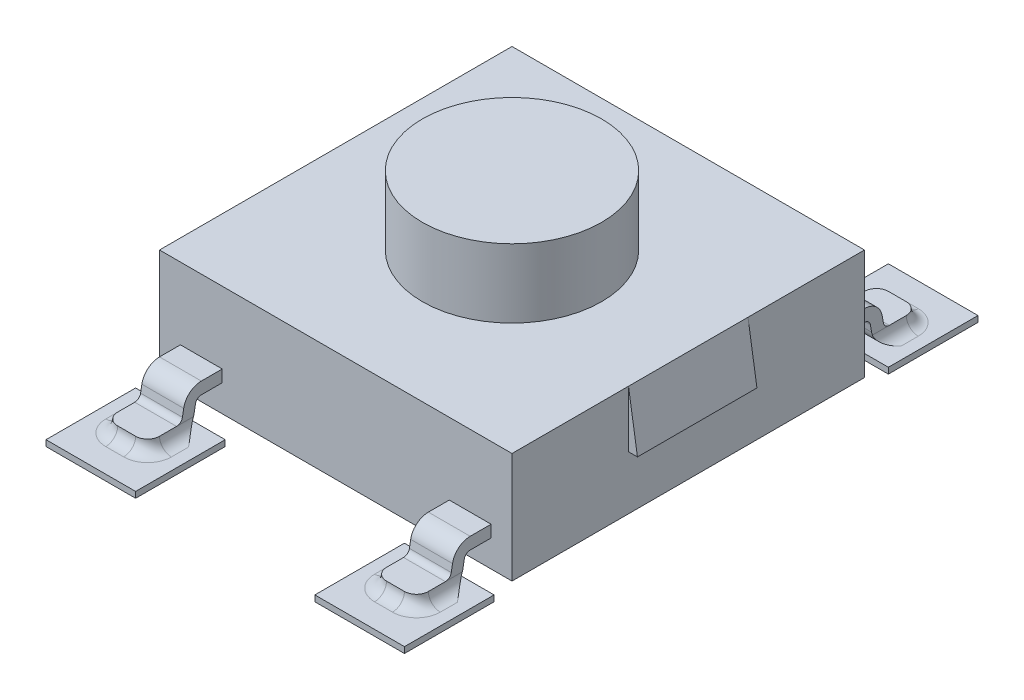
ISO-10303-21;
HEADER;
FILE_DESCRIPTION(('STEP AP214'),'2;1');
FILE_NAME('part.step','',(''),(''),'','','');
FILE_SCHEMA(('AUTOMOTIVE_DESIGN { 1 0 10303 214 1 1 1 1 }'));
ENDSEC;
DATA;
#1=APPLICATION_CONTEXT('core data for automotive mechanical design processes');
#2=APPLICATION_PROTOCOL_DEFINITION('international standard','automotive_design',2000,#1);
#3=PRODUCT_CONTEXT('',#1,'mechanical');
#4=PRODUCT('Part','Part','',(#3));
#5=PRODUCT_RELATED_PRODUCT_CATEGORY('part','',(#4));
#6=PRODUCT_DEFINITION_FORMATION('','',#4);
#7=PRODUCT_DEFINITION_CONTEXT('part definition',#1,'design');
#8=PRODUCT_DEFINITION('design','',#6,#7);
#9=PRODUCT_DEFINITION_SHAPE('','',#8);
#10=(LENGTH_UNIT() NAMED_UNIT(*) SI_UNIT(.MILLI.,.METRE.));
#11=(NAMED_UNIT(*) PLANE_ANGLE_UNIT() SI_UNIT($,.RADIAN.));
#12=(NAMED_UNIT(*) SI_UNIT($,.STERADIAN.) SOLID_ANGLE_UNIT());
#13=UNCERTAINTY_MEASURE_WITH_UNIT(LENGTH_MEASURE(1.E-05),#10,'distance_accuracy_value','');
#14=(GEOMETRIC_REPRESENTATION_CONTEXT(3) GLOBAL_UNCERTAINTY_ASSIGNED_CONTEXT((#13)) GLOBAL_UNIT_ASSIGNED_CONTEXT((#10,
#11,#12)) REPRESENTATION_CONTEXT('',''));
#15=CARTESIAN_POINT('',(0.,0.,0.));
#16=DIRECTION('',(0.,0.,1.));
#17=DIRECTION('',(1.,0.,0.));
#18=AXIS2_PLACEMENT_3D('',#15,#16,#17);
#19=CARTESIAN_POINT('',(0.,0.,0.));
#20=DIRECTION('',(0.,1.,0.));
#21=DIRECTION('',(0.,0.,1.));
#22=AXIS2_PLACEMENT_3D('',#19,#20,#21);
#23=PLANE('',#22);
#24=DIRECTION('',(0.,0.,-1.));
#25=VECTOR('',#24,1.);
#26=CARTESIAN_POINT('',(0.75,0.,-4.8));
#27=LINE('',#26,#25);
#28=CARTESIAN_POINT('',(0.75,0.,-4.8));
#29=VERTEX_POINT('',#28);
#30=CARTESIAN_POINT('',(0.75,0.,-3.3));
#31=VERTEX_POINT('',#30);
#32=EDGE_CURVE('P0_E67',#29,#31,#27,.F.);
#33=ORIENTED_EDGE('',*,*,#32,.F.);
#34=DIRECTION('',(-1.,0.,0.));
#35=VECTOR('',#34,1.);
#36=CARTESIAN_POINT('',(-0.75,0.,-4.8));
#37=LINE('',#36,#35);
#38=CARTESIAN_POINT('',(-0.75,0.,-4.8));
#39=VERTEX_POINT('',#38);
#40=EDGE_CURVE('P0_E76',#39,#29,#37,.F.);
#41=ORIENTED_EDGE('',*,*,#40,.F.);
#42=DIRECTION('',(0.,0.,1.));
#43=VECTOR('',#42,1.);
#44=CARTESIAN_POINT('',(-0.75,0.,-4.8));
#45=LINE('',#44,#43);
#46=CARTESIAN_POINT('',(-0.749999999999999,0.,-3.3));
#47=VERTEX_POINT('',#46);
#48=EDGE_CURVE('P0_E51',#47,#39,#45,.F.);
#49=ORIENTED_EDGE('',*,*,#48,.F.);
#50=DIRECTION('',(1.,0.,0.));
#51=VECTOR('',#50,1.);
#52=CARTESIAN_POINT('',(-0.749999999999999,0.,-3.3));
#53=LINE('',#52,#51);
#54=EDGE_CURVE('P0_E58',#31,#47,#53,.F.);
#55=ORIENTED_EDGE('',*,*,#54,.F.);
#56=EDGE_LOOP('',(#33,#41,#49,#55));
#57=FACE_BOUND('',#56,.T.);
#58=ADVANCED_FACE('P0_F16',(#57),#23,.T.);
#59=CARTESIAN_POINT('',(-0.749999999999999,-0.1,-3.3));
#60=DIRECTION('',(0.,0.,1.));
#61=DIRECTION('',(1.,0.,0.));
#62=AXIS2_PLACEMENT_3D('',#59,#60,#61);
#63=PLANE('',#62);
#64=DIRECTION('',(1.,0.,0.));
#65=VECTOR('',#64,1.);
#66=CARTESIAN_POINT('',(0.,-0.1,-3.3));
#67=LINE('',#66,#65);
#68=CARTESIAN_POINT('',(-0.749999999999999,-0.1,-3.3));
#69=VERTEX_POINT('',#68);
#70=CARTESIAN_POINT('',(0.75,-0.1,-3.3));
#71=VERTEX_POINT('',#70);
#72=EDGE_CURVE('P0_E20',#69,#71,#67,.T.);
#73=ORIENTED_EDGE('',*,*,#72,.T.);
#74=DIRECTION('',(0.,1.,0.));
#75=VECTOR('',#74,1.);
#76=CARTESIAN_POINT('',(0.75,-0.1,-3.3));
#77=LINE('',#76,#75);
#78=EDGE_CURVE('P0_E70',#31,#71,#77,.F.);
#79=ORIENTED_EDGE('',*,*,#78,.F.);
#80=ORIENTED_EDGE('',*,*,#54,.T.);
#81=DIRECTION('',(0.,1.,0.));
#82=VECTOR('',#81,1.);
#83=CARTESIAN_POINT('',(-0.749999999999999,-0.1,-3.3));
#84=LINE('',#83,#82);
#85=EDGE_CURVE('P0_E81',#69,#47,#84,.T.);
#86=ORIENTED_EDGE('',*,*,#85,.F.);
#87=EDGE_LOOP('',(#73,#79,#80,#86));
#88=FACE_BOUND('',#87,.T.);
#89=ADVANCED_FACE('P0_F75',(#88),#63,.T.);
#90=CARTESIAN_POINT('',(0.75,-0.1,-4.8));
#91=DIRECTION('',(1.,0.,0.));
#92=DIRECTION('',(0.,0.,-1.));
#93=AXIS2_PLACEMENT_3D('',#90,#91,#92);
#94=PLANE('',#93);
#95=DIRECTION('',(0.,0.,1.));
#96=VECTOR('',#95,1.);
#97=CARTESIAN_POINT('',(0.75,-0.1,0.));
#98=LINE('',#97,#96);
#99=CARTESIAN_POINT('',(0.75,-0.1,-4.8));
#100=VERTEX_POINT('',#99);
#101=EDGE_CURVE('P0_E86',#71,#100,#98,.F.);
#102=ORIENTED_EDGE('',*,*,#101,.T.);
#103=DIRECTION('',(0.,1.,0.));
#104=VECTOR('',#103,1.);
#105=CARTESIAN_POINT('',(0.75,-0.1,-4.8));
#106=LINE('',#105,#104);
#107=EDGE_CURVE('P0_E71',#29,#100,#106,.F.);
#108=ORIENTED_EDGE('',*,*,#107,.F.);
#109=ORIENTED_EDGE('',*,*,#32,.T.);
#110=ORIENTED_EDGE('',*,*,#78,.T.);
#111=EDGE_LOOP('',(#102,#108,#109,#110));
#112=FACE_BOUND('',#111,.T.);
#113=ADVANCED_FACE('P0_F69',(#112),#94,.T.);
#114=CARTESIAN_POINT('',(-0.75,-0.1,-4.8));
#115=DIRECTION('',(0.,0.,-1.));
#116=DIRECTION('',(-1.,0.,0.));
#117=AXIS2_PLACEMENT_3D('',#114,#115,#116);
#118=PLANE('',#117);
#119=DIRECTION('',(1.,0.,0.));
#120=VECTOR('',#119,1.);
#121=CARTESIAN_POINT('',(0.,-0.1,-4.8));
#122=LINE('',#121,#120);
#123=CARTESIAN_POINT('',(-0.75,-0.1,-4.8));
#124=VERTEX_POINT('',#123);
#125=EDGE_CURVE('P0_E26',#100,#124,#122,.F.);
#126=ORIENTED_EDGE('',*,*,#125,.T.);
#127=DIRECTION('',(0.,1.,0.));
#128=VECTOR('',#127,1.);
#129=CARTESIAN_POINT('',(-0.75,-0.1,-4.8));
#130=LINE('',#129,#128);
#131=EDGE_CURVE('P0_E34',#39,#124,#130,.F.);
#132=ORIENTED_EDGE('',*,*,#131,.F.);
#133=ORIENTED_EDGE('',*,*,#40,.T.);
#134=ORIENTED_EDGE('',*,*,#107,.T.);
#135=EDGE_LOOP('',(#126,#132,#133,#134));
#136=FACE_BOUND('',#135,.T.);
#137=ADVANCED_FACE('P0_F89',(#136),#118,.T.);
#138=CARTESIAN_POINT('',(-0.75,-0.1,-4.8));
#139=DIRECTION('',(-1.,0.,0.));
#140=DIRECTION('',(0.,0.,1.));
#141=AXIS2_PLACEMENT_3D('',#138,#139,#140);
#142=PLANE('',#141);
#143=DIRECTION('',(0.,0.,1.));
#144=VECTOR('',#143,1.);
#145=CARTESIAN_POINT('',(-0.75,-0.1,0.));
#146=LINE('',#145,#144);
#147=EDGE_CURVE('P0_E11',#124,#69,#146,.T.);
#148=ORIENTED_EDGE('',*,*,#147,.T.);
#149=ORIENTED_EDGE('',*,*,#85,.T.);
#150=ORIENTED_EDGE('',*,*,#48,.T.);
#151=ORIENTED_EDGE('',*,*,#131,.T.);
#152=EDGE_LOOP('',(#148,#149,#150,#151));
#153=FACE_BOUND('',#152,.T.);
#154=ADVANCED_FACE('P0_F91',(#153),#142,.T.);
#155=CARTESIAN_POINT('',(0.,-0.1,0.));
#156=DIRECTION('',(0.,1.,0.));
#157=DIRECTION('',(0.,0.,1.));
#158=AXIS2_PLACEMENT_3D('',#155,#156,#157);
#159=PLANE('',#158);
#160=ORIENTED_EDGE('',*,*,#125,.F.);
#161=ORIENTED_EDGE('',*,*,#101,.F.);
#162=ORIENTED_EDGE('',*,*,#72,.F.);
#163=ORIENTED_EDGE('',*,*,#147,.F.);
#164=EDGE_LOOP('',(#160,#161,#162,#163));
#165=FACE_BOUND('',#164,.T.);
#166=ADVANCED_FACE('P0_F18',(#165),#159,.F.);
#167=CLOSED_SHELL('',(#58,#89,#113,#137,#154,#166));
#168=MANIFOLD_SOLID_BREP('P0_B1',#167);
#169=CARTESIAN_POINT('',(0.,-0.1,0.));
#170=DIRECTION('',(0.,1.,0.));
#171=DIRECTION('',(0.,0.,1.));
#172=AXIS2_PLACEMENT_3D('',#169,#170,#171);
#173=PLANE('',#172);
#174=DIRECTION('',(-1.,0.,0.));
#175=VECTOR('',#174,1.);
#176=CARTESIAN_POINT('',(-3.,-0.1,-4.8));
#177=LINE('',#176,#175);
#178=CARTESIAN_POINT('',(-1.5,-0.1,-4.8));
#179=VERTEX_POINT('',#178);
#180=CARTESIAN_POINT('',(-3.,-0.1,-4.8));
#181=VERTEX_POINT('',#180);
#182=EDGE_CURVE('P1_E1750',#179,#181,#177,.T.);
#183=ORIENTED_EDGE('',*,*,#182,.F.);
#184=DIRECTION('',(0.,0.,-1.));
#185=VECTOR('',#184,1.);
#186=CARTESIAN_POINT('',(-1.5,-0.1,-4.8));
#187=LINE('',#186,#185);
#188=CARTESIAN_POINT('',(-1.5,-0.1,-3.3));
#189=VERTEX_POINT('',#188);
#190=EDGE_CURVE('P1_E1751',#189,#179,#187,.T.);
#191=ORIENTED_EDGE('',*,*,#190,.F.);
#192=DIRECTION('',(1.,0.,0.));
#193=VECTOR('',#192,1.);
#194=CARTESIAN_POINT('',(-3.,-0.1,-3.3));
#195=LINE('',#194,#193);
#196=CARTESIAN_POINT('',(-3.,-0.1,-3.3));
#197=VERTEX_POINT('',#196);
#198=EDGE_CURVE('P1_E1759',#197,#189,#195,.T.);
#199=ORIENTED_EDGE('',*,*,#198,.F.);
#200=DIRECTION('',(0.,0.,1.));
#201=VECTOR('',#200,1.);
#202=CARTESIAN_POINT('',(-3.,-0.1,-4.8));
#203=LINE('',#202,#201);
#204=EDGE_CURVE('P1_E1765',#181,#197,#203,.T.);
#205=ORIENTED_EDGE('',*,*,#204,.F.);
#206=EDGE_LOOP('',(#183,#191,#199,#205));
#207=FACE_BOUND('',#206,.T.);
#208=ADVANCED_FACE('P1_F15',(#207),#173,.F.);
#209=CARTESIAN_POINT('',(0.,-0.1,0.));
#210=DIRECTION('',(0.,1.,0.));
#211=DIRECTION('',(0.,0.,1.));
#212=AXIS2_PLACEMENT_3D('',#209,#210,#211);
#213=PLANE('',#212);
#214=DIRECTION('',(-1.,0.,0.));
#215=VECTOR('',#214,1.);
#216=CARTESIAN_POINT('',(1.5,-0.1,-4.8));
#217=LINE('',#216,#215);
#218=CARTESIAN_POINT('',(3.,-0.1,-4.8));
#219=VERTEX_POINT('',#218);
#220=CARTESIAN_POINT('',(1.5,-0.1,-4.8));
#221=VERTEX_POINT('',#220);
#222=EDGE_CURVE('P1_E1726',#219,#221,#217,.T.);
#223=ORIENTED_EDGE('',*,*,#222,.F.);
#224=DIRECTION('',(0.,0.,-1.));
#225=VECTOR('',#224,1.);
#226=CARTESIAN_POINT('',(3.,-0.1,-4.8));
#227=LINE('',#226,#225);
#228=CARTESIAN_POINT('',(3.,-0.1,-3.3));
#229=VERTEX_POINT('',#228);
#230=EDGE_CURVE('P1_E1727',#229,#219,#227,.T.);
#231=ORIENTED_EDGE('',*,*,#230,.F.);
#232=DIRECTION('',(1.,0.,0.));
#233=VECTOR('',#232,1.);
#234=CARTESIAN_POINT('',(1.5,-0.1,-3.3));
#235=LINE('',#234,#233);
#236=CARTESIAN_POINT('',(1.5,-0.1,-3.3));
#237=VERTEX_POINT('',#236);
#238=EDGE_CURVE('P1_E1735',#237,#229,#235,.T.);
#239=ORIENTED_EDGE('',*,*,#238,.F.);
#240=DIRECTION('',(0.,0.,1.));
#241=VECTOR('',#240,1.);
#242=CARTESIAN_POINT('',(1.5,-0.1,-4.8));
#243=LINE('',#242,#241);
#244=EDGE_CURVE('P1_E1741',#221,#237,#243,.T.);
#245=ORIENTED_EDGE('',*,*,#244,.F.);
#246=EDGE_LOOP('',(#223,#231,#239,#245));
#247=FACE_BOUND('',#246,.T.);
#248=ADVANCED_FACE('P1_F2569',(#247),#213,.F.);
#249=CARTESIAN_POINT('',(0.,-0.1,0.));
#250=DIRECTION('',(0.,1.,0.));
#251=DIRECTION('',(0.,0.,1.));
#252=AXIS2_PLACEMENT_3D('',#249,#250,#251);
#253=PLANE('',#252);
#254=DIRECTION('',(-1.,0.,0.));
#255=VECTOR('',#254,1.);
#256=CARTESIAN_POINT('',(-3.,-0.1,3.3));
#257=LINE('',#256,#255);
#258=CARTESIAN_POINT('',(-1.5,-0.1,3.3));
#259=VERTEX_POINT('',#258);
#260=CARTESIAN_POINT('',(-3.,-0.1,3.3));
#261=VERTEX_POINT('',#260);
#262=EDGE_CURVE('P1_E1702',#259,#261,#257,.T.);
#263=ORIENTED_EDGE('',*,*,#262,.F.);
#264=DIRECTION('',(0.,0.,-1.));
#265=VECTOR('',#264,1.);
#266=CARTESIAN_POINT('',(-1.5,-0.1,3.3));
#267=LINE('',#266,#265);
#268=CARTESIAN_POINT('',(-1.5,-0.1,4.8));
#269=VERTEX_POINT('',#268);
#270=EDGE_CURVE('P1_E1703',#269,#259,#267,.T.);
#271=ORIENTED_EDGE('',*,*,#270,.F.);
#272=DIRECTION('',(1.,0.,0.));
#273=VECTOR('',#272,1.);
#274=CARTESIAN_POINT('',(-3.,-0.1,4.8));
#275=LINE('',#274,#273);
#276=CARTESIAN_POINT('',(-3.,-0.1,4.8));
#277=VERTEX_POINT('',#276);
#278=EDGE_CURVE('P1_E1711',#277,#269,#275,.T.);
#279=ORIENTED_EDGE('',*,*,#278,.F.);
#280=DIRECTION('',(0.,0.,1.));
#281=VECTOR('',#280,1.);
#282=CARTESIAN_POINT('',(-3.,-0.1,3.3));
#283=LINE('',#282,#281);
#284=EDGE_CURVE('P1_E1717',#261,#277,#283,.T.);
#285=ORIENTED_EDGE('',*,*,#284,.F.);
#286=EDGE_LOOP('',(#263,#271,#279,#285));
#287=FACE_BOUND('',#286,.T.);
#288=ADVANCED_FACE('P1_F2561',(#287),#253,.F.);
#289=CARTESIAN_POINT('',(0.,-0.1,0.));
#290=DIRECTION('',(0.,1.,0.));
#291=DIRECTION('',(0.,0.,1.));
#292=AXIS2_PLACEMENT_3D('',#289,#290,#291);
#293=PLANE('',#292);
#294=DIRECTION('',(-1.,0.,0.));
#295=VECTOR('',#294,1.);
#296=CARTESIAN_POINT('',(1.5,-0.1,3.3));
#297=LINE('',#296,#295);
#298=CARTESIAN_POINT('',(3.,-0.1,3.3));
#299=VERTEX_POINT('',#298);
#300=CARTESIAN_POINT('',(1.5,-0.1,3.3));
#301=VERTEX_POINT('',#300);
#302=EDGE_CURVE('P1_E1675',#299,#301,#297,.T.);
#303=ORIENTED_EDGE('',*,*,#302,.F.);
#304=DIRECTION('',(0.,0.,-1.));
#305=VECTOR('',#304,1.);
#306=CARTESIAN_POINT('',(3.,-0.1,3.3));
#307=LINE('',#306,#305);
#308=CARTESIAN_POINT('',(3.,-0.1,4.8));
#309=VERTEX_POINT('',#308);
#310=EDGE_CURVE('P1_E1686',#309,#299,#307,.T.);
#311=ORIENTED_EDGE('',*,*,#310,.F.);
#312=DIRECTION('',(1.,0.,0.));
#313=VECTOR('',#312,1.);
#314=CARTESIAN_POINT('',(1.5,-0.1,4.8));
#315=LINE('',#314,#313);
#316=CARTESIAN_POINT('',(1.5,-0.1,4.8));
#317=VERTEX_POINT('',#316);
#318=EDGE_CURVE('P1_E1687',#317,#309,#315,.T.);
#319=ORIENTED_EDGE('',*,*,#318,.F.);
#320=DIRECTION('',(0.,0.,1.));
#321=VECTOR('',#320,1.);
#322=CARTESIAN_POINT('',(1.5,-0.1,3.3));
#323=LINE('',#322,#321);
#324=EDGE_CURVE('P1_E1693',#301,#317,#323,.T.);
#325=ORIENTED_EDGE('',*,*,#324,.F.);
#326=EDGE_LOOP('',(#303,#311,#319,#325));
#327=FACE_BOUND('',#326,.T.);
#328=ADVANCED_FACE('P1_F2554',(#327),#293,.F.);
#329=CARTESIAN_POINT('',(-3.,-0.1,-4.8));
#330=DIRECTION('',(-1.,0.,0.));
#331=DIRECTION('',(0.,0.,1.));
#332=AXIS2_PLACEMENT_3D('',#329,#330,#331);
#333=PLANE('',#332);
#334=ORIENTED_EDGE('',*,*,#204,.T.);
#335=DIRECTION('',(0.,1.,0.));
#336=VECTOR('',#335,1.);
#337=CARTESIAN_POINT('',(-3.,-0.1,-3.3));
#338=LINE('',#337,#336);
#339=CARTESIAN_POINT('',(-3.,0.,-3.3));
#340=VERTEX_POINT('',#339);
#341=EDGE_CURVE('P1_E1762',#340,#197,#338,.F.);
#342=ORIENTED_EDGE('',*,*,#341,.F.);
#343=DIRECTION('',(0.,0.,1.));
#344=VECTOR('',#343,1.);
#345=CARTESIAN_POINT('',(-3.,0.,0.));
#346=LINE('',#345,#344);
#347=CARTESIAN_POINT('',(-3.,0.,-4.8));
#348=VERTEX_POINT('',#347);
#349=EDGE_CURVE('P1_E1588',#348,#340,#346,.T.);
#350=ORIENTED_EDGE('',*,*,#349,.F.);
#351=DIRECTION('',(0.,1.,0.));
#352=VECTOR('',#351,1.);
#353=CARTESIAN_POINT('',(-3.,-0.1,-4.8));
#354=LINE('',#353,#352);
#355=EDGE_CURVE('P1_E1746',#181,#348,#354,.T.);
#356=ORIENTED_EDGE('',*,*,#355,.F.);
#357=EDGE_LOOP('',(#334,#342,#350,#356));
#358=FACE_BOUND('',#357,.T.);
#359=ADVANCED_FACE('P1_F1774',(#358),#333,.T.);
#360=CARTESIAN_POINT('',(-3.,-0.1,-3.3));
#361=DIRECTION('',(0.,0.,1.));
#362=DIRECTION('',(1.,0.,0.));
#363=AXIS2_PLACEMENT_3D('',#360,#361,#362);
#364=PLANE('',#363);
#365=ORIENTED_EDGE('',*,*,#198,.T.);
#366=DIRECTION('',(0.,1.,0.));
#367=VECTOR('',#366,1.);
#368=CARTESIAN_POINT('',(-1.5,-0.1,-3.3));
#369=LINE('',#368,#367);
#370=CARTESIAN_POINT('',(-1.5,0.,-3.3));
#371=VERTEX_POINT('',#370);
#372=EDGE_CURVE('P1_E1756',#371,#189,#369,.F.);
#373=ORIENTED_EDGE('',*,*,#372,.F.);
#374=DIRECTION('',(1.,0.,0.));
#375=VECTOR('',#374,1.);
#376=CARTESIAN_POINT('',(0.,0.,-3.3));
#377=LINE('',#376,#375);
#378=EDGE_CURVE('P1_E1585',#340,#371,#377,.T.);
#379=ORIENTED_EDGE('',*,*,#378,.F.);
#380=ORIENTED_EDGE('',*,*,#341,.T.);
#381=EDGE_LOOP('',(#365,#373,#379,#380));
#382=FACE_BOUND('',#381,.T.);
#383=ADVANCED_FACE('P1_F1785',(#382),#364,.T.);
#384=CARTESIAN_POINT('',(-1.5,-0.1,-4.8));
#385=DIRECTION('',(1.,0.,0.));
#386=DIRECTION('',(0.,0.,-1.));
#387=AXIS2_PLACEMENT_3D('',#384,#385,#386);
#388=PLANE('',#387);
#389=ORIENTED_EDGE('',*,*,#190,.T.);
#390=DIRECTION('',(0.,1.,0.));
#391=VECTOR('',#390,1.);
#392=CARTESIAN_POINT('',(-1.5,-0.1,-4.8));
#393=LINE('',#392,#391);
#394=CARTESIAN_POINT('',(-1.5,0.,-4.8));
#395=VERTEX_POINT('',#394);
#396=EDGE_CURVE('P1_E1747',#395,#179,#393,.F.);
#397=ORIENTED_EDGE('',*,*,#396,.F.);
#398=DIRECTION('',(0.,0.,1.));
#399=VECTOR('',#398,1.);
#400=CARTESIAN_POINT('',(-1.5,0.,0.));
#401=LINE('',#400,#399);
#402=EDGE_CURVE('P1_E1582',#371,#395,#401,.F.);
#403=ORIENTED_EDGE('',*,*,#402,.F.);
#404=ORIENTED_EDGE('',*,*,#372,.T.);
#405=EDGE_LOOP('',(#389,#397,#403,#404));
#406=FACE_BOUND('',#405,.T.);
#407=ADVANCED_FACE('P1_F1792',(#406),#388,.T.);
#408=CARTESIAN_POINT('',(-3.,-0.1,-4.8));
#409=DIRECTION('',(0.,0.,-1.));
#410=DIRECTION('',(-1.,0.,0.));
#411=AXIS2_PLACEMENT_3D('',#408,#409,#410);
#412=PLANE('',#411);
#413=ORIENTED_EDGE('',*,*,#182,.T.);
#414=ORIENTED_EDGE('',*,*,#355,.T.);
#415=DIRECTION('',(1.,0.,0.));
#416=VECTOR('',#415,1.);
#417=CARTESIAN_POINT('',(0.,0.,-4.8));
#418=LINE('',#417,#416);
#419=EDGE_CURVE('P1_E1579',#395,#348,#418,.F.);
#420=ORIENTED_EDGE('',*,*,#419,.F.);
#421=ORIENTED_EDGE('',*,*,#396,.T.);
#422=EDGE_LOOP('',(#413,#414,#420,#421));
#423=FACE_BOUND('',#422,.T.);
#424=ADVANCED_FACE('P1_F1797',(#423),#412,.T.);
#425=CARTESIAN_POINT('',(-1.9,0.2,-4.4));
#426=DIRECTION('',(1.,0.,0.));
#427=DIRECTION('',(0.,0.,-1.));
#428=AXIS2_PLACEMENT_3D('',#425,#426,#427);
#429=CYLINDRICAL_SURFACE('',#428,0.2);
#430=DIRECTION('',(1.,0.,0.));
#431=VECTOR('',#430,1.);
#432=CARTESIAN_POINT('',(-1.9,0.2,-4.2));
#433=LINE('',#432,#431);
#434=CARTESIAN_POINT('',(-2.1,0.2,-4.2));
#435=VERTEX_POINT('',#434);
#436=CARTESIAN_POINT('',(-2.4,0.2,-4.2));
#437=VERTEX_POINT('',#436);
#438=EDGE_CURVE('P1_E1612',#435,#437,#433,.F.);
#439=ORIENTED_EDGE('',*,*,#438,.F.);
#440=CARTESIAN_POINT('',(-2.1,0.2,-4.4));
#441=DIRECTION('',(-1.,0.,0.));
#442=DIRECTION('',(0.,0.,-1.));
#443=AXIS2_PLACEMENT_3D('',#440,#441,#442);
#444=CIRCLE('',#443,0.2);
#445=CARTESIAN_POINT('',(-2.1,0.,-4.4));
#446=VERTEX_POINT('',#445);
#447=EDGE_CURVE('P1_E1591',#435,#446,#444,.F.);
#448=ORIENTED_EDGE('',*,*,#447,.T.);
#449=DIRECTION('',(1.,0.,0.));
#450=VECTOR('',#449,1.);
#451=CARTESIAN_POINT('',(0.,0.,-4.4));
#452=LINE('',#451,#450);
#453=CARTESIAN_POINT('',(-2.4,0.,-4.4));
#454=VERTEX_POINT('',#453);
#455=EDGE_CURVE('P1_E1569',#454,#446,#452,.T.);
#456=ORIENTED_EDGE('',*,*,#455,.F.);
#457=CARTESIAN_POINT('',(-2.4,0.2,-4.4));
#458=DIRECTION('',(-1.,0.,0.));
#459=DIRECTION('',(0.,0.,-1.));
#460=AXIS2_PLACEMENT_3D('',#457,#458,#459);
#461=CIRCLE('',#460,0.2);
#462=EDGE_CURVE('P1_E1652',#454,#437,#461,.T.);
#463=ORIENTED_EDGE('',*,*,#462,.T.);
#464=EDGE_LOOP('',(#439,#448,#456,#463));
#465=FACE_BOUND('',#464,.T.);
#466=ADVANCED_FACE('P1_F2522',(#465),#429,.F.);
#467=CARTESIAN_POINT('',(1.5,-0.1,-4.8));
#468=DIRECTION('',(-1.,0.,0.));
#469=DIRECTION('',(0.,0.,1.));
#470=AXIS2_PLACEMENT_3D('',#467,#468,#469);
#471=PLANE('',#470);
#472=ORIENTED_EDGE('',*,*,#244,.T.);
#473=DIRECTION('',(0.,1.,0.));
#474=VECTOR('',#473,1.);
#475=CARTESIAN_POINT('',(1.5,-0.1,-3.3));
#476=LINE('',#475,#474);
#477=CARTESIAN_POINT('',(1.5,0.,-3.3));
#478=VERTEX_POINT('',#477);
#479=EDGE_CURVE('P1_E1738',#478,#237,#476,.F.);
#480=ORIENTED_EDGE('',*,*,#479,.F.);
#481=DIRECTION('',(0.,0.,1.));
#482=VECTOR('',#481,1.);
#483=CARTESIAN_POINT('',(1.5,0.,0.));
#484=LINE('',#483,#482);
#485=CARTESIAN_POINT('',(1.5,0.,-4.8));
#486=VERTEX_POINT('',#485);
#487=EDGE_CURVE('P1_E1124',#486,#478,#484,.T.);
#488=ORIENTED_EDGE('',*,*,#487,.F.);
#489=DIRECTION('',(0.,1.,0.));
#490=VECTOR('',#489,1.);
#491=CARTESIAN_POINT('',(1.5,-0.1,-4.8));
#492=LINE('',#491,#490);
#493=EDGE_CURVE('P1_E1722',#221,#486,#492,.T.);
#494=ORIENTED_EDGE('',*,*,#493,.F.);
#495=EDGE_LOOP('',(#472,#480,#488,#494));
#496=FACE_BOUND('',#495,.T.);
#497=ADVANCED_FACE('P1_F2514',(#496),#471,.T.);
#498=CARTESIAN_POINT('',(1.5,-0.1,-3.3));
#499=DIRECTION('',(0.,0.,1.));
#500=DIRECTION('',(1.,0.,0.));
#501=AXIS2_PLACEMENT_3D('',#498,#499,#500);
#502=PLANE('',#501);
#503=ORIENTED_EDGE('',*,*,#238,.T.);
#504=DIRECTION('',(0.,1.,0.));
#505=VECTOR('',#504,1.);
#506=CARTESIAN_POINT('',(3.,-0.1,-3.3));
#507=LINE('',#506,#505);
#508=CARTESIAN_POINT('',(3.,0.,-3.3));
#509=VERTEX_POINT('',#508);
#510=EDGE_CURVE('P1_E1732',#509,#229,#507,.F.);
#511=ORIENTED_EDGE('',*,*,#510,.F.);
#512=DIRECTION('',(1.,0.,0.));
#513=VECTOR('',#512,1.);
#514=CARTESIAN_POINT('',(0.,0.,-3.3));
#515=LINE('',#514,#513);
#516=EDGE_CURVE('P1_E1121',#478,#509,#515,.T.);
#517=ORIENTED_EDGE('',*,*,#516,.F.);
#518=ORIENTED_EDGE('',*,*,#479,.T.);
#519=EDGE_LOOP('',(#503,#511,#517,#518));
#520=FACE_BOUND('',#519,.T.);
#521=ADVANCED_FACE('P1_F2506',(#520),#502,.T.);
#522=CARTESIAN_POINT('',(3.,-0.1,-4.8));
#523=DIRECTION('',(1.,0.,0.));
#524=DIRECTION('',(0.,0.,-1.));
#525=AXIS2_PLACEMENT_3D('',#522,#523,#524);
#526=PLANE('',#525);
#527=ORIENTED_EDGE('',*,*,#230,.T.);
#528=DIRECTION('',(0.,1.,0.));
#529=VECTOR('',#528,1.);
#530=CARTESIAN_POINT('',(3.,-0.1,-4.8));
#531=LINE('',#530,#529);
#532=CARTESIAN_POINT('',(3.,0.,-4.8));
#533=VERTEX_POINT('',#532);
#534=EDGE_CURVE('P1_E1723',#533,#219,#531,.F.);
#535=ORIENTED_EDGE('',*,*,#534,.F.);
#536=DIRECTION('',(0.,0.,1.));
#537=VECTOR('',#536,1.);
#538=CARTESIAN_POINT('',(3.,0.,0.));
#539=LINE('',#538,#537);
#540=EDGE_CURVE('P1_E1118',#509,#533,#539,.F.);
#541=ORIENTED_EDGE('',*,*,#540,.F.);
#542=ORIENTED_EDGE('',*,*,#510,.T.);
#543=EDGE_LOOP('',(#527,#535,#541,#542));
#544=FACE_BOUND('',#543,.T.);
#545=ADVANCED_FACE('P1_F2498',(#544),#526,.T.);
#546=CARTESIAN_POINT('',(1.5,-0.1,-4.8));
#547=DIRECTION('',(0.,0.,-1.));
#548=DIRECTION('',(-1.,0.,0.));
#549=AXIS2_PLACEMENT_3D('',#546,#547,#548);
#550=PLANE('',#549);
#551=ORIENTED_EDGE('',*,*,#222,.T.);
#552=ORIENTED_EDGE('',*,*,#493,.T.);
#553=DIRECTION('',(1.,0.,0.));
#554=VECTOR('',#553,1.);
#555=CARTESIAN_POINT('',(0.,0.,-4.8));
#556=LINE('',#555,#554);
#557=EDGE_CURVE('P1_E1109',#533,#486,#556,.F.);
#558=ORIENTED_EDGE('',*,*,#557,.F.);
#559=ORIENTED_EDGE('',*,*,#534,.T.);
#560=EDGE_LOOP('',(#551,#552,#558,#559));
#561=FACE_BOUND('',#560,.T.);
#562=ADVANCED_FACE('P1_F2490',(#561),#550,.T.);
#563=CARTESIAN_POINT('',(2.6,0.2,-4.4));
#564=DIRECTION('',(1.,0.,0.));
#565=DIRECTION('',(0.,0.,-1.));
#566=AXIS2_PLACEMENT_3D('',#563,#564,#565);
#567=CYLINDRICAL_SURFACE('',#566,0.2);
#568=DIRECTION('',(1.,0.,0.));
#569=VECTOR('',#568,1.);
#570=CARTESIAN_POINT('',(0.,0.,-4.4));
#571=LINE('',#570,#569);
#572=CARTESIAN_POINT('',(2.1,0.,-4.4));
#573=VERTEX_POINT('',#572);
#574=CARTESIAN_POINT('',(2.4,0.,-4.4));
#575=VERTEX_POINT('',#574);
#576=EDGE_CURVE('P1_E1127',#573,#575,#571,.T.);
#577=ORIENTED_EDGE('',*,*,#576,.F.);
#578=CARTESIAN_POINT('',(2.1,0.2,-4.4));
#579=DIRECTION('',(-1.,0.,0.));
#580=DIRECTION('',(0.,0.,-1.));
#581=AXIS2_PLACEMENT_3D('',#578,#579,#580);
#582=CIRCLE('',#581,0.2);
#583=CARTESIAN_POINT('',(2.1,0.2,-4.2));
#584=VERTEX_POINT('',#583);
#585=EDGE_CURVE('P1_E1637',#573,#584,#582,.T.);
#586=ORIENTED_EDGE('',*,*,#585,.T.);
#587=DIRECTION('',(1.,0.,0.));
#588=VECTOR('',#587,1.);
#589=CARTESIAN_POINT('',(2.6,0.2,-4.2));
#590=LINE('',#589,#588);
#591=CARTESIAN_POINT('',(2.4,0.2,-4.2));
#592=VERTEX_POINT('',#591);
#593=EDGE_CURVE('P1_E1117',#592,#584,#590,.F.);
#594=ORIENTED_EDGE('',*,*,#593,.F.);
#595=CARTESIAN_POINT('',(2.4,0.2,-4.4));
#596=DIRECTION('',(-1.,0.,0.));
#597=DIRECTION('',(0.,0.,-1.));
#598=AXIS2_PLACEMENT_3D('',#595,#596,#597);
#599=CIRCLE('',#598,0.2);
#600=EDGE_CURVE('P1_E1064',#592,#575,#599,.F.);
#601=ORIENTED_EDGE('',*,*,#600,.T.);
#602=EDGE_LOOP('',(#577,#586,#594,#601));
#603=FACE_BOUND('',#602,.T.);
#604=ADVANCED_FACE('P1_F2482',(#603),#567,.F.);
#605=CARTESIAN_POINT('',(-3.,-0.1,3.3));
#606=DIRECTION('',(-1.,0.,0.));
#607=DIRECTION('',(0.,0.,1.));
#608=AXIS2_PLACEMENT_3D('',#605,#606,#607);
#609=PLANE('',#608);
#610=ORIENTED_EDGE('',*,*,#284,.T.);
#611=DIRECTION('',(0.,1.,0.));
#612=VECTOR('',#611,1.);
#613=CARTESIAN_POINT('',(-3.,-0.1,4.8));
#614=LINE('',#613,#612);
#615=CARTESIAN_POINT('',(-3.,0.,4.8));
#616=VERTEX_POINT('',#615);
#617=EDGE_CURVE('P1_E1714',#616,#277,#614,.F.);
#618=ORIENTED_EDGE('',*,*,#617,.F.);
#619=DIRECTION('',(0.,0.,1.));
#620=VECTOR('',#619,1.);
#621=CARTESIAN_POINT('',(-3.,0.,0.));
#622=LINE('',#621,#620);
#623=CARTESIAN_POINT('',(-3.,0.,3.3));
#624=VERTEX_POINT('',#623);
#625=EDGE_CURVE('P1_E889',#624,#616,#622,.T.);
#626=ORIENTED_EDGE('',*,*,#625,.F.);
#627=DIRECTION('',(0.,1.,0.));
#628=VECTOR('',#627,1.);
#629=CARTESIAN_POINT('',(-3.,-0.1,3.3));
#630=LINE('',#629,#628);
#631=EDGE_CURVE('P1_E1698',#261,#624,#630,.T.);
#632=ORIENTED_EDGE('',*,*,#631,.F.);
#633=EDGE_LOOP('',(#610,#618,#626,#632));
#634=FACE_BOUND('',#633,.T.);
#635=ADVANCED_FACE('P1_F2474',(#634),#609,.T.);
#636=CARTESIAN_POINT('',(-3.,-0.1,4.8));
#637=DIRECTION('',(0.,0.,1.));
#638=DIRECTION('',(1.,0.,0.));
#639=AXIS2_PLACEMENT_3D('',#636,#637,#638);
#640=PLANE('',#639);
#641=ORIENTED_EDGE('',*,*,#278,.T.);
#642=DIRECTION('',(0.,1.,0.));
#643=VECTOR('',#642,1.);
#644=CARTESIAN_POINT('',(-1.5,-0.1,4.8));
#645=LINE('',#644,#643);
#646=CARTESIAN_POINT('',(-1.5,0.,4.8));
#647=VERTEX_POINT('',#646);
#648=EDGE_CURVE('P1_E1708',#647,#269,#645,.F.);
#649=ORIENTED_EDGE('',*,*,#648,.F.);
#650=DIRECTION('',(1.,0.,0.));
#651=VECTOR('',#650,1.);
#652=CARTESIAN_POINT('',(0.,0.,4.8));
#653=LINE('',#652,#651);
#654=EDGE_CURVE('P1_E1163',#616,#647,#653,.T.);
#655=ORIENTED_EDGE('',*,*,#654,.F.);
#656=ORIENTED_EDGE('',*,*,#617,.T.);
#657=EDGE_LOOP('',(#641,#649,#655,#656));
#658=FACE_BOUND('',#657,.T.);
#659=ADVANCED_FACE('P1_F2466',(#658),#640,.T.);
#660=CARTESIAN_POINT('',(-1.5,-0.1,3.3));
#661=DIRECTION('',(1.,0.,0.));
#662=DIRECTION('',(0.,0.,-1.));
#663=AXIS2_PLACEMENT_3D('',#660,#661,#662);
#664=PLANE('',#663);
#665=ORIENTED_EDGE('',*,*,#270,.T.);
#666=DIRECTION('',(0.,1.,0.));
#667=VECTOR('',#666,1.);
#668=CARTESIAN_POINT('',(-1.5,-0.1,3.3));
#669=LINE('',#668,#667);
#670=CARTESIAN_POINT('',(-1.5,0.,3.3));
#671=VERTEX_POINT('',#670);
#672=EDGE_CURVE('P1_E1699',#671,#259,#669,.F.);
#673=ORIENTED_EDGE('',*,*,#672,.F.);
#674=DIRECTION('',(0.,0.,1.));
#675=VECTOR('',#674,1.);
#676=CARTESIAN_POINT('',(-1.5,0.,0.));
#677=LINE('',#676,#675);
#678=EDGE_CURVE('P1_E1171',#647,#671,#677,.F.);
#679=ORIENTED_EDGE('',*,*,#678,.F.);
#680=ORIENTED_EDGE('',*,*,#648,.T.);
#681=EDGE_LOOP('',(#665,#673,#679,#680));
#682=FACE_BOUND('',#681,.T.);
#683=ADVANCED_FACE('P1_F2458',(#682),#664,.T.);
#684=CARTESIAN_POINT('',(-3.,-0.1,3.3));
#685=DIRECTION('',(0.,0.,-1.));
#686=DIRECTION('',(-1.,0.,0.));
#687=AXIS2_PLACEMENT_3D('',#684,#685,#686);
#688=PLANE('',#687);
#689=ORIENTED_EDGE('',*,*,#262,.T.);
#690=ORIENTED_EDGE('',*,*,#631,.T.);
#691=DIRECTION('',(1.,0.,0.));
#692=VECTOR('',#691,1.);
#693=CARTESIAN_POINT('',(0.,0.,3.3));
#694=LINE('',#693,#692);
#695=EDGE_CURVE('P1_E1176',#671,#624,#694,.F.);
#696=ORIENTED_EDGE('',*,*,#695,.F.);
#697=ORIENTED_EDGE('',*,*,#672,.T.);
#698=EDGE_LOOP('',(#689,#690,#696,#697));
#699=FACE_BOUND('',#698,.T.);
#700=ADVANCED_FACE('P1_F2451',(#699),#688,.T.);
#701=CARTESIAN_POINT('',(0.,0.2,4.4));
#702=DIRECTION('',(1.,0.,0.));
#703=DIRECTION('',(0.,0.,-1.));
#704=AXIS2_PLACEMENT_3D('',#701,#702,#703);
#705=CYLINDRICAL_SURFACE('',#704,0.2);
#706=DIRECTION('',(1.,0.,0.));
#707=VECTOR('',#706,1.);
#708=CARTESIAN_POINT('',(0.,0.,4.4));
#709=LINE('',#708,#707);
#710=CARTESIAN_POINT('',(-2.1,0.,4.4));
#711=VERTEX_POINT('',#710);
#712=CARTESIAN_POINT('',(-2.4,0.,4.4));
#713=VERTEX_POINT('',#712);
#714=EDGE_CURVE('P1_E1159',#711,#713,#709,.F.);
#715=ORIENTED_EDGE('',*,*,#714,.F.);
#716=CARTESIAN_POINT('',(-2.1,0.2,4.4));
#717=DIRECTION('',(1.,0.,0.));
#718=DIRECTION('',(0.,0.,1.));
#719=AXIS2_PLACEMENT_3D('',#716,#717,#718);
#720=CIRCLE('',#719,0.2);
#721=CARTESIAN_POINT('',(-2.1,0.2,4.2));
#722=VERTEX_POINT('',#721);
#723=EDGE_CURVE('P1_E1160',#711,#722,#720,.T.);
#724=ORIENTED_EDGE('',*,*,#723,.T.);
#725=DIRECTION('',(1.,0.,0.));
#726=VECTOR('',#725,1.);
#727=CARTESIAN_POINT('',(-1.9,0.2,4.2));
#728=LINE('',#727,#726);
#729=CARTESIAN_POINT('',(-2.4,0.2,4.2));
#730=VERTEX_POINT('',#729);
#731=EDGE_CURVE('P1_E1011',#730,#722,#728,.T.);
#732=ORIENTED_EDGE('',*,*,#731,.F.);
#733=CARTESIAN_POINT('',(-2.4,0.2,4.4));
#734=DIRECTION('',(1.,0.,0.));
#735=DIRECTION('',(0.,0.,1.));
#736=AXIS2_PLACEMENT_3D('',#733,#734,#735);
#737=CIRCLE('',#736,0.2);
#738=EDGE_CURVE('P1_E967',#730,#713,#737,.F.);
#739=ORIENTED_EDGE('',*,*,#738,.T.);
#740=EDGE_LOOP('',(#715,#724,#732,#739));
#741=FACE_BOUND('',#740,.T.);
#742=ADVANCED_FACE('P1_F1157',(#741),#705,.F.);
#743=CARTESIAN_POINT('',(1.5,-0.1,3.3));
#744=DIRECTION('',(-1.,0.,0.));
#745=DIRECTION('',(0.,0.,1.));
#746=AXIS2_PLACEMENT_3D('',#743,#744,#745);
#747=PLANE('',#746);
#748=ORIENTED_EDGE('',*,*,#324,.T.);
#749=DIRECTION('',(0.,1.,0.));
#750=VECTOR('',#749,1.);
#751=CARTESIAN_POINT('',(1.5,-0.1,4.8));
#752=LINE('',#751,#750);
#753=CARTESIAN_POINT('',(1.5,0.,4.8));
#754=VERTEX_POINT('',#753);
#755=EDGE_CURVE('P1_E1690',#754,#317,#752,.F.);
#756=ORIENTED_EDGE('',*,*,#755,.F.);
#757=DIRECTION('',(0.,0.,1.));
#758=VECTOR('',#757,1.);
#759=CARTESIAN_POINT('',(1.5,0.,0.));
#760=LINE('',#759,#758);
#761=CARTESIAN_POINT('',(1.5,0.,3.3));
#762=VERTEX_POINT('',#761);
#763=EDGE_CURVE('P1_E2623',#762,#754,#760,.T.);
#764=ORIENTED_EDGE('',*,*,#763,.F.);
#765=DIRECTION('',(0.,1.,0.));
#766=VECTOR('',#765,1.);
#767=CARTESIAN_POINT('',(1.5,-0.1,3.3));
#768=LINE('',#767,#766);
#769=EDGE_CURVE('P1_E1664',#301,#762,#768,.T.);
#770=ORIENTED_EDGE('',*,*,#769,.F.);
#771=EDGE_LOOP('',(#748,#756,#764,#770));
#772=FACE_BOUND('',#771,.T.);
#773=ADVANCED_FACE('P1_F2436',(#772),#747,.T.);
#774=CARTESIAN_POINT('',(1.5,-0.1,4.8));
#775=DIRECTION('',(0.,0.,1.));
#776=DIRECTION('',(1.,0.,0.));
#777=AXIS2_PLACEMENT_3D('',#774,#775,#776);
#778=PLANE('',#777);
#779=ORIENTED_EDGE('',*,*,#318,.T.);
#780=DIRECTION('',(0.,1.,0.));
#781=VECTOR('',#780,1.);
#782=CARTESIAN_POINT('',(3.,-0.1,4.8));
#783=LINE('',#782,#781);
#784=CARTESIAN_POINT('',(3.,0.,4.8));
#785=VERTEX_POINT('',#784);
#786=EDGE_CURVE('P1_E1683',#785,#309,#783,.F.);
#787=ORIENTED_EDGE('',*,*,#786,.F.);
#788=DIRECTION('',(1.,0.,0.));
#789=VECTOR('',#788,1.);
#790=CARTESIAN_POINT('',(0.,0.,4.8));
#791=LINE('',#790,#789);
#792=EDGE_CURVE('P1_E2626',#754,#785,#791,.T.);
#793=ORIENTED_EDGE('',*,*,#792,.F.);
#794=ORIENTED_EDGE('',*,*,#755,.T.);
#795=EDGE_LOOP('',(#779,#787,#793,#794));
#796=FACE_BOUND('',#795,.T.);
#797=ADVANCED_FACE('P1_F2428',(#796),#778,.T.);
#798=CARTESIAN_POINT('',(3.,-0.1,3.3));
#799=DIRECTION('',(1.,0.,0.));
#800=DIRECTION('',(0.,0.,-1.));
#801=AXIS2_PLACEMENT_3D('',#798,#799,#800);
#802=PLANE('',#801);
#803=ORIENTED_EDGE('',*,*,#310,.T.);
#804=DIRECTION('',(0.,1.,0.));
#805=VECTOR('',#804,1.);
#806=CARTESIAN_POINT('',(3.,-0.1,3.3));
#807=LINE('',#806,#805);
#808=CARTESIAN_POINT('',(3.,0.,3.3));
#809=VERTEX_POINT('',#808);
#810=EDGE_CURVE('P1_E1541',#809,#299,#807,.F.);
#811=ORIENTED_EDGE('',*,*,#810,.F.);
#812=DIRECTION('',(0.,0.,1.));
#813=VECTOR('',#812,1.);
#814=CARTESIAN_POINT('',(3.,0.,0.));
#815=LINE('',#814,#813);
#816=EDGE_CURVE('P1_E2629',#785,#809,#815,.F.);
#817=ORIENTED_EDGE('',*,*,#816,.F.);
#818=ORIENTED_EDGE('',*,*,#786,.T.);
#819=EDGE_LOOP('',(#803,#811,#817,#818));
#820=FACE_BOUND('',#819,.T.);
#821=ADVANCED_FACE('P1_F2422',(#820),#802,.T.);
#822=CARTESIAN_POINT('',(1.5,-0.1,3.3));
#823=DIRECTION('',(0.,0.,-1.));
#824=DIRECTION('',(-1.,0.,0.));
#825=AXIS2_PLACEMENT_3D('',#822,#823,#824);
#826=PLANE('',#825);
#827=ORIENTED_EDGE('',*,*,#302,.T.);
#828=ORIENTED_EDGE('',*,*,#769,.T.);
#829=DIRECTION('',(1.,0.,0.));
#830=VECTOR('',#829,1.);
#831=CARTESIAN_POINT('',(0.,0.,3.3));
#832=LINE('',#831,#830);
#833=EDGE_CURVE('P1_E2620',#809,#762,#832,.F.);
#834=ORIENTED_EDGE('',*,*,#833,.F.);
#835=ORIENTED_EDGE('',*,*,#810,.T.);
#836=EDGE_LOOP('',(#827,#828,#834,#835));
#837=FACE_BOUND('',#836,.T.);
#838=ADVANCED_FACE('P1_F2415',(#837),#826,.T.);
#839=CARTESIAN_POINT('',(0.,0.2,4.4));
#840=DIRECTION('',(1.,0.,0.));
#841=DIRECTION('',(0.,0.,-1.));
#842=AXIS2_PLACEMENT_3D('',#839,#840,#841);
#843=CYLINDRICAL_SURFACE('',#842,0.2);
#844=DIRECTION('',(1.,0.,0.));
#845=VECTOR('',#844,1.);
#846=CARTESIAN_POINT('',(0.,0.,4.4));
#847=LINE('',#846,#845);
#848=CARTESIAN_POINT('',(2.4,0.,4.4));
#849=VERTEX_POINT('',#848);
#850=CARTESIAN_POINT('',(2.1,0.,4.4));
#851=VERTEX_POINT('',#850);
#852=EDGE_CURVE('P1_E2686',#849,#851,#847,.F.);
#853=ORIENTED_EDGE('',*,*,#852,.F.);
#854=CARTESIAN_POINT('',(2.4,0.2,4.4));
#855=DIRECTION('',(1.,0.,0.));
#856=DIRECTION('',(0.,0.,1.));
#857=AXIS2_PLACEMENT_3D('',#854,#855,#856);
#858=CIRCLE('',#857,0.2);
#859=CARTESIAN_POINT('',(2.4,0.2,4.2));
#860=VERTEX_POINT('',#859);
#861=EDGE_CURVE('P1_E2627',#849,#860,#858,.T.);
#862=ORIENTED_EDGE('',*,*,#861,.T.);
#863=DIRECTION('',(1.,0.,0.));
#864=VECTOR('',#863,1.);
#865=CARTESIAN_POINT('',(2.6,0.2,4.2));
#866=LINE('',#865,#864);
#867=CARTESIAN_POINT('',(2.1,0.2,4.2));
#868=VERTEX_POINT('',#867);
#869=EDGE_CURVE('P1_E911',#868,#860,#866,.T.);
#870=ORIENTED_EDGE('',*,*,#869,.F.);
#871=CARTESIAN_POINT('',(2.1,0.2,4.4));
#872=DIRECTION('',(1.,0.,0.));
#873=DIRECTION('',(0.,0.,1.));
#874=AXIS2_PLACEMENT_3D('',#871,#872,#873);
#875=CIRCLE('',#874,0.2);
#876=EDGE_CURVE('P1_E866',#868,#851,#875,.F.);
#877=ORIENTED_EDGE('',*,*,#876,.T.);
#878=EDGE_LOOP('',(#853,#862,#870,#877));
#879=FACE_BOUND('',#878,.T.);
#880=ADVANCED_FACE('P1_F1531',(#879),#843,.F.);
#881=CARTESIAN_POINT('',(-2.4,0.2,-4.));
#882=DIRECTION('',(0.,1.,0.));
#883=DIRECTION('',(0.,0.,1.));
#884=AXIS2_PLACEMENT_3D('',#881,#882,#883);
#885=TOROIDAL_SURFACE('',#884,0.4,0.2);
#886=CARTESIAN_POINT('',(-2.4,0.2,-4.));
#887=DIRECTION('',(0.,-1.,0.));
#888=DIRECTION('',(-1.,0.,0.));
#889=AXIS2_PLACEMENT_3D('',#886,#887,#888);
#890=CIRCLE('',#889,0.2);
#891=CARTESIAN_POINT('',(-2.6,0.2,-4.));
#892=VERTEX_POINT('',#891);
#893=EDGE_CURVE('P1_E1595',#437,#892,#890,.F.);
#894=ORIENTED_EDGE('',*,*,#893,.F.);
#895=ORIENTED_EDGE('',*,*,#462,.F.);
#896=CARTESIAN_POINT('',(-2.4,0.,-4.));
#897=DIRECTION('',(0.,1.,0.));
#898=DIRECTION('',(0.,0.,-1.));
#899=AXIS2_PLACEMENT_3D('',#896,#897,#898);
#900=CIRCLE('',#899,0.4);
#901=CARTESIAN_POINT('',(-2.8,0.,-4.));
#902=VERTEX_POINT('',#901);
#903=EDGE_CURVE('P1_E1549',#902,#454,#900,.F.);
#904=ORIENTED_EDGE('',*,*,#903,.F.);
#905=CARTESIAN_POINT('',(-2.8,0.2,-4.));
#906=DIRECTION('',(0.,0.,-1.));
#907=DIRECTION('',(-1.,0.,0.));
#908=AXIS2_PLACEMENT_3D('',#905,#906,#907);
#909=CIRCLE('',#908,0.2);
#910=EDGE_CURVE('P1_E816',#902,#892,#909,.F.);
#911=ORIENTED_EDGE('',*,*,#910,.T.);
#912=EDGE_LOOP('',(#894,#895,#904,#911));
#913=FACE_BOUND('',#912,.T.);
#914=ADVANCED_FACE('P1_F1519',(#913),#885,.F.);
#915=CARTESIAN_POINT('',(-2.1,0.2,-4.));
#916=DIRECTION('',(0.,1.,0.));
#917=DIRECTION('',(0.,0.,1.));
#918=AXIS2_PLACEMENT_3D('',#915,#916,#917);
#919=TOROIDAL_SURFACE('',#918,0.4,0.2);
#920=CARTESIAN_POINT('',(-2.1,0.2,-4.));
#921=DIRECTION('',(0.,-1.,0.));
#922=DIRECTION('',(0.,0.,-1.));
#923=AXIS2_PLACEMENT_3D('',#920,#921,#922);
#924=CIRCLE('',#923,0.2);
#925=CARTESIAN_POINT('',(-1.9,0.2,-4.));
#926=VERTEX_POINT('',#925);
#927=EDGE_CURVE('P1_E1607',#926,#435,#924,.F.);
#928=ORIENTED_EDGE('',*,*,#927,.F.);
#929=CARTESIAN_POINT('',(-1.7,0.2,-4.));
#930=DIRECTION('',(0.,0.,1.));
#931=DIRECTION('',(1.,0.,0.));
#932=AXIS2_PLACEMENT_3D('',#929,#930,#931);
#933=CIRCLE('',#932,0.2);
#934=CARTESIAN_POINT('',(-1.7,0.,-4.));
#935=VERTEX_POINT('',#934);
#936=EDGE_CURVE('P1_E805',#926,#935,#933,.T.);
#937=ORIENTED_EDGE('',*,*,#936,.T.);
#938=CARTESIAN_POINT('',(-2.1,0.,-4.));
#939=DIRECTION('',(0.,1.,0.));
#940=DIRECTION('',(1.,0.,0.));
#941=AXIS2_PLACEMENT_3D('',#938,#939,#940);
#942=CIRCLE('',#941,0.399999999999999);
#943=EDGE_CURVE('P1_E1576',#446,#935,#942,.F.);
#944=ORIENTED_EDGE('',*,*,#943,.F.);
#945=ORIENTED_EDGE('',*,*,#447,.F.);
#946=EDGE_LOOP('',(#928,#937,#944,#945));
#947=FACE_BOUND('',#946,.T.);
#948=ADVANCED_FACE('P1_F1530',(#947),#919,.F.);
#949=CARTESIAN_POINT('',(0.,0.,0.));
#950=DIRECTION('',(0.,1.,0.));
#951=DIRECTION('',(0.,0.,1.));
#952=AXIS2_PLACEMENT_3D('',#949,#950,#951);
#953=PLANE('',#952);
#954=ORIENTED_EDGE('',*,*,#455,.T.);
#955=ORIENTED_EDGE('',*,*,#943,.T.);
#956=DIRECTION('',(0.,0.,1.));
#957=VECTOR('',#956,1.);
#958=CARTESIAN_POINT('',(-1.7,0.,-3.71498699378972));
#959=LINE('',#958,#957);
#960=CARTESIAN_POINT('',(-1.7,0.,-3.71498699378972));
#961=VERTEX_POINT('',#960);
#962=EDGE_CURVE('P1_E850',#935,#961,#959,.T.);
#963=ORIENTED_EDGE('',*,*,#962,.T.);
#964=DIRECTION('',(-1.,0.,0.));
#965=VECTOR('',#964,1.);
#966=CARTESIAN_POINT('',(-1.9,0.,-3.71498699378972));
#967=LINE('',#966,#965);
#968=CARTESIAN_POINT('',(-2.8,0.,-3.71498699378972));
#969=VERTEX_POINT('',#968);
#970=EDGE_CURVE('P1_E806',#969,#961,#967,.F.);
#971=ORIENTED_EDGE('',*,*,#970,.F.);
#972=DIRECTION('',(0.,0.,-1.));
#973=VECTOR('',#972,1.);
#974=CARTESIAN_POINT('',(-2.8,0.,0.));
#975=LINE('',#974,#973);
#976=EDGE_CURVE('P1_E855',#969,#902,#975,.T.);
#977=ORIENTED_EDGE('',*,*,#976,.T.);
#978=ORIENTED_EDGE('',*,*,#903,.T.);
#979=EDGE_LOOP('',(#954,#955,#963,#971,#977,#978));
#980=FACE_BOUND('',#979,.T.);
#981=ORIENTED_EDGE('',*,*,#402,.T.);
#982=ORIENTED_EDGE('',*,*,#419,.T.);
#983=ORIENTED_EDGE('',*,*,#349,.T.);
#984=ORIENTED_EDGE('',*,*,#378,.T.);
#985=EDGE_LOOP('',(#981,#982,#983,#984));
#986=FACE_BOUND('',#985,.T.);
#987=ADVANCED_FACE('P1_F1555',(#980,#986),#953,.T.);
#988=CARTESIAN_POINT('',(-1.9,0.2,-3.71498699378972));
#989=DIRECTION('',(0.,1.,0.));
#990=DIRECTION('',(0.,0.,1.));
#991=AXIS2_PLACEMENT_3D('',#988,#989,#990);
#992=PLANE('',#991);
#993=DIRECTION('',(0.,0.,1.));
#994=VECTOR('',#993,1.);
#995=CARTESIAN_POINT('',(-1.9,0.2,-3.71498699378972));
#996=LINE('',#995,#994);
#997=CARTESIAN_POINT('',(-1.9,0.2,-3.71498699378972));
#998=VERTEX_POINT('',#997);
#999=EDGE_CURVE('P1_E802',#998,#926,#996,.F.);
#1000=ORIENTED_EDGE('',*,*,#999,.T.);
#1001=ORIENTED_EDGE('',*,*,#927,.T.);
#1002=ORIENTED_EDGE('',*,*,#438,.T.);
#1003=ORIENTED_EDGE('',*,*,#893,.T.);
#1004=DIRECTION('',(0.,0.,-1.));
#1005=VECTOR('',#1004,1.);
#1006=CARTESIAN_POINT('',(-2.6,0.2,0.));
#1007=LINE('',#1006,#1005);
#1008=CARTESIAN_POINT('',(-2.6,0.2,-3.71498699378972));
#1009=VERTEX_POINT('',#1008);
#1010=EDGE_CURVE('P1_E812',#892,#1009,#1007,.F.);
#1011=ORIENTED_EDGE('',*,*,#1010,.T.);
#1012=DIRECTION('',(-1.,0.,0.));
#1013=VECTOR('',#1012,1.);
#1014=CARTESIAN_POINT('',(-1.9,0.2,-3.71498699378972));
#1015=LINE('',#1014,#1013);
#1016=EDGE_CURVE('P1_E798',#1009,#998,#1015,.F.);
#1017=ORIENTED_EDGE('',*,*,#1016,.T.);
#1018=EDGE_LOOP('',(#1000,#1001,#1002,#1003,#1011,#1017));
#1019=FACE_BOUND('',#1018,.T.);
#1020=ADVANCED_FACE('P1_F1563',(#1019),#992,.T.);
#1021=CARTESIAN_POINT('',(2.1,0.2,-4.));
#1022=DIRECTION('',(0.,1.,0.));
#1023=DIRECTION('',(0.,0.,1.));
#1024=AXIS2_PLACEMENT_3D('',#1021,#1022,#1023);
#1025=TOROIDAL_SURFACE('',#1024,0.4,0.2);
#1026=CARTESIAN_POINT('',(2.1,0.,-4.));
#1027=DIRECTION('',(0.,1.,0.));
#1028=DIRECTION('',(0.,0.,-1.));
#1029=AXIS2_PLACEMENT_3D('',#1026,#1027,#1028);
#1030=CIRCLE('',#1029,0.4);
#1031=CARTESIAN_POINT('',(1.7,0.,-4.));
#1032=VERTEX_POINT('',#1031);
#1033=EDGE_CURVE('P1_E1091',#1032,#573,#1030,.F.);
#1034=ORIENTED_EDGE('',*,*,#1033,.F.);
#1035=CARTESIAN_POINT('',(1.7,0.2,-4.));
#1036=DIRECTION('',(0.,0.,-1.));
#1037=DIRECTION('',(-1.,0.,0.));
#1038=AXIS2_PLACEMENT_3D('',#1035,#1036,#1037);
#1039=CIRCLE('',#1038,0.2);
#1040=CARTESIAN_POINT('',(1.9,0.2,-4.));
#1041=VERTEX_POINT('',#1040);
#1042=EDGE_CURVE('P1_E752',#1032,#1041,#1039,.F.);
#1043=ORIENTED_EDGE('',*,*,#1042,.T.);
#1044=CARTESIAN_POINT('',(2.1,0.2,-4.));
#1045=DIRECTION('',(0.,-1.,0.));
#1046=DIRECTION('',(-1.,0.,0.));
#1047=AXIS2_PLACEMENT_3D('',#1044,#1045,#1046);
#1048=CIRCLE('',#1047,0.2);
#1049=EDGE_CURVE('P1_E1134',#584,#1041,#1048,.F.);
#1050=ORIENTED_EDGE('',*,*,#1049,.F.);
#1051=ORIENTED_EDGE('',*,*,#585,.F.);
#1052=EDGE_LOOP('',(#1034,#1043,#1050,#1051));
#1053=FACE_BOUND('',#1052,.T.);
#1054=ADVANCED_FACE('P1_F1077',(#1053),#1025,.F.);
#1055=CARTESIAN_POINT('',(2.4,0.2,-4.));
#1056=DIRECTION('',(0.,1.,0.));
#1057=DIRECTION('',(0.,0.,1.));
#1058=AXIS2_PLACEMENT_3D('',#1055,#1056,#1057);
#1059=TOROIDAL_SURFACE('',#1058,0.4,0.2);
#1060=CARTESIAN_POINT('',(2.4,0.,-4.));
#1061=DIRECTION('',(0.,1.,0.));
#1062=DIRECTION('',(1.,0.,0.));
#1063=AXIS2_PLACEMENT_3D('',#1060,#1061,#1062);
#1064=CIRCLE('',#1063,0.399999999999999);
#1065=CARTESIAN_POINT('',(2.8,0.,-4.));
#1066=VERTEX_POINT('',#1065);
#1067=EDGE_CURVE('P1_E1104',#575,#1066,#1064,.F.);
#1068=ORIENTED_EDGE('',*,*,#1067,.F.);
#1069=ORIENTED_EDGE('',*,*,#600,.F.);
#1070=CARTESIAN_POINT('',(2.4,0.2,-4.));
#1071=DIRECTION('',(0.,-1.,0.));
#1072=DIRECTION('',(0.,0.,-1.));
#1073=AXIS2_PLACEMENT_3D('',#1070,#1071,#1072);
#1074=CIRCLE('',#1073,0.2);
#1075=CARTESIAN_POINT('',(2.6,0.2,-4.));
#1076=VERTEX_POINT('',#1075);
#1077=EDGE_CURVE('P1_E1058',#1076,#592,#1074,.F.);
#1078=ORIENTED_EDGE('',*,*,#1077,.F.);
#1079=CARTESIAN_POINT('',(2.8,0.2,-4.));
#1080=DIRECTION('',(0.,0.,1.));
#1081=DIRECTION('',(1.,0.,0.));
#1082=AXIS2_PLACEMENT_3D('',#1079,#1080,#1081);
#1083=CIRCLE('',#1082,0.2);
#1084=EDGE_CURVE('P1_E741',#1076,#1066,#1083,.T.);
#1085=ORIENTED_EDGE('',*,*,#1084,.T.);
#1086=EDGE_LOOP('',(#1068,#1069,#1078,#1085));
#1087=FACE_BOUND('',#1086,.T.);
#1088=ADVANCED_FACE('P1_F1066',(#1087),#1059,.F.);
#1089=CARTESIAN_POINT('',(0.,0.,0.));
#1090=DIRECTION('',(0.,1.,0.));
#1091=DIRECTION('',(0.,0.,1.));
#1092=AXIS2_PLACEMENT_3D('',#1089,#1090,#1091);
#1093=PLANE('',#1092);
#1094=ORIENTED_EDGE('',*,*,#540,.T.);
#1095=ORIENTED_EDGE('',*,*,#557,.T.);
#1096=ORIENTED_EDGE('',*,*,#487,.T.);
#1097=ORIENTED_EDGE('',*,*,#516,.T.);
#1098=EDGE_LOOP('',(#1094,#1095,#1096,#1097));
#1099=FACE_BOUND('',#1098,.T.);
#1100=ORIENTED_EDGE('',*,*,#1067,.T.);
#1101=DIRECTION('',(0.,0.,1.));
#1102=VECTOR('',#1101,1.);
#1103=CARTESIAN_POINT('',(2.8,0.,-3.71498699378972));
#1104=LINE('',#1103,#1102);
#1105=CARTESIAN_POINT('',(2.8,0.,-3.71498699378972));
#1106=VERTEX_POINT('',#1105);
#1107=EDGE_CURVE('P1_E841',#1066,#1106,#1104,.T.);
#1108=ORIENTED_EDGE('',*,*,#1107,.T.);
#1109=DIRECTION('',(-1.,0.,0.));
#1110=VECTOR('',#1109,1.);
#1111=CARTESIAN_POINT('',(2.6,0.,-3.71498699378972));
#1112=LINE('',#1111,#1110);
#1113=CARTESIAN_POINT('',(1.7,0.,-3.71498699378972));
#1114=VERTEX_POINT('',#1113);
#1115=EDGE_CURVE('P1_E742',#1114,#1106,#1112,.F.);
#1116=ORIENTED_EDGE('',*,*,#1115,.F.);
#1117=DIRECTION('',(0.,0.,-1.));
#1118=VECTOR('',#1117,1.);
#1119=CARTESIAN_POINT('',(1.7,0.,0.));
#1120=LINE('',#1119,#1118);
#1121=EDGE_CURVE('P1_E789',#1114,#1032,#1120,.T.);
#1122=ORIENTED_EDGE('',*,*,#1121,.T.);
#1123=ORIENTED_EDGE('',*,*,#1033,.T.);
#1124=ORIENTED_EDGE('',*,*,#576,.T.);
#1125=EDGE_LOOP('',(#1100,#1108,#1116,#1122,#1123,#1124));
#1126=FACE_BOUND('',#1125,.T.);
#1127=ADVANCED_FACE('P1_F1076',(#1099,#1126),#1093,.T.);
#1128=CARTESIAN_POINT('',(2.6,0.2,-3.71498699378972));
#1129=DIRECTION('',(0.,1.,0.));
#1130=DIRECTION('',(0.,0.,1.));
#1131=AXIS2_PLACEMENT_3D('',#1128,#1129,#1130);
#1132=PLANE('',#1131);
#1133=DIRECTION('',(0.,0.,1.));
#1134=VECTOR('',#1133,1.);
#1135=CARTESIAN_POINT('',(2.6,0.2,-3.71498699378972));
#1136=LINE('',#1135,#1134);
#1137=CARTESIAN_POINT('',(2.6,0.2,-3.71498699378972));
#1138=VERTEX_POINT('',#1137);
#1139=EDGE_CURVE('P1_E738',#1138,#1076,#1136,.F.);
#1140=ORIENTED_EDGE('',*,*,#1139,.T.);
#1141=ORIENTED_EDGE('',*,*,#1077,.T.);
#1142=ORIENTED_EDGE('',*,*,#593,.T.);
#1143=ORIENTED_EDGE('',*,*,#1049,.T.);
#1144=DIRECTION('',(0.,0.,-1.));
#1145=VECTOR('',#1144,1.);
#1146=CARTESIAN_POINT('',(1.9,0.2,0.));
#1147=LINE('',#1146,#1145);
#1148=CARTESIAN_POINT('',(1.9,0.2,-3.71498699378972));
#1149=VERTEX_POINT('',#1148);
#1150=EDGE_CURVE('P1_E748',#1041,#1149,#1147,.F.);
#1151=ORIENTED_EDGE('',*,*,#1150,.T.);
#1152=DIRECTION('',(-1.,0.,0.));
#1153=VECTOR('',#1152,1.);
#1154=CARTESIAN_POINT('',(2.6,0.2,-3.71498699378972));
#1155=LINE('',#1154,#1153);
#1156=EDGE_CURVE('P1_E734',#1149,#1138,#1155,.F.);
#1157=ORIENTED_EDGE('',*,*,#1156,.T.);
#1158=EDGE_LOOP('',(#1140,#1141,#1142,#1143,#1151,#1157));
#1159=FACE_BOUND('',#1158,.T.);
#1160=ADVANCED_FACE('P1_F981',(#1159),#1132,.T.);
#1161=CARTESIAN_POINT('',(-2.4,0.2,4.));
#1162=DIRECTION('',(0.,1.,0.));
#1163=DIRECTION('',(0.,0.,1.));
#1164=AXIS2_PLACEMENT_3D('',#1161,#1162,#1163);
#1165=TOROIDAL_SURFACE('',#1164,0.4,0.2);
#1166=CARTESIAN_POINT('',(-2.4,0.,4.));
#1167=DIRECTION('',(0.,1.,0.));
#1168=DIRECTION('',(-1.,0.,0.));
#1169=AXIS2_PLACEMENT_3D('',#1166,#1167,#1168);
#1170=CIRCLE('',#1169,0.4);
#1171=CARTESIAN_POINT('',(-2.8,0.,4.));
#1172=VERTEX_POINT('',#1171);
#1173=EDGE_CURVE('P1_E962',#713,#1172,#1170,.F.);
#1174=ORIENTED_EDGE('',*,*,#1173,.F.);
#1175=ORIENTED_EDGE('',*,*,#738,.F.);
#1176=CARTESIAN_POINT('',(-2.4,0.2,4.));
#1177=DIRECTION('',(0.,-1.,0.));
#1178=DIRECTION('',(0.,0.,1.));
#1179=AXIS2_PLACEMENT_3D('',#1176,#1177,#1178);
#1180=CIRCLE('',#1179,0.200000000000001);
#1181=CARTESIAN_POINT('',(-2.6,0.2,4.));
#1182=VERTEX_POINT('',#1181);
#1183=EDGE_CURVE('P1_E994',#1182,#730,#1180,.F.);
#1184=ORIENTED_EDGE('',*,*,#1183,.F.);
#1185=CARTESIAN_POINT('',(-2.8,0.2,4.));
#1186=DIRECTION('',(0.,0.,-1.));
#1187=DIRECTION('',(-1.,0.,0.));
#1188=AXIS2_PLACEMENT_3D('',#1185,#1186,#1187);
#1189=CIRCLE('',#1188,0.2);
#1190=EDGE_CURVE('P1_E686',#1182,#1172,#1189,.T.);
#1191=ORIENTED_EDGE('',*,*,#1190,.T.);
#1192=EDGE_LOOP('',(#1174,#1175,#1184,#1191));
#1193=FACE_BOUND('',#1192,.T.);
#1194=ADVANCED_FACE('P1_F969',(#1193),#1165,.F.);
#1195=CARTESIAN_POINT('',(-1.9,0.2,4.2));
#1196=DIRECTION('',(0.,1.,0.));
#1197=DIRECTION('',(0.,0.,1.));
#1198=AXIS2_PLACEMENT_3D('',#1195,#1196,#1197);
#1199=PLANE('',#1198);
#1200=DIRECTION('',(0.,0.,1.));
#1201=VECTOR('',#1200,1.);
#1202=CARTESIAN_POINT('',(-1.9,0.2,-3.71498699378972));
#1203=LINE('',#1202,#1201);
#1204=CARTESIAN_POINT('',(-1.9,0.2,4.));
#1205=VERTEX_POINT('',#1204);
#1206=CARTESIAN_POINT('',(-1.9,0.2,3.71498699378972));
#1207=VERTEX_POINT('',#1206);
#1208=EDGE_CURVE('P1_E669',#1205,#1207,#1203,.F.);
#1209=ORIENTED_EDGE('',*,*,#1208,.T.);
#1210=DIRECTION('',(-1.,0.,0.));
#1211=VECTOR('',#1210,1.);
#1212=CARTESIAN_POINT('',(-1.9,0.2,3.71498699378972));
#1213=LINE('',#1212,#1211);
#1214=CARTESIAN_POINT('',(-2.6,0.2,3.71498699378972));
#1215=VERTEX_POINT('',#1214);
#1216=EDGE_CURVE('P1_E673',#1207,#1215,#1213,.T.);
#1217=ORIENTED_EDGE('',*,*,#1216,.T.);
#1218=DIRECTION('',(0.,0.,-1.));
#1219=VECTOR('',#1218,1.);
#1220=CARTESIAN_POINT('',(-2.6,0.2,0.));
#1221=LINE('',#1220,#1219);
#1222=EDGE_CURVE('P1_E683',#1215,#1182,#1221,.F.);
#1223=ORIENTED_EDGE('',*,*,#1222,.T.);
#1224=ORIENTED_EDGE('',*,*,#1183,.T.);
#1225=ORIENTED_EDGE('',*,*,#731,.T.);
#1226=CARTESIAN_POINT('',(-2.1,0.2,4.));
#1227=DIRECTION('',(0.,-1.,0.));
#1228=DIRECTION('',(1.,0.,0.));
#1229=AXIS2_PLACEMENT_3D('',#1226,#1227,#1228);
#1230=CIRCLE('',#1229,0.200000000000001);
#1231=EDGE_CURVE('P1_E1007',#722,#1205,#1230,.F.);
#1232=ORIENTED_EDGE('',*,*,#1231,.T.);
#1233=EDGE_LOOP('',(#1209,#1217,#1223,#1224,#1225,#1232));
#1234=FACE_BOUND('',#1233,.T.);
#1235=ADVANCED_FACE('P1_F980',(#1234),#1199,.T.);
#1236=CARTESIAN_POINT('',(-2.1,0.2,4.));
#1237=DIRECTION('',(0.,1.,0.));
#1238=DIRECTION('',(0.,0.,1.));
#1239=AXIS2_PLACEMENT_3D('',#1236,#1237,#1238);
#1240=TOROIDAL_SURFACE('',#1239,0.4,0.2);
#1241=CARTESIAN_POINT('',(-2.1,0.,4.));
#1242=DIRECTION('',(0.,1.,0.));
#1243=DIRECTION('',(0.,0.,1.));
#1244=AXIS2_PLACEMENT_3D('',#1241,#1242,#1243);
#1245=CIRCLE('',#1244,0.4);
#1246=CARTESIAN_POINT('',(-1.7,0.,4.));
#1247=VERTEX_POINT('',#1246);
#1248=EDGE_CURVE('P1_E1180',#1247,#711,#1245,.F.);
#1249=ORIENTED_EDGE('',*,*,#1248,.F.);
#1250=CARTESIAN_POINT('',(-1.7,0.2,4.));
#1251=DIRECTION('',(0.,0.,1.));
#1252=DIRECTION('',(1.,0.,0.));
#1253=AXIS2_PLACEMENT_3D('',#1250,#1251,#1252);
#1254=CIRCLE('',#1253,0.2);
#1255=EDGE_CURVE('P1_E829',#1247,#1205,#1254,.F.);
#1256=ORIENTED_EDGE('',*,*,#1255,.T.);
#1257=ORIENTED_EDGE('',*,*,#1231,.F.);
#1258=ORIENTED_EDGE('',*,*,#723,.F.);
#1259=EDGE_LOOP('',(#1249,#1256,#1257,#1258));
#1260=FACE_BOUND('',#1259,.T.);
#1261=ADVANCED_FACE('P1_F1024',(#1260),#1240,.F.);
#1262=CARTESIAN_POINT('',(0.,0.,0.));
#1263=DIRECTION('',(0.,1.,0.));
#1264=DIRECTION('',(0.,0.,1.));
#1265=AXIS2_PLACEMENT_3D('',#1262,#1263,#1264);
#1266=PLANE('',#1265);
#1267=ORIENTED_EDGE('',*,*,#714,.T.);
#1268=ORIENTED_EDGE('',*,*,#1173,.T.);
#1269=DIRECTION('',(0.,0.,-1.));
#1270=VECTOR('',#1269,1.);
#1271=CARTESIAN_POINT('',(-2.8,0.,0.));
#1272=LINE('',#1271,#1270);
#1273=CARTESIAN_POINT('',(-2.8,0.,3.71498699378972));
#1274=VERTEX_POINT('',#1273);
#1275=EDGE_CURVE('P1_E678',#1172,#1274,#1272,.T.);
#1276=ORIENTED_EDGE('',*,*,#1275,.T.);
#1277=DIRECTION('',(-1.,0.,0.));
#1278=VECTOR('',#1277,1.);
#1279=CARTESIAN_POINT('',(-1.9,0.,3.71498699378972));
#1280=LINE('',#1279,#1278);
#1281=CARTESIAN_POINT('',(-1.7,0.,3.71498699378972));
#1282=VERTEX_POINT('',#1281);
#1283=EDGE_CURVE('P1_E832',#1282,#1274,#1280,.T.);
#1284=ORIENTED_EDGE('',*,*,#1283,.F.);
#1285=DIRECTION('',(0.,0.,1.));
#1286=VECTOR('',#1285,1.);
#1287=CARTESIAN_POINT('',(-1.7,0.,-3.71498699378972));
#1288=LINE('',#1287,#1286);
#1289=EDGE_CURVE('P1_E672',#1282,#1247,#1288,.T.);
#1290=ORIENTED_EDGE('',*,*,#1289,.T.);
#1291=ORIENTED_EDGE('',*,*,#1248,.T.);
#1292=EDGE_LOOP('',(#1267,#1268,#1276,#1284,#1290,#1291));
#1293=FACE_BOUND('',#1292,.T.);
#1294=ORIENTED_EDGE('',*,*,#678,.T.);
#1295=ORIENTED_EDGE('',*,*,#695,.T.);
#1296=ORIENTED_EDGE('',*,*,#625,.T.);
#1297=ORIENTED_EDGE('',*,*,#654,.T.);
#1298=EDGE_LOOP('',(#1294,#1295,#1296,#1297));
#1299=FACE_BOUND('',#1298,.T.);
#1300=ADVANCED_FACE('P1_F880',(#1293,#1299),#1266,.T.);
#1301=CARTESIAN_POINT('',(2.1,0.2,4.));
#1302=DIRECTION('',(0.,1.,0.));
#1303=DIRECTION('',(0.,0.,1.));
#1304=AXIS2_PLACEMENT_3D('',#1301,#1302,#1303);
#1305=TOROIDAL_SURFACE('',#1304,0.4,0.2);
#1306=CARTESIAN_POINT('',(2.1,0.,4.));
#1307=DIRECTION('',(0.,1.,0.));
#1308=DIRECTION('',(-1.,0.,0.));
#1309=AXIS2_PLACEMENT_3D('',#1306,#1307,#1308);
#1310=CIRCLE('',#1309,0.399999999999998);
#1311=CARTESIAN_POINT('',(1.7,0.,4.));
#1312=VERTEX_POINT('',#1311);
#1313=EDGE_CURVE('P1_E861',#851,#1312,#1310,.F.);
#1314=ORIENTED_EDGE('',*,*,#1313,.F.);
#1315=ORIENTED_EDGE('',*,*,#876,.F.);
#1316=CARTESIAN_POINT('',(2.1,0.2,4.));
#1317=DIRECTION('',(0.,-1.,0.));
#1318=DIRECTION('',(0.,0.,1.));
#1319=AXIS2_PLACEMENT_3D('',#1316,#1317,#1318);
#1320=CIRCLE('',#1319,0.200000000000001);
#1321=CARTESIAN_POINT('',(1.9,0.2,4.));
#1322=VERTEX_POINT('',#1321);
#1323=EDGE_CURVE('P1_E894',#1322,#868,#1320,.F.);
#1324=ORIENTED_EDGE('',*,*,#1323,.F.);
#1325=CARTESIAN_POINT('',(1.7,0.2,4.));
#1326=DIRECTION('',(0.,0.,-1.));
#1327=DIRECTION('',(-1.,0.,0.));
#1328=AXIS2_PLACEMENT_3D('',#1325,#1326,#1327);
#1329=CIRCLE('',#1328,0.2);
#1330=EDGE_CURVE('P1_E621',#1322,#1312,#1329,.T.);
#1331=ORIENTED_EDGE('',*,*,#1330,.T.);
#1332=EDGE_LOOP('',(#1314,#1315,#1324,#1331));
#1333=FACE_BOUND('',#1332,.T.);
#1334=ADVANCED_FACE('P1_F868',(#1333),#1305,.F.);
#1335=CARTESIAN_POINT('',(2.6,0.2,4.2));
#1336=DIRECTION('',(0.,1.,0.));
#1337=DIRECTION('',(0.,0.,1.));
#1338=AXIS2_PLACEMENT_3D('',#1335,#1336,#1337);
#1339=PLANE('',#1338);
#1340=DIRECTION('',(0.,0.,1.));
#1341=VECTOR('',#1340,1.);
#1342=CARTESIAN_POINT('',(2.6,0.2,-3.71498699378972));
#1343=LINE('',#1342,#1341);
#1344=CARTESIAN_POINT('',(2.6,0.2,4.));
#1345=VERTEX_POINT('',#1344);
#1346=CARTESIAN_POINT('',(2.6,0.2,3.71498699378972));
#1347=VERTEX_POINT('',#1346);
#1348=EDGE_CURVE('P1_E606',#1345,#1347,#1343,.F.);
#1349=ORIENTED_EDGE('',*,*,#1348,.T.);
#1350=DIRECTION('',(-1.,0.,0.));
#1351=VECTOR('',#1350,1.);
#1352=CARTESIAN_POINT('',(2.6,0.2,3.71498699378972));
#1353=LINE('',#1352,#1351);
#1354=CARTESIAN_POINT('',(1.9,0.2,3.71498699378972));
#1355=VERTEX_POINT('',#1354);
#1356=EDGE_CURVE('P1_E608',#1347,#1355,#1353,.T.);
#1357=ORIENTED_EDGE('',*,*,#1356,.T.);
#1358=DIRECTION('',(0.,0.,-1.));
#1359=VECTOR('',#1358,1.);
#1360=CARTESIAN_POINT('',(1.9,0.2,0.));
#1361=LINE('',#1360,#1359);
#1362=EDGE_CURVE('P1_E618',#1355,#1322,#1361,.F.);
#1363=ORIENTED_EDGE('',*,*,#1362,.T.);
#1364=ORIENTED_EDGE('',*,*,#1323,.T.);
#1365=ORIENTED_EDGE('',*,*,#869,.T.);
#1366=CARTESIAN_POINT('',(2.4,0.2,4.));
#1367=DIRECTION('',(0.,-1.,0.));
#1368=DIRECTION('',(1.,0.,0.));
#1369=AXIS2_PLACEMENT_3D('',#1366,#1367,#1368);
#1370=CIRCLE('',#1369,0.200000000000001);
#1371=EDGE_CURVE('P1_E907',#860,#1345,#1370,.F.);
#1372=ORIENTED_EDGE('',*,*,#1371,.T.);
#1373=EDGE_LOOP('',(#1349,#1357,#1363,#1364,#1365,#1372));
#1374=FACE_BOUND('',#1373,.T.);
#1375=ADVANCED_FACE('P1_F879',(#1374),#1339,.T.);
#1376=CARTESIAN_POINT('',(2.4,0.2,4.));
#1377=DIRECTION('',(0.,1.,0.));
#1378=DIRECTION('',(0.,0.,1.));
#1379=AXIS2_PLACEMENT_3D('',#1376,#1377,#1378);
#1380=TOROIDAL_SURFACE('',#1379,0.4,0.2);
#1381=CARTESIAN_POINT('',(2.4,0.,4.));
#1382=DIRECTION('',(0.,1.,0.));
#1383=DIRECTION('',(0.,0.,1.));
#1384=AXIS2_PLACEMENT_3D('',#1381,#1382,#1383);
#1385=CIRCLE('',#1384,0.4);
#1386=CARTESIAN_POINT('',(2.8,0.,4.));
#1387=VERTEX_POINT('',#1386);
#1388=EDGE_CURVE('P1_E2689',#1387,#849,#1385,.F.);
#1389=ORIENTED_EDGE('',*,*,#1388,.F.);
#1390=CARTESIAN_POINT('',(2.8,0.2,4.));
#1391=DIRECTION('',(0.,0.,1.));
#1392=DIRECTION('',(1.,0.,0.));
#1393=AXIS2_PLACEMENT_3D('',#1390,#1391,#1392);
#1394=CIRCLE('',#1393,0.2);
#1395=EDGE_CURVE('P1_E819',#1387,#1345,#1394,.F.);
#1396=ORIENTED_EDGE('',*,*,#1395,.T.);
#1397=ORIENTED_EDGE('',*,*,#1371,.F.);
#1398=ORIENTED_EDGE('',*,*,#861,.F.);
#1399=EDGE_LOOP('',(#1389,#1396,#1397,#1398));
#1400=FACE_BOUND('',#1399,.T.);
#1401=ADVANCED_FACE('P1_F924',(#1400),#1380,.F.);
#1402=CARTESIAN_POINT('',(0.,0.,0.));
#1403=DIRECTION('',(0.,1.,0.));
#1404=DIRECTION('',(0.,0.,1.));
#1405=AXIS2_PLACEMENT_3D('',#1402,#1403,#1404);
#1406=PLANE('',#1405);
#1407=ORIENTED_EDGE('',*,*,#852,.T.);
#1408=ORIENTED_EDGE('',*,*,#1313,.T.);
#1409=DIRECTION('',(0.,0.,-1.));
#1410=VECTOR('',#1409,1.);
#1411=CARTESIAN_POINT('',(1.7,0.,0.));
#1412=LINE('',#1411,#1410);
#1413=CARTESIAN_POINT('',(1.7,0.,3.71498699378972));
#1414=VERTEX_POINT('',#1413);
#1415=EDGE_CURVE('P1_E613',#1312,#1414,#1412,.T.);
#1416=ORIENTED_EDGE('',*,*,#1415,.T.);
#1417=DIRECTION('',(-1.,0.,0.));
#1418=VECTOR('',#1417,1.);
#1419=CARTESIAN_POINT('',(2.6,0.,3.71498699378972));
#1420=LINE('',#1419,#1418);
#1421=CARTESIAN_POINT('',(2.8,0.,3.71498699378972));
#1422=VERTEX_POINT('',#1421);
#1423=EDGE_CURVE('P1_E822',#1422,#1414,#1420,.T.);
#1424=ORIENTED_EDGE('',*,*,#1423,.F.);
#1425=DIRECTION('',(0.,0.,1.));
#1426=VECTOR('',#1425,1.);
#1427=CARTESIAN_POINT('',(2.8,0.,-3.71498699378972));
#1428=LINE('',#1427,#1426);
#1429=EDGE_CURVE('P1_E443',#1422,#1387,#1428,.T.);
#1430=ORIENTED_EDGE('',*,*,#1429,.T.);
#1431=ORIENTED_EDGE('',*,*,#1388,.T.);
#1432=EDGE_LOOP('',(#1407,#1408,#1416,#1424,#1430,#1431));
#1433=FACE_BOUND('',#1432,.T.);
#1434=ORIENTED_EDGE('',*,*,#816,.T.);
#1435=ORIENTED_EDGE('',*,*,#833,.T.);
#1436=ORIENTED_EDGE('',*,*,#763,.T.);
#1437=ORIENTED_EDGE('',*,*,#792,.T.);
#1438=EDGE_LOOP('',(#1434,#1435,#1436,#1437));
#1439=FACE_BOUND('',#1438,.T.);
#1440=ADVANCED_FACE('P1_F928',(#1433,#1439),#1406,.T.);
#1441=CARTESIAN_POINT('',(0.,3.,0.));
#1442=DIRECTION('',(0.,1.,0.));
#1443=DIRECTION('',(0.,0.,1.));
#1444=AXIS2_PLACEMENT_3D('',#1441,#1442,#1443);
#1445=PLANE('',#1444);
#1446=CARTESIAN_POINT('',(0.,3.,0.));
#1447=DIRECTION('',(0.,-1.,0.));
#1448=DIRECTION('',(0.,0.,-1.));
#1449=AXIS2_PLACEMENT_3D('',#1446,#1447,#1448);
#1450=CIRCLE('',#1449,1.5);
#1451=CARTESIAN_POINT('',(0.,3.,-1.5));
#1452=VERTEX_POINT('',#1451);
#1453=EDGE_CURVE('P1_E579',#1452,#1452,#1450,.T.);
#1454=ORIENTED_EDGE('',*,*,#1453,.F.);
#1455=EDGE_LOOP('',(#1454));
#1456=FACE_BOUND('',#1455,.T.);
#1457=ADVANCED_FACE('P1_F2325',(#1456),#1445,.T.);
#1458=CARTESIAN_POINT('',(-2.8,0.2,0.));
#1459=DIRECTION('',(0.,0.,-1.));
#1460=DIRECTION('',(-1.,0.,0.));
#1461=AXIS2_PLACEMENT_3D('',#1458,#1459,#1460);
#1462=CYLINDRICAL_SURFACE('',#1461,0.2);
#1463=ORIENTED_EDGE('',*,*,#1010,.F.);
#1464=ORIENTED_EDGE('',*,*,#910,.F.);
#1465=ORIENTED_EDGE('',*,*,#976,.F.);
#1466=CARTESIAN_POINT('',(-2.6,0.2,-3.4321442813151));
#1467=CARTESIAN_POINT('',(-2.6000001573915,0.198272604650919,-3.43275499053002));
#1468=CARTESIAN_POINT('',(-2.60002370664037,0.196550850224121,-3.43338154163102));
#1469=CARTESIAN_POINT('',(-2.60011673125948,0.1931044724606,-3.43467152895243));
#1470=CARTESIAN_POINT('',(-2.60018662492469,0.191379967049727,-3.43533525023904));
#1471=CARTESIAN_POINT('',(-2.60037232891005,0.187928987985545,-3.43670015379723));
#1472=CARTESIAN_POINT('',(-2.60048857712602,0.186202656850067,-3.4374016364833));
#1473=CARTESIAN_POINT('',(-2.60076696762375,0.182748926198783,-3.43884260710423));
#1474=CARTESIAN_POINT('',(-2.60092956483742,0.181021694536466,-3.43958240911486));
#1475=CARTESIAN_POINT('',(-2.60130064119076,0.177567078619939,-3.44110056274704));
#1476=CARTESIAN_POINT('',(-2.6015095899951,0.175839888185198,-3.44187924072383));
#1477=CARTESIAN_POINT('',(-2.6019733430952,0.17238637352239,-3.4434756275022));
#1478=CARTESIAN_POINT('',(-2.60222862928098,0.170660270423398,-3.44429367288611));
#1479=CARTESIAN_POINT('',(-2.60306816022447,0.165454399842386,-3.44682187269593));
#1480=CARTESIAN_POINT('',(-2.60371947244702,0.162008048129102,-3.44857930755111));
#1481=CARTESIAN_POINT('',(-2.60520344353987,0.155130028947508,-3.45225467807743));
#1482=CARTESIAN_POINT('',(-2.60604014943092,0.151700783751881,-3.45417548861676));
#1483=CARTESIAN_POINT('',(-2.60789486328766,0.144865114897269,-3.45818111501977));
#1484=CARTESIAN_POINT('',(-2.60891696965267,0.141461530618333,-3.46026887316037));
#1485=CARTESIAN_POINT('',(-2.61114244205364,0.134686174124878,-3.46461135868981));
#1486=CARTESIAN_POINT('',(-2.61234990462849,0.131317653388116,-3.46686904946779));
#1487=CARTESIAN_POINT('',(-2.61494611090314,0.124621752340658,-3.47155400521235));
#1488=CARTESIAN_POINT('',(-2.61633890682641,0.121298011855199,-3.47398421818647));
#1489=CARTESIAN_POINT('',(-2.6193058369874,0.114701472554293,-3.47901635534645));
#1490=CARTESIAN_POINT('',(-2.62088394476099,0.111432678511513,-3.48162117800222));
#1491=CARTESIAN_POINT('',(-2.62422158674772,0.104956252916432,-3.4870041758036));
#1492=CARTESIAN_POINT('',(-2.62598498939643,0.101752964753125,-3.48978517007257));
#1493=CARTESIAN_POINT('',(-2.62969333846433,0.0954181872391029,-3.49552160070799));
#1494=CARTESIAN_POINT('',(-2.63164202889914,0.0922913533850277,-3.49847975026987));
#1495=CARTESIAN_POINT('',(-2.63572106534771,0.0861204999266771,-3.50457100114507));
#1496=CARTESIAN_POINT('',(-2.63785501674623,0.0830814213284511,-3.50770668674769));
#1497=CARTESIAN_POINT('',(-2.64230478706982,0.0770974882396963,-3.51415282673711));
#1498=CARTESIAN_POINT('',(-2.64462406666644,0.074157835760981,-3.51746571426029));
#1499=CARTESIAN_POINT('',(-2.64944436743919,0.068384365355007,-3.52426559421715));
#1500=CARTESIAN_POINT('',(-2.65194868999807,0.0655559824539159,-3.52775485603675));
#1501=CARTESIAN_POINT('',(-2.65714029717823,0.0600174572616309,-3.53490529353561));
#1502=CARTESIAN_POINT('',(-2.65983076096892,0.0573129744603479,-3.53856853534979));
#1503=CARTESIAN_POINT('',(-2.66539064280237,0.0520329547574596,-3.5460670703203));
#1504=CARTESIAN_POINT('',(-2.66826296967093,0.0494632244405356,-3.54990429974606));
#1505=CARTESIAN_POINT('',(-2.67276508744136,0.0456795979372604,-3.55584180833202));
#1506=CARTESIAN_POINT('',(-2.67435459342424,0.0443887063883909,-3.55792391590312));
#1507=CARTESIAN_POINT('',(-2.677678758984,0.0417820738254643,-3.56224438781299));
#1508=CARTESIAN_POINT('',(-2.67941584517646,0.0404708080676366,-3.56448358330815));
#1509=CARTESIAN_POINT('',(-2.68501259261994,0.0363897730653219,-3.57166274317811));
#1510=CARTESIAN_POINT('',(-2.68892845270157,0.0337493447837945,-3.57663292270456));
#1511=CARTESIAN_POINT('',(-2.69732959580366,0.0284842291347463,-3.58724388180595));
#1512=CARTESIAN_POINT('',(-2.70182725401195,0.0258986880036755,-3.59289417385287));
#1513=CARTESIAN_POINT('',(-2.71139513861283,0.0208490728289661,-3.60488939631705));
#1514=CARTESIAN_POINT('',(-2.71647533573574,0.0184272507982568,-3.6112442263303));
#1515=CARTESIAN_POINT('',(-2.72434071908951,0.0150549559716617,-3.62107491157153));
#1516=CARTESIAN_POINT('',(-2.72709754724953,0.0139430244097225,-3.62451906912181));
#1517=CARTESIAN_POINT('',(-2.73275618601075,0.0118012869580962,-3.63158591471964));
#1518=CARTESIAN_POINT('',(-2.735658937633,0.0107774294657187,-3.63520966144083));
#1519=CARTESIAN_POINT('',(-2.7416093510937,0.00882899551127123,-3.6426350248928));
#1520=CARTESIAN_POINT('',(-2.74465786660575,0.00791059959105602,-3.6464375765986));
#1521=CARTESIAN_POINT('',(-2.75089992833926,0.00619092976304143,-3.65421894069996));
#1522=CARTESIAN_POINT('',(-2.75409425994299,0.00539606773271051,-3.65819854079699));
#1523=CARTESIAN_POINT('',(-2.76062800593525,0.00394200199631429,-3.66633110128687));
#1524=CARTESIAN_POINT('',(-2.76396814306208,0.00328944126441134,-3.67048466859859));
#1525=CARTESIAN_POINT('',(-2.77079356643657,0.00213911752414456,-3.67896089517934));
#1526=CARTESIAN_POINT('',(-2.77427952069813,0.00164822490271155,-3.68328394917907));
#1527=CARTESIAN_POINT('',(-2.78139661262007,0.000840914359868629,-3.69209336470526));
#1528=CARTESIAN_POINT('',(-2.7850283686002,0.000531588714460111,-3.69657987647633));
#1529=CARTESIAN_POINT('',(-2.79243717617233,0.000107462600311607,-3.70570875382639));
#1530=CARTESIAN_POINT('',(-2.79621480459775,-3.42509605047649E-08,-3.71035099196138));
#1531=CARTESIAN_POINT('',(-2.8,0.,-3.71498699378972));
#1532=B_SPLINE_CURVE_WITH_KNOTS('',3,(#1466,#1467,#1468,#1469,#1470,#1471,#1472,#1473,#1474,
#1475,#1476,#1477,#1478,#1479,#1480,#1481,#1482,#1483,#1484,#1485,#1486,#1487,#1488,#1489,#1490,
#1491,#1492,#1493,#1494,#1495,#1496,#1497,#1498,#1499,#1500,#1501,#1502,#1503,#1504,#1505,#1506,
#1507,#1508,#1509,#1510,#1511,#1512,#1513,#1514,#1515,#1516,#1517,#1518,#1519,#1520,#1521,#1522,
#1523,#1524,#1525,#1526,#1527,#1528,#1529,#1530,#1531),.UNSPECIFIED.,.F.,.F.,(4,2,2,2,2,2,2,2,2,
2,2,2,2,2,2,2,2,2,2,2,2,2,2,2,2,2,2,2,2,2,2,2,4),(0.,0.00549624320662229,0.0110427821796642,
0.016643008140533,0.0223002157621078,0.02801760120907,0.0337982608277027,0.0455600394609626,
0.057609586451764,0.0699680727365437,0.0826551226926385,0.0956888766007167,0.109086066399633,
0.122862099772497,0.13703114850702,0.151606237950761,0.166599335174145,0.182021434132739,
0.197882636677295,0.21419222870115,0.222952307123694,0.232319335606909,0.252878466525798,
0.275880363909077,0.301331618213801,0.314978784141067,0.329240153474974,0.344116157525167,
0.359607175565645,0.375713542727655,0.392435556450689,0.409773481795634,0.427727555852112),.UNSPECIFIED.);
#1533=CARTESIAN_POINT('',(-2.6,0.2,-3.4321442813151));
#1534=VERTEX_POINT('',#1533);
#1535=EDGE_CURVE('P1_E815',#1534,#969,#1532,.T.);
#1536=ORIENTED_EDGE('',*,*,#1535,.F.);
#1537=DIRECTION('',(0.,0.,-1.));
#1538=VECTOR('',#1537,1.);
#1539=CARTESIAN_POINT('',(-2.6,0.2,-3.71498699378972));
#1540=LINE('',#1539,#1538);
#1541=EDGE_CURVE('P1_E566',#1534,#1009,#1540,.T.);
#1542=ORIENTED_EDGE('',*,*,#1541,.T.);
#1543=EDGE_LOOP('',(#1463,#1464,#1465,#1536,#1542));
#1544=FACE_BOUND('',#1543,.T.);
#1545=ADVANCED_FACE('P1_F2317',(#1544),#1462,.F.);
#1546=CARTESIAN_POINT('',(-1.9,0.3,-3.71498699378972));
#1547=DIRECTION('',(-1.,0.,0.));
#1548=DIRECTION('',(0.,0.,1.));
#1549=AXIS2_PLACEMENT_3D('',#1546,#1547,#1548);
#1550=CYLINDRICAL_SURFACE('',#1549,0.3);
#1551=CARTESIAN_POINT('',(-1.9,0.3,-3.71498699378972));
#1552=DIRECTION('',(-1.,0.,0.));
#1553=DIRECTION('',(0.,0.,1.));
#1554=AXIS2_PLACEMENT_3D('',#1551,#1552,#1553);
#1555=CIRCLE('',#1554,0.3);
#1556=CARTESIAN_POINT('',(-1.9,0.247905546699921,-3.41954466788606));
#1557=VERTEX_POINT('',#1556);
#1558=CARTESIAN_POINT('',(-1.9,0.2,-3.4321442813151));
#1559=VERTEX_POINT('',#1558);
#1560=EDGE_CURVE('P1_E557',#1557,#1559,#1555,.F.);
#1561=ORIENTED_EDGE('',*,*,#1560,.F.);
#1562=DIRECTION('',(1.,0.,0.));
#1563=VECTOR('',#1562,1.);
#1564=CARTESIAN_POINT('',(-1.9,0.247905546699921,-3.41954466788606));
#1565=LINE('',#1564,#1563);
#1566=CARTESIAN_POINT('',(-2.6,0.247905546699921,-3.41954466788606));
#1567=VERTEX_POINT('',#1566);
#1568=EDGE_CURVE('P1_E784',#1557,#1567,#1565,.F.);
#1569=ORIENTED_EDGE('',*,*,#1568,.T.);
#1570=CARTESIAN_POINT('',(-2.6,0.3,-3.71498699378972));
#1571=DIRECTION('',(-1.,0.,0.));
#1572=DIRECTION('',(0.,0.,1.));
#1573=AXIS2_PLACEMENT_3D('',#1570,#1571,#1572);
#1574=CIRCLE('',#1573,0.3);
#1575=EDGE_CURVE('P1_E567',#1567,#1534,#1574,.F.);
#1576=ORIENTED_EDGE('',*,*,#1575,.T.);
#1577=ORIENTED_EDGE('',*,*,#1535,.T.);
#1578=ORIENTED_EDGE('',*,*,#970,.T.);
#1579=CARTESIAN_POINT('',(-1.7,0.,-3.71498699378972));
#1580=CARTESIAN_POINT('',(-1.70378437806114,-3.42259192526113E-08,-3.71035199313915));
#1581=CARTESIAN_POINT('',(-1.70756118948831,0.000107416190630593,-3.70571075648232));
#1582=CARTESIAN_POINT('',(-1.71496846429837,0.000531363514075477,-3.69658375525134));
#1583=CARTESIAN_POINT('',(-1.71859950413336,0.00084056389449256,-3.6920981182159));
#1584=CARTESIAN_POINT('',(-1.72571526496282,0.00164755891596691,-3.68329032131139));
#1585=CARTESIAN_POINT('',(-1.72920060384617,0.0021382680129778,-3.67896801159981));
#1586=CARTESIAN_POINT('',(-1.73602489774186,0.00328817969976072,-3.67049314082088));
#1587=CARTESIAN_POINT('',(-1.73936452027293,0.00394051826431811,-3.66634018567));
#1588=CARTESIAN_POINT('',(-1.74589733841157,0.00539411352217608,-3.6582087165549));
#1589=CARTESIAN_POINT('',(-1.74909125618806,0.00618873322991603,-3.6542295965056));
#1590=CARTESIAN_POINT('',(-1.75533259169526,0.00790790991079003,-3.64644906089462));
#1591=CARTESIAN_POINT('',(-1.75838079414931,0.00882606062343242,-3.64264685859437));
#1592=CARTESIAN_POINT('',(-1.76433068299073,0.0107740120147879,-3.63522206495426));
#1593=CARTESIAN_POINT('',(-1.76723322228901,0.0117976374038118,-3.63159853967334));
#1594=CARTESIAN_POINT('',(-1.7728915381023,0.0139389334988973,-3.62453201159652));
#1595=CARTESIAN_POINT('',(-1.77564825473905,0.0150506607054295,-3.62108795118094));
#1596=CARTESIAN_POINT('',(-1.78351359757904,0.0184224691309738,-3.61125720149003));
#1597=CARTESIAN_POINT('',(-1.78859387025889,0.0208440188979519,-3.60490220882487));
#1598=CARTESIAN_POINT('',(-1.79816231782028,0.0258933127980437,-3.59290621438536));
#1599=CARTESIAN_POINT('',(-1.80266045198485,0.0284788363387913,-3.5872553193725));
#1600=CARTESIAN_POINT('',(-1.81106296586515,0.033744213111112,-3.57664275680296));
#1601=CARTESIAN_POINT('',(-1.81497970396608,0.03638494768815,-3.57167157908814));
#1602=CARTESIAN_POINT('',(-1.82057795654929,0.0404666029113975,-3.56449082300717));
#1603=CARTESIAN_POINT('',(-1.82231563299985,0.0417781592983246,-3.56225099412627));
#1604=CARTESIAN_POINT('',(-1.82564109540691,0.044385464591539,-3.55792917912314));
#1605=CARTESIAN_POINT('',(-1.82723130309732,0.0456767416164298,-3.55584636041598));
#1606=CARTESIAN_POINT('',(-1.831734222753,0.0494605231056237,-3.5499084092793));
#1607=CARTESIAN_POINT('',(-1.83460668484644,0.0520299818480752,-3.54607144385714));
#1608=CARTESIAN_POINT('',(-1.84016680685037,0.0573094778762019,-3.53857335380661));
#1609=CARTESIAN_POINT('',(-1.84285737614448,0.0600137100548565,-3.53491029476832));
#1610=CARTESIAN_POINT('',(-1.84804919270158,0.0655517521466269,-3.52776015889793));
#1611=CARTESIAN_POINT('',(-1.8505536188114,0.0683799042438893,-3.52427101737));
#1612=CARTESIAN_POINT('',(-1.85537411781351,0.0741529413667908,-3.51747131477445));
#1613=CARTESIAN_POINT('',(-1.85769349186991,0.0770923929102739,-3.51415848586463));
#1614=CARTESIAN_POINT('',(-1.86214344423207,0.0830759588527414,-3.50771240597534));
#1615=CARTESIAN_POINT('',(-1.8642774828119,0.086114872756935,-3.50457672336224));
#1616=CARTESIAN_POINT('',(-1.86835668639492,0.0922854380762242,-3.49848542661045));
#1617=CARTESIAN_POINT('',(-1.87030545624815,0.0954121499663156,-3.49552722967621));
#1618=CARTESIAN_POINT('',(-1.87401395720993,0.101746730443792,-3.4897906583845));
#1619=CARTESIAN_POINT('',(-1.87577743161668,0.104949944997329,-3.48700957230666));
#1620=CARTESIAN_POINT('',(-1.87911521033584,0.111426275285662,-3.48162635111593));
#1621=CARTESIAN_POINT('',(-1.88069338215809,0.114695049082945,-3.47902139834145));
#1622=CARTESIAN_POINT('',(-1.88366043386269,0.12129160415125,-3.47398896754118));
#1623=CARTESIAN_POINT('',(-1.88505328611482,0.12461538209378,-3.47155859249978));
#1624=CARTESIAN_POINT('',(-1.88764959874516,0.131311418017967,-3.46687328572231));
#1625=CARTESIAN_POINT('',(-1.88885710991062,0.134680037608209,-3.46461540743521));
#1626=CARTESIAN_POINT('',(-1.89108267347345,0.141455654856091,-3.46027252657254));
#1627=CARTESIAN_POINT('',(-1.89210482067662,0.144859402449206,-3.45818456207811));
#1628=CARTESIAN_POINT('',(-1.89395961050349,0.15169546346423,-3.45417850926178));
#1629=CARTESIAN_POINT('',(-1.89479634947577,0.155124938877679,-3.45225748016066));
#1630=CARTESIAN_POINT('',(-1.89628038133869,0.162003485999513,-3.44858166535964));
#1631=CARTESIAN_POINT('',(-1.89693171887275,0.165450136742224,-3.44682400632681));
#1632=CARTESIAN_POINT('',(-1.89777128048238,0.170656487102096,-3.44429547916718));
#1633=CARTESIAN_POINT('',(-1.89802657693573,0.172382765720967,-3.44347732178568));
#1634=CARTESIAN_POINT('',(-1.89849034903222,0.175836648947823,-3.44188071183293));
#1635=CARTESIAN_POINT('',(-1.89869930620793,0.177564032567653,-3.44110192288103));
#1636=CARTESIAN_POINT('',(-1.89907039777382,0.181019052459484,-3.43958354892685));
#1637=CARTESIAN_POINT('',(-1.89923300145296,0.182746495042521,-3.4388436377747));
#1638=CARTESIAN_POINT('',(-1.8995114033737,0.186200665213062,-3.43740245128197));
#1639=CARTESIAN_POINT('',(-1.89962765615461,0.187927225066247,-3.43670086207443));
#1640=CARTESIAN_POINT('',(-1.89981336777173,0.191378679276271,-3.43533574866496));
#1641=CARTESIAN_POINT('',(-1.89988326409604,0.193103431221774,-3.43467192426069));
#1642=CARTESIAN_POINT('',(-1.89997629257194,0.196550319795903,-3.4333817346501));
#1643=CARTESIAN_POINT('',(-1.89999984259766,0.198272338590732,-3.43275508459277));
#1644=CARTESIAN_POINT('',(-1.9,0.2,-3.4321442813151));
#1645=B_SPLINE_CURVE_WITH_KNOTS('',3,(#1579,#1580,#1581,#1582,#1583,#1584,#1585,#1586,#1587,
#1588,#1589,#1590,#1591,#1592,#1593,#1594,#1595,#1596,#1597,#1598,#1599,#1600,#1601,#1602,#1603,
#1604,#1605,#1606,#1607,#1608,#1609,#1610,#1611,#1612,#1613,#1614,#1615,#1616,#1617,#1618,#1619,
#1620,#1621,#1622,#1623,#1624,#1625,#1626,#1627,#1628,#1629,#1630,#1631,#1632,#1633,#1634,#1635,
#1636,#1637,#1638,#1639,#1640,#1641,#1642,#1643,#1644),.UNSPECIFIED.,.F.,.F.,(4,2,2,2,2,2,2,2,2,
2,2,2,2,2,2,2,2,2,2,2,2,2,2,2,2,2,2,2,2,2,2,2,4),(0.,0.0179501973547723,0.0352847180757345,
0.0520037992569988,0.0681077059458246,0.0835967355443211,0.0984712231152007,0.112731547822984,
0.126378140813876,0.151829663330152,0.174833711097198,0.195396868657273,0.204766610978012,
0.213529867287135,0.229838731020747,0.2456993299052,0.261120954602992,0.27611371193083,
0.290688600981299,0.304857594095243,0.318633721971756,0.332031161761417,0.345065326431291,
0.357752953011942,0.370112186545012,0.382162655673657,0.393925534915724,0.399706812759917,
0.405424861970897,0.411082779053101,0.41668376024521,0.422231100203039,0.427728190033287),.UNSPECIFIED.);
#1646=EDGE_CURVE('P1_E801',#961,#1559,#1645,.T.);
#1647=ORIENTED_EDGE('',*,*,#1646,.T.);
#1648=EDGE_LOOP('',(#1561,#1569,#1576,#1577,#1578,#1647));
#1649=FACE_BOUND('',#1648,.T.);
#1650=ADVANCED_FACE('P1_F2310',(#1649),#1550,.T.);
#1651=CARTESIAN_POINT('',(-1.7,0.2,-3.71498699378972));
#1652=DIRECTION('',(0.,0.,1.));
#1653=DIRECTION('',(1.,0.,0.));
#1654=AXIS2_PLACEMENT_3D('',#1651,#1652,#1653);
#1655=CYLINDRICAL_SURFACE('',#1654,0.2);
#1656=ORIENTED_EDGE('',*,*,#962,.F.);
#1657=ORIENTED_EDGE('',*,*,#936,.F.);
#1658=ORIENTED_EDGE('',*,*,#999,.F.);
#1659=DIRECTION('',(0.,0.,-1.));
#1660=VECTOR('',#1659,1.);
#1661=CARTESIAN_POINT('',(-1.9,0.2,-3.71498699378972));
#1662=LINE('',#1661,#1660);
#1663=EDGE_CURVE('P1_E556',#1559,#998,#1662,.T.);
#1664=ORIENTED_EDGE('',*,*,#1663,.F.);
#1665=ORIENTED_EDGE('',*,*,#1646,.F.);
#1666=EDGE_LOOP('',(#1656,#1657,#1658,#1664,#1665));
#1667=FACE_BOUND('',#1666,.T.);
#1668=ADVANCED_FACE('P1_F1631',(#1667),#1655,.F.);
#1669=CARTESIAN_POINT('',(-1.9,0.3,-3.71498699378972));
#1670=DIRECTION('',(-1.,0.,0.));
#1671=DIRECTION('',(0.,0.,1.));
#1672=AXIS2_PLACEMENT_3D('',#1669,#1670,#1671);
#1673=CYLINDRICAL_SURFACE('',#1672,0.0999999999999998);
#1674=DIRECTION('',(1.,0.,0.));
#1675=VECTOR('',#1674,1.);
#1676=CARTESIAN_POINT('',(-1.9,0.282635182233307,-3.6165062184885));
#1677=LINE('',#1676,#1675);
#1678=CARTESIAN_POINT('',(-1.9,0.282635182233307,-3.6165062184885));
#1679=VERTEX_POINT('',#1678);
#1680=CARTESIAN_POINT('',(-2.6,0.282635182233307,-3.6165062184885));
#1681=VERTEX_POINT('',#1680);
#1682=EDGE_CURVE('P1_E796',#1679,#1681,#1677,.F.);
#1683=ORIENTED_EDGE('',*,*,#1682,.F.);
#1684=CARTESIAN_POINT('',(-1.9,0.3,-3.71498699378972));
#1685=DIRECTION('',(-1.,0.,0.));
#1686=DIRECTION('',(0.,0.,1.));
#1687=AXIS2_PLACEMENT_3D('',#1684,#1685,#1686);
#1688=CIRCLE('',#1687,0.0999999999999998);
#1689=EDGE_CURVE('P1_E554',#998,#1679,#1688,.T.);
#1690=ORIENTED_EDGE('',*,*,#1689,.F.);
#1691=ORIENTED_EDGE('',*,*,#1016,.F.);
#1692=CARTESIAN_POINT('',(-2.6,0.3,-3.71498699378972));
#1693=DIRECTION('',(-1.,0.,0.));
#1694=DIRECTION('',(0.,0.,1.));
#1695=AXIS2_PLACEMENT_3D('',#1692,#1693,#1694);
#1696=CIRCLE('',#1695,0.0999999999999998);
#1697=EDGE_CURVE('P1_E562',#1009,#1681,#1696,.T.);
#1698=ORIENTED_EDGE('',*,*,#1697,.T.);
#1699=EDGE_LOOP('',(#1683,#1690,#1691,#1698));
#1700=FACE_BOUND('',#1699,.T.);
#1701=ADVANCED_FACE('P1_F2295',(#1700),#1673,.F.);
#1702=CARTESIAN_POINT('',(-1.9,0.402094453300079,-3.59544232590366));
#1703=DIRECTION('',(0.,0.17364817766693,-0.984807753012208));
#1704=DIRECTION('',(0.,0.984807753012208,0.17364817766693));
#1705=AXIS2_PLACEMENT_3D('',#1702,#1703,#1704);
#1706=PLANE('',#1705);
#1707=DIRECTION('',(0.,0.984807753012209,0.173648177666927));
#1708=VECTOR('',#1707,1.);
#1709=CARTESIAN_POINT('',(-1.9,0.282635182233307,-3.6165062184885));
#1710=LINE('',#1709,#1708);
#1711=CARTESIAN_POINT('',(-1.9,0.402094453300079,-3.59544232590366));
#1712=VERTEX_POINT('',#1711);
#1713=EDGE_CURVE('P1_E553',#1679,#1712,#1710,.T.);
#1714=ORIENTED_EDGE('',*,*,#1713,.F.);
#1715=ORIENTED_EDGE('',*,*,#1682,.T.);
#1716=DIRECTION('',(0.,0.984807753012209,0.173648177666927));
#1717=VECTOR('',#1716,1.);
#1718=CARTESIAN_POINT('',(-2.6,0.282635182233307,-3.6165062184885));
#1719=LINE('',#1718,#1717);
#1720=CARTESIAN_POINT('',(-2.6,0.402094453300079,-3.59544232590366));
#1721=VERTEX_POINT('',#1720);
#1722=EDGE_CURVE('P1_E578',#1681,#1721,#1719,.T.);
#1723=ORIENTED_EDGE('',*,*,#1722,.T.);
#1724=DIRECTION('',(-1.,0.,0.));
#1725=VECTOR('',#1724,1.);
#1726=CARTESIAN_POINT('',(-1.9,0.402094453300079,-3.59544232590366));
#1727=LINE('',#1726,#1725);
#1728=EDGE_CURVE('P1_E787',#1712,#1721,#1727,.T.);
#1729=ORIENTED_EDGE('',*,*,#1728,.F.);
#1730=EDGE_LOOP('',(#1714,#1715,#1723,#1729));
#1731=FACE_BOUND('',#1730,.T.);
#1732=ADVANCED_FACE('P1_F2287',(#1731),#1706,.T.);
#1733=CARTESIAN_POINT('',(-1.9,0.35,-3.3));
#1734=DIRECTION('',(-1.,0.,0.));
#1735=DIRECTION('',(0.,0.,1.));
#1736=AXIS2_PLACEMENT_3D('',#1733,#1734,#1735);
#1737=CYLINDRICAL_SURFACE('',#1736,0.3);
#1738=CARTESIAN_POINT('',(-1.9,0.35,-3.3));
#1739=DIRECTION('',(-1.,0.,0.));
#1740=DIRECTION('',(0.,0.,1.));
#1741=AXIS2_PLACEMENT_3D('',#1738,#1739,#1740);
#1742=CIRCLE('',#1741,0.3);
#1743=CARTESIAN_POINT('',(-1.9,0.65,-3.3));
#1744=VERTEX_POINT('',#1743);
#1745=EDGE_CURVE('P1_E551',#1712,#1744,#1742,.F.);
#1746=ORIENTED_EDGE('',*,*,#1745,.F.);
#1747=ORIENTED_EDGE('',*,*,#1728,.T.);
#1748=CARTESIAN_POINT('',(-2.6,0.35,-3.3));
#1749=DIRECTION('',(-1.,0.,0.));
#1750=DIRECTION('',(0.,0.,1.));
#1751=AXIS2_PLACEMENT_3D('',#1748,#1749,#1750);
#1752=CIRCLE('',#1751,0.3);
#1753=CARTESIAN_POINT('',(-2.6,0.65,-3.3));
#1754=VERTEX_POINT('',#1753);
#1755=EDGE_CURVE('P1_E576',#1721,#1754,#1752,.F.);
#1756=ORIENTED_EDGE('',*,*,#1755,.T.);
#1757=DIRECTION('',(1.,0.,0.));
#1758=VECTOR('',#1757,1.);
#1759=CARTESIAN_POINT('',(-1.9,0.65,-3.3));
#1760=LINE('',#1759,#1758);
#1761=EDGE_CURVE('P1_E565',#1744,#1754,#1760,.F.);
#1762=ORIENTED_EDGE('',*,*,#1761,.F.);
#1763=EDGE_LOOP('',(#1746,#1747,#1756,#1762));
#1764=FACE_BOUND('',#1763,.T.);
#1765=ADVANCED_FACE('P1_F2279',(#1764),#1737,.T.);
#1766=CARTESIAN_POINT('',(-1.9,0.367364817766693,-3.39848077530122));
#1767=DIRECTION('',(0.,0.17364817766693,-0.984807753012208));
#1768=DIRECTION('',(0.,0.984807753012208,0.17364817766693));
#1769=AXIS2_PLACEMENT_3D('',#1766,#1767,#1768);
#1770=PLANE('',#1769);
#1771=ORIENTED_EDGE('',*,*,#1568,.F.);
#1772=DIRECTION('',(0.,-0.984807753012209,-0.173648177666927));
#1773=VECTOR('',#1772,1.);
#1774=CARTESIAN_POINT('',(-1.9,0.367364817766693,-3.39848077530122));
#1775=LINE('',#1774,#1773);
#1776=CARTESIAN_POINT('',(-1.9,0.367364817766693,-3.39848077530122));
#1777=VERTEX_POINT('',#1776);
#1778=EDGE_CURVE('P1_E549',#1777,#1557,#1775,.T.);
#1779=ORIENTED_EDGE('',*,*,#1778,.F.);
#1780=DIRECTION('',(-1.,0.,0.));
#1781=VECTOR('',#1780,1.);
#1782=CARTESIAN_POINT('',(-1.9,0.367364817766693,-3.39848077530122));
#1783=LINE('',#1782,#1781);
#1784=CARTESIAN_POINT('',(-2.6,0.367364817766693,-3.39848077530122));
#1785=VERTEX_POINT('',#1784);
#1786=EDGE_CURVE('P1_E786',#1777,#1785,#1783,.T.);
#1787=ORIENTED_EDGE('',*,*,#1786,.T.);
#1788=DIRECTION('',(0.,-0.984807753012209,-0.173648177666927));
#1789=VECTOR('',#1788,1.);
#1790=CARTESIAN_POINT('',(-2.6,0.367364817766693,-3.39848077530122));
#1791=LINE('',#1790,#1789);
#1792=EDGE_CURVE('P1_E570',#1785,#1567,#1791,.T.);
#1793=ORIENTED_EDGE('',*,*,#1792,.T.);
#1794=EDGE_LOOP('',(#1771,#1779,#1787,#1793));
#1795=FACE_BOUND('',#1794,.T.);
#1796=ADVANCED_FACE('P1_F2271',(#1795),#1770,.F.);
#1797=CARTESIAN_POINT('',(-1.9,0.35,-3.3));
#1798=DIRECTION('',(-1.,0.,0.));
#1799=DIRECTION('',(0.,0.,1.));
#1800=AXIS2_PLACEMENT_3D('',#1797,#1798,#1799);
#1801=CYLINDRICAL_SURFACE('',#1800,0.0999999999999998);
#1802=ORIENTED_EDGE('',*,*,#1786,.F.);
#1803=CARTESIAN_POINT('',(-1.9,0.35,-3.3));
#1804=DIRECTION('',(-1.,0.,0.));
#1805=DIRECTION('',(0.,0.,1.));
#1806=AXIS2_PLACEMENT_3D('',#1803,#1804,#1805);
#1807=CIRCLE('',#1806,0.0999999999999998);
#1808=CARTESIAN_POINT('',(-1.9,0.45,-3.3));
#1809=VERTEX_POINT('',#1808);
#1810=EDGE_CURVE('P1_E546',#1809,#1777,#1807,.T.);
#1811=ORIENTED_EDGE('',*,*,#1810,.F.);
#1812=DIRECTION('',(1.,0.,0.));
#1813=VECTOR('',#1812,1.);
#1814=CARTESIAN_POINT('',(-1.9,0.45,-3.3));
#1815=LINE('',#1814,#1813);
#1816=CARTESIAN_POINT('',(-2.6,0.45,-3.3));
#1817=VERTEX_POINT('',#1816);
#1818=EDGE_CURVE('P1_E755',#1809,#1817,#1815,.F.);
#1819=ORIENTED_EDGE('',*,*,#1818,.T.);
#1820=CARTESIAN_POINT('',(-2.6,0.35,-3.3));
#1821=DIRECTION('',(-1.,0.,0.));
#1822=DIRECTION('',(0.,0.,1.));
#1823=AXIS2_PLACEMENT_3D('',#1820,#1821,#1822);
#1824=CIRCLE('',#1823,0.0999999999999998);
#1825=EDGE_CURVE('P1_E573',#1817,#1785,#1824,.T.);
#1826=ORIENTED_EDGE('',*,*,#1825,.T.);
#1827=EDGE_LOOP('',(#1802,#1811,#1819,#1826));
#1828=FACE_BOUND('',#1827,.T.);
#1829=ADVANCED_FACE('P1_F2263',(#1828),#1801,.F.);
#1830=CARTESIAN_POINT('',(1.7,0.2,0.));
#1831=DIRECTION('',(0.,0.,-1.));
#1832=DIRECTION('',(-1.,0.,0.));
#1833=AXIS2_PLACEMENT_3D('',#1830,#1831,#1832);
#1834=CYLINDRICAL_SURFACE('',#1833,0.2);
#1835=ORIENTED_EDGE('',*,*,#1150,.F.);
#1836=ORIENTED_EDGE('',*,*,#1042,.F.);
#1837=ORIENTED_EDGE('',*,*,#1121,.F.);
#1838=CARTESIAN_POINT('',(1.9,0.2,-3.4321442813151));
#1839=CARTESIAN_POINT('',(1.89999984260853,0.198272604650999,-3.43275499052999));
#1840=CARTESIAN_POINT('',(1.89997629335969,0.196550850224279,-3.43338154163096));
#1841=CARTESIAN_POINT('',(1.89988326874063,0.19310447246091,-3.43467152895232));
#1842=CARTESIAN_POINT('',(1.89981337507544,0.191379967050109,-3.43533525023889));
#1843=CARTESIAN_POINT('',(1.89962767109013,0.187928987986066,-3.43670015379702));
#1844=CARTESIAN_POINT('',(1.89951142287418,0.186202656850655,-3.43740163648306));
#1845=CARTESIAN_POINT('',(1.89923303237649,0.182748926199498,-3.43884260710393));
#1846=CARTESIAN_POINT('',(1.89907043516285,0.181021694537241,-3.43958240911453));
#1847=CARTESIAN_POINT('',(1.89869935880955,0.177567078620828,-3.44110056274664));
#1848=CARTESIAN_POINT('',(1.89849041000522,0.175839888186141,-3.4418792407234));
#1849=CARTESIAN_POINT('',(1.89802665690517,0.172386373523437,-3.44347562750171));
#1850=CARTESIAN_POINT('',(1.8977713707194,0.170660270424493,-3.44429367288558));
#1851=CARTESIAN_POINT('',(1.89693183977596,0.165454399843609,-3.44682187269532));
#1852=CARTESIAN_POINT('',(1.89628052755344,0.162008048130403,-3.44857930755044));
#1853=CARTESIAN_POINT('',(1.89479655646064,0.155130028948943,-3.45225467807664));
#1854=CARTESIAN_POINT('',(1.89395985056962,0.151700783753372,-3.45417548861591));
#1855=CARTESIAN_POINT('',(1.89210513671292,0.144865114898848,-3.45818111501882));
#1856=CARTESIAN_POINT('',(1.89108303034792,0.141461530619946,-3.46026887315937));
#1857=CARTESIAN_POINT('',(1.88885755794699,0.134686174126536,-3.46461135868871));
#1858=CARTESIAN_POINT('',(1.88765009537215,0.131317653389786,-3.46686904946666));
#1859=CARTESIAN_POINT('',(1.88505388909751,0.124621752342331,-3.47155400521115));
#1860=CARTESIAN_POINT('',(1.88366109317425,0.121298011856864,-3.47398421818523));
#1861=CARTESIAN_POINT('',(1.88069416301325,0.114701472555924,-3.47901635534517));
#1862=CARTESIAN_POINT('',(1.87911605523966,0.111432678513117,-3.48162117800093));
#1863=CARTESIAN_POINT('',(1.87577841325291,0.104956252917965,-3.48700417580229));
#1864=CARTESIAN_POINT('',(1.8740150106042,0.101752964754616,-3.48978517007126));
#1865=CARTESIAN_POINT('',(1.87030666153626,0.095418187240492,-3.49552160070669));
#1866=CARTESIAN_POINT('',(1.86835797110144,0.0922913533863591,-3.4984797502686));
#1867=CARTESIAN_POINT('',(1.86427893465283,0.0861204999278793,-3.50457100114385));
#1868=CARTESIAN_POINT('',(1.86214498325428,0.0830814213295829,-3.50770668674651));
#1869=CARTESIAN_POINT('',(1.85769521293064,0.0770974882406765,-3.51415282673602));
#1870=CARTESIAN_POINT('',(1.85537593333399,0.0741578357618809,-3.51746571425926));
#1871=CARTESIAN_POINT('',(1.85055563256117,0.0683843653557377,-3.52426559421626));
#1872=CARTESIAN_POINT('',(1.84805131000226,0.0655559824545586,-3.52775485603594));
#1873=CARTESIAN_POINT('',(1.84285970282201,0.0600174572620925,-3.53490529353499));
#1874=CARTESIAN_POINT('',(1.84016923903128,0.0573129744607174,-3.53856853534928));
#1875=CARTESIAN_POINT('',(1.83460935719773,0.0520329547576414,-3.54606707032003));
#1876=CARTESIAN_POINT('',(1.83173703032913,0.0494632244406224,-3.54990429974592));
#1877=CARTESIAN_POINT('',(1.82723491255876,0.0456795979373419,-3.55584180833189));
#1878=CARTESIAN_POINT('',(1.825645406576,0.0443887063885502,-3.55792391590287));
#1879=CARTESIAN_POINT('',(1.82232124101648,0.0417820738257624,-3.56224438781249));
#1880=CARTESIAN_POINT('',(1.82058415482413,0.0404708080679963,-3.56448358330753));
#1881=CARTESIAN_POINT('',(1.81498740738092,0.0363897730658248,-3.57166274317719));
#1882=CARTESIAN_POINT('',(1.81107154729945,0.0337493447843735,-3.57663292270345));
#1883=CARTESIAN_POINT('',(1.80267040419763,0.0284842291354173,-3.58724388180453));
#1884=CARTESIAN_POINT('',(1.79817274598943,0.0258986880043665,-3.59289417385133));
#1885=CARTESIAN_POINT('',(1.78860486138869,0.0208490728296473,-3.60488939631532));
#1886=CARTESIAN_POINT('',(1.78352466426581,0.018427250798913,-3.61124422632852));
#1887=CARTESIAN_POINT('',(1.77565928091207,0.0150549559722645,-3.6210749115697));
#1888=CARTESIAN_POINT('',(1.77290245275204,0.0139430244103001,-3.62451906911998));
#1889=CARTESIAN_POINT('',(1.76724381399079,0.0118012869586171,-3.63158591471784));
#1890=CARTESIAN_POINT('',(1.7643410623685,0.010777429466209,-3.63520966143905));
#1891=CARTESIAN_POINT('',(1.75839064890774,0.00882899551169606,-3.64263502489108));
#1892=CARTESIAN_POINT('',(1.75534213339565,0.00791059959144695,-3.64643757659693));
#1893=CARTESIAN_POINT('',(1.74910007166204,0.00619092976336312,-3.65421894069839));
#1894=CARTESIAN_POINT('',(1.74590574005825,0.00539606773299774,-3.6581985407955));
#1895=CARTESIAN_POINT('',(1.73937199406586,0.00394200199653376,-3.66633110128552));
#1896=CARTESIAN_POINT('',(1.73603185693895,0.0032894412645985,-3.67048466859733));
#1897=CARTESIAN_POINT('',(1.7292064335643,0.00213911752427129,-3.67896089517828));
#1898=CARTESIAN_POINT('',(1.72572047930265,0.00164822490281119,-3.68328394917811));
#1899=CARTESIAN_POINT('',(1.71860338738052,0.000840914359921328,-3.69209336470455));
#1900=CARTESIAN_POINT('',(1.71497163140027,0.000531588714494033,-3.69657987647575));
#1901=CARTESIAN_POINT('',(1.70756282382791,0.000107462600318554,-3.70570875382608));
#1902=CARTESIAN_POINT('',(1.70378519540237,-3.42509605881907E-08,-3.71035099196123));
#1903=CARTESIAN_POINT('',(1.7,0.,-3.71498699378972));
#1904=B_SPLINE_CURVE_WITH_KNOTS('',3,(#1838,#1839,#1840,#1841,#1842,#1843,#1844,#1845,#1846,
#1847,#1848,#1849,#1850,#1851,#1852,#1853,#1854,#1855,#1856,#1857,#1858,#1859,#1860,#1861,#1862,
#1863,#1864,#1865,#1866,#1867,#1868,#1869,#1870,#1871,#1872,#1873,#1874,#1875,#1876,#1877,#1878,
#1879,#1880,#1881,#1882,#1883,#1884,#1885,#1886,#1887,#1888,#1889,#1890,#1891,#1892,#1893,#1894,
#1895,#1896,#1897,#1898,#1899,#1900,#1901,#1902,#1903),.UNSPECIFIED.,.F.,.F.,(4,2,2,2,2,2,2,2,2,
2,2,2,2,2,2,2,2,2,2,2,2,2,2,2,2,2,2,2,2,2,2,2,4),(0.,0.00549624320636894,0.0110427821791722,
0.0166430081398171,0.022300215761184,0.0280176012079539,0.0337982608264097,0.0455600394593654,
0.0576095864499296,0.0699680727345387,0.0826551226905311,0.095688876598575,0.109086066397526,
0.122862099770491,0.137031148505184,0.151606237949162,0.166599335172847,0.182021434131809,
0.197882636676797,0.214192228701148,0.222952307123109,0.23231933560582,0.25287846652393,
0.275880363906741,0.301331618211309,0.314978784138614,0.329240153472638,0.344116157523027,
0.359607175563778,0.37571354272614,0.392435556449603,0.409773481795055,0.427727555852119),.UNSPECIFIED.);
#1905=CARTESIAN_POINT('',(1.9,0.2,-3.4321442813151));
#1906=VERTEX_POINT('',#1905);
#1907=EDGE_CURVE('P1_E751',#1906,#1114,#1904,.T.);
#1908=ORIENTED_EDGE('',*,*,#1907,.F.);
#1909=DIRECTION('',(0.,0.,-1.));
#1910=VECTOR('',#1909,1.);
#1911=CARTESIAN_POINT('',(1.9,0.2,-3.71498699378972));
#1912=LINE('',#1911,#1910);
#1913=EDGE_CURVE('P1_E532',#1906,#1149,#1912,.T.);
#1914=ORIENTED_EDGE('',*,*,#1913,.T.);
#1915=EDGE_LOOP('',(#1835,#1836,#1837,#1908,#1914));
#1916=FACE_BOUND('',#1915,.T.);
#1917=ADVANCED_FACE('P1_F2255',(#1916),#1834,.F.);
#1918=CARTESIAN_POINT('',(2.6,0.3,-3.71498699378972));
#1919=DIRECTION('',(-1.,0.,0.));
#1920=DIRECTION('',(0.,0.,1.));
#1921=AXIS2_PLACEMENT_3D('',#1918,#1919,#1920);
#1922=CYLINDRICAL_SURFACE('',#1921,0.3);
#1923=CARTESIAN_POINT('',(2.6,0.3,-3.71498699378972));
#1924=DIRECTION('',(-1.,0.,0.));
#1925=DIRECTION('',(0.,0.,1.));
#1926=AXIS2_PLACEMENT_3D('',#1923,#1924,#1925);
#1927=CIRCLE('',#1926,0.3);
#1928=CARTESIAN_POINT('',(2.6,0.247905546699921,-3.41954466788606));
#1929=VERTEX_POINT('',#1928);
#1930=CARTESIAN_POINT('',(2.6,0.2,-3.4321442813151));
#1931=VERTEX_POINT('',#1930);
#1932=EDGE_CURVE('P1_E523',#1929,#1931,#1927,.F.);
#1933=ORIENTED_EDGE('',*,*,#1932,.F.);
#1934=DIRECTION('',(1.,0.,0.));
#1935=VECTOR('',#1934,1.);
#1936=CARTESIAN_POINT('',(2.6,0.247905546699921,-3.41954466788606));
#1937=LINE('',#1936,#1935);
#1938=CARTESIAN_POINT('',(1.9,0.247905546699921,-3.41954466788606));
#1939=VERTEX_POINT('',#1938);
#1940=EDGE_CURVE('P1_E722',#1929,#1939,#1937,.F.);
#1941=ORIENTED_EDGE('',*,*,#1940,.T.);
#1942=CARTESIAN_POINT('',(1.9,0.3,-3.71498699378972));
#1943=DIRECTION('',(-1.,0.,0.));
#1944=DIRECTION('',(0.,0.,1.));
#1945=AXIS2_PLACEMENT_3D('',#1942,#1943,#1944);
#1946=CIRCLE('',#1945,0.3);
#1947=EDGE_CURVE('P1_E533',#1939,#1906,#1946,.F.);
#1948=ORIENTED_EDGE('',*,*,#1947,.T.);
#1949=ORIENTED_EDGE('',*,*,#1907,.T.);
#1950=ORIENTED_EDGE('',*,*,#1115,.T.);
#1951=CARTESIAN_POINT('',(2.8,0.,-3.71498699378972));
#1952=CARTESIAN_POINT('',(2.79621562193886,-3.42259192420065E-08,-3.71035199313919));
#1953=CARTESIAN_POINT('',(2.7924388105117,0.000107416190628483,-3.70571075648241));
#1954=CARTESIAN_POINT('',(2.78503153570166,0.000531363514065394,-3.69658375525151));
#1955=CARTESIAN_POINT('',(2.78140049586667,0.000840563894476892,-3.69209811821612));
#1956=CARTESIAN_POINT('',(2.77428473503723,0.00164755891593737,-3.68329032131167));
#1957=CARTESIAN_POINT('',(2.77079939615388,0.00213826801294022,-3.67896801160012));
#1958=CARTESIAN_POINT('',(2.7639751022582,0.00328817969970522,-3.67049314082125));
#1959=CARTESIAN_POINT('',(2.76063547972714,0.00394051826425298,-3.6663401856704));
#1960=CARTESIAN_POINT('',(2.75410266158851,0.00539411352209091,-3.65820871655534));
#1961=CARTESIAN_POINT('',(2.75090874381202,0.00618873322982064,-3.65422959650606));
#1962=CARTESIAN_POINT('',(2.74466740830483,0.00790790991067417,-3.64644906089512));
#1963=CARTESIAN_POINT('',(2.74161920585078,0.00882606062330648,-3.64264685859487));
#1964=CARTESIAN_POINT('',(2.73566931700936,0.0107740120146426,-3.63522206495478));
#1965=CARTESIAN_POINT('',(2.73276677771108,0.0117976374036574,-3.63159853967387));
#1966=CARTESIAN_POINT('',(2.72710846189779,0.0139389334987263,-3.62453201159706));
#1967=CARTESIAN_POINT('',(2.72435174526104,0.015050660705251,-3.62108795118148));
#1968=CARTESIAN_POINT('',(2.71648640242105,0.0184224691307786,-3.61125720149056));
#1969=CARTESIAN_POINT('',(2.7114061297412,0.020844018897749,-3.60490220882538));
#1970=CARTESIAN_POINT('',(2.7018376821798,0.0258933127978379,-3.59290621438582));
#1971=CARTESIAN_POINT('',(2.69733954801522,0.028478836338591,-3.58725531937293));
#1972=CARTESIAN_POINT('',(2.6889370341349,0.0337442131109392,-3.57664275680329));
#1973=CARTESIAN_POINT('',(2.68502029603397,0.0363849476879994,-3.57167157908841));
#1974=CARTESIAN_POINT('',(2.67942204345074,0.0404666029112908,-3.56449082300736));
#1975=CARTESIAN_POINT('',(2.67768436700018,0.041778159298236,-3.56225099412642));
#1976=CARTESIAN_POINT('',(2.67435890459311,0.0443854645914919,-3.55792917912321));
#1977=CARTESIAN_POINT('',(2.67276869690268,0.045676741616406,-3.55584636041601));
#1978=CARTESIAN_POINT('',(2.66826577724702,0.049460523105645,-3.54990840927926));
#1979=CARTESIAN_POINT('',(2.6653933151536,0.0520299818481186,-3.54607144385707));
#1980=CARTESIAN_POINT('',(2.6598331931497,0.0573094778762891,-3.53857335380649));
#1981=CARTESIAN_POINT('',(2.6571426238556,0.0600137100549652,-3.53491029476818));
#1982=CARTESIAN_POINT('',(2.65195080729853,0.0655517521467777,-3.52776015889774));
#1983=CARTESIAN_POINT('',(2.64944638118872,0.0683799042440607,-3.5242710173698));
#1984=CARTESIAN_POINT('',(2.64462588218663,0.0741529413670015,-3.51747131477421));
#1985=CARTESIAN_POINT('',(2.64230650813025,0.0770923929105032,-3.51415848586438));
#1986=CARTESIAN_POINT('',(2.6378565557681,0.0830759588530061,-3.50771240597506));
#1987=CARTESIAN_POINT('',(2.63572251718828,0.0861148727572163,-3.50457672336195));
#1988=CARTESIAN_POINT('',(2.63164331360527,0.0922854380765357,-3.49848542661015));
#1989=CARTESIAN_POINT('',(2.62969454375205,0.0954121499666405,-3.4955272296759));
#1990=CARTESIAN_POINT('',(2.62598604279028,0.101746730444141,-3.48979065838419));
#1991=CARTESIAN_POINT('',(2.62422256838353,0.104949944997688,-3.48700957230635));
#1992=CARTESIAN_POINT('',(2.62088478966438,0.111426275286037,-3.48162635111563));
#1993=CARTESIAN_POINT('',(2.61930661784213,0.114695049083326,-3.47902139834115));
#1994=CARTESIAN_POINT('',(2.61633956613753,0.121291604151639,-3.47398896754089));
#1995=CARTESIAN_POINT('',(2.6149467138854,0.124615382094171,-3.4715585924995));
#1996=CARTESIAN_POINT('',(2.61235040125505,0.131311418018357,-3.46687328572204));
#1997=CARTESIAN_POINT('',(2.61114289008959,0.134680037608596,-3.46461540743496));
#1998=CARTESIAN_POINT('',(2.60891732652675,0.141455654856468,-3.46027252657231));
#1999=CARTESIAN_POINT('',(2.60789517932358,0.144859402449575,-3.45818456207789));
#2000=CARTESIAN_POINT('',(2.60604038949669,0.151695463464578,-3.45417850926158));
#2001=CARTESIAN_POINT('',(2.60520365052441,0.155124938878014,-3.45225748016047));
#2002=CARTESIAN_POINT('',(2.60371961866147,0.162003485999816,-3.44858166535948));
#2003=CARTESIAN_POINT('',(2.6030682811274,0.165450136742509,-3.44682400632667));
#2004=CARTESIAN_POINT('',(2.60222871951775,0.170656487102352,-3.44429547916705));
#2005=CARTESIAN_POINT('',(2.60197342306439,0.172382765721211,-3.44347732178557));
#2006=CARTESIAN_POINT('',(2.60150965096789,0.175836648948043,-3.44188071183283));
#2007=CARTESIAN_POINT('',(2.60130069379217,0.177564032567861,-3.44110192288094));
#2008=CARTESIAN_POINT('',(2.60092960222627,0.181019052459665,-3.43958354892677));
#2009=CARTESIAN_POINT('',(2.60076699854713,0.182746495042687,-3.43884363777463));
#2010=CARTESIAN_POINT('',(2.60048859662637,0.186200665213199,-3.43740245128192));
#2011=CARTESIAN_POINT('',(2.60037234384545,0.187927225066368,-3.43670086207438));
#2012=CARTESIAN_POINT('',(2.60018663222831,0.19137867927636,-3.43533574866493));
#2013=CARTESIAN_POINT('',(2.600116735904,0.193103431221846,-3.43467192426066));
#2014=CARTESIAN_POINT('',(2.60002370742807,0.19655031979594,-3.43338173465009));
#2015=CARTESIAN_POINT('',(2.60000015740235,0.198272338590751,-3.43275508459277));
#2016=CARTESIAN_POINT('',(2.6,0.2,-3.4321442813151));
#2017=B_SPLINE_CURVE_WITH_KNOTS('',3,(#1951,#1952,#1953,#1954,#1955,#1956,#1957,#1958,#1959,
#1960,#1961,#1962,#1963,#1964,#1965,#1966,#1967,#1968,#1969,#1970,#1971,#1972,#1973,#1974,#1975,
#1976,#1977,#1978,#1979,#1980,#1981,#1982,#1983,#1984,#1985,#1986,#1987,#1988,#1989,#1990,#1991,
#1992,#1993,#1994,#1995,#1996,#1997,#1998,#1999,#2000,#2001,#2002,#2003,#2004,#2005,#2006,#2007,
#2008,#2009,#2010,#2011,#2012,#2013,#2014,#2015,#2016),.UNSPECIFIED.,.F.,.F.,(4,2,2,2,2,2,2,2,2,
2,2,2,2,2,2,2,2,2,2,2,2,2,2,2,2,2,2,2,2,2,2,2,4),(0.,0.0179501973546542,0.0352847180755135,
0.0520037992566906,0.0681077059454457,0.0835967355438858,0.0984712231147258,0.112731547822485,
0.126378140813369,0.151829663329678,0.174833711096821,0.195396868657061,0.204766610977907,
0.213529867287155,0.229838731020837,0.245699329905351,0.261120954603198,0.276113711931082,
0.290688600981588,0.30485759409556,0.31863372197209,0.332031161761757,0.345065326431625,
0.357752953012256,0.370112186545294,0.382162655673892,0.393925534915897,0.399706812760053,
0.405424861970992,0.41108277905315,0.416683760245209,0.422231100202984,0.427728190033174),.UNSPECIFIED.);
#2018=EDGE_CURVE('P1_E737',#1106,#1931,#2017,.T.);
#2019=ORIENTED_EDGE('',*,*,#2018,.T.);
#2020=EDGE_LOOP('',(#1933,#1941,#1948,#1949,#1950,#2019));
#2021=FACE_BOUND('',#2020,.T.);
#2022=ADVANCED_FACE('P1_F2247',(#2021),#1922,.T.);
#2023=CARTESIAN_POINT('',(2.8,0.2,-3.71498699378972));
#2024=DIRECTION('',(0.,0.,1.));
#2025=DIRECTION('',(1.,0.,0.));
#2026=AXIS2_PLACEMENT_3D('',#2023,#2024,#2025);
#2027=CYLINDRICAL_SURFACE('',#2026,0.2);
#2028=ORIENTED_EDGE('',*,*,#1107,.F.);
#2029=ORIENTED_EDGE('',*,*,#1084,.F.);
#2030=ORIENTED_EDGE('',*,*,#1139,.F.);
#2031=DIRECTION('',(0.,0.,-1.));
#2032=VECTOR('',#2031,1.);
#2033=CARTESIAN_POINT('',(2.6,0.2,-3.71498699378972));
#2034=LINE('',#2033,#2032);
#2035=EDGE_CURVE('P1_E522',#1931,#1138,#2034,.T.);
#2036=ORIENTED_EDGE('',*,*,#2035,.F.);
#2037=ORIENTED_EDGE('',*,*,#2018,.F.);
#2038=EDGE_LOOP('',(#2028,#2029,#2030,#2036,#2037));
#2039=FACE_BOUND('',#2038,.T.);
#2040=ADVANCED_FACE('P1_F2239',(#2039),#2027,.F.);
#2041=CARTESIAN_POINT('',(2.6,0.3,-3.71498699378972));
#2042=DIRECTION('',(-1.,0.,0.));
#2043=DIRECTION('',(0.,0.,1.));
#2044=AXIS2_PLACEMENT_3D('',#2041,#2042,#2043);
#2045=CYLINDRICAL_SURFACE('',#2044,0.0999999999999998);
#2046=DIRECTION('',(1.,0.,0.));
#2047=VECTOR('',#2046,1.);
#2048=CARTESIAN_POINT('',(2.6,0.282635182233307,-3.6165062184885));
#2049=LINE('',#2048,#2047);
#2050=CARTESIAN_POINT('',(2.6,0.282635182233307,-3.6165062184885));
#2051=VERTEX_POINT('',#2050);
#2052=CARTESIAN_POINT('',(1.9,0.282635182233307,-3.6165062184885));
#2053=VERTEX_POINT('',#2052);
#2054=EDGE_CURVE('P1_E732',#2051,#2053,#2049,.F.);
#2055=ORIENTED_EDGE('',*,*,#2054,.F.);
#2056=CARTESIAN_POINT('',(2.6,0.3,-3.71498699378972));
#2057=DIRECTION('',(-1.,0.,0.));
#2058=DIRECTION('',(0.,0.,1.));
#2059=AXIS2_PLACEMENT_3D('',#2056,#2057,#2058);
#2060=CIRCLE('',#2059,0.0999999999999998);
#2061=EDGE_CURVE('P1_E520',#1138,#2051,#2060,.T.);
#2062=ORIENTED_EDGE('',*,*,#2061,.F.);
#2063=ORIENTED_EDGE('',*,*,#1156,.F.);
#2064=CARTESIAN_POINT('',(1.9,0.3,-3.71498699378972));
#2065=DIRECTION('',(-1.,0.,0.));
#2066=DIRECTION('',(0.,0.,1.));
#2067=AXIS2_PLACEMENT_3D('',#2064,#2065,#2066);
#2068=CIRCLE('',#2067,0.0999999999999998);
#2069=EDGE_CURVE('P1_E528',#1149,#2053,#2068,.T.);
#2070=ORIENTED_EDGE('',*,*,#2069,.T.);
#2071=EDGE_LOOP('',(#2055,#2062,#2063,#2070));
#2072=FACE_BOUND('',#2071,.T.);
#2073=ADVANCED_FACE('P1_F2231',(#2072),#2045,.F.);
#2074=CARTESIAN_POINT('',(2.6,0.402094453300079,-3.59544232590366));
#2075=DIRECTION('',(0.,0.17364817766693,-0.984807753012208));
#2076=DIRECTION('',(0.,0.984807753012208,0.17364817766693));
#2077=AXIS2_PLACEMENT_3D('',#2074,#2075,#2076);
#2078=PLANE('',#2077);
#2079=DIRECTION('',(0.,0.984807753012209,0.173648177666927));
#2080=VECTOR('',#2079,1.);
#2081=CARTESIAN_POINT('',(2.6,0.282635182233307,-3.6165062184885));
#2082=LINE('',#2081,#2080);
#2083=CARTESIAN_POINT('',(2.6,0.402094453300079,-3.59544232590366));
#2084=VERTEX_POINT('',#2083);
#2085=EDGE_CURVE('P1_E519',#2051,#2084,#2082,.T.);
#2086=ORIENTED_EDGE('',*,*,#2085,.F.);
#2087=ORIENTED_EDGE('',*,*,#2054,.T.);
#2088=DIRECTION('',(0.,0.984807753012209,0.173648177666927));
#2089=VECTOR('',#2088,1.);
#2090=CARTESIAN_POINT('',(1.9,0.282635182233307,-3.6165062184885));
#2091=LINE('',#2090,#2089);
#2092=CARTESIAN_POINT('',(1.9,0.402094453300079,-3.59544232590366));
#2093=VERTEX_POINT('',#2092);
#2094=EDGE_CURVE('P1_E545',#2053,#2093,#2091,.T.);
#2095=ORIENTED_EDGE('',*,*,#2094,.T.);
#2096=DIRECTION('',(-1.,0.,0.));
#2097=VECTOR('',#2096,1.);
#2098=CARTESIAN_POINT('',(2.6,0.402094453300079,-3.59544232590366));
#2099=LINE('',#2098,#2097);
#2100=EDGE_CURVE('P1_E724',#2084,#2093,#2099,.T.);
#2101=ORIENTED_EDGE('',*,*,#2100,.F.);
#2102=EDGE_LOOP('',(#2086,#2087,#2095,#2101));
#2103=FACE_BOUND('',#2102,.T.);
#2104=ADVANCED_FACE('P1_F2223',(#2103),#2078,.T.);
#2105=CARTESIAN_POINT('',(2.6,0.35,-3.3));
#2106=DIRECTION('',(-1.,0.,0.));
#2107=DIRECTION('',(0.,0.,1.));
#2108=AXIS2_PLACEMENT_3D('',#2105,#2106,#2107);
#2109=CYLINDRICAL_SURFACE('',#2108,0.3);
#2110=CARTESIAN_POINT('',(2.6,0.35,-3.3));
#2111=DIRECTION('',(-1.,0.,0.));
#2112=DIRECTION('',(0.,0.,1.));
#2113=AXIS2_PLACEMENT_3D('',#2110,#2111,#2112);
#2114=CIRCLE('',#2113,0.3);
#2115=CARTESIAN_POINT('',(2.6,0.65,-3.3));
#2116=VERTEX_POINT('',#2115);
#2117=EDGE_CURVE('P1_E517',#2084,#2116,#2114,.F.);
#2118=ORIENTED_EDGE('',*,*,#2117,.F.);
#2119=ORIENTED_EDGE('',*,*,#2100,.T.);
#2120=CARTESIAN_POINT('',(1.9,0.35,-3.3));
#2121=DIRECTION('',(-1.,0.,0.));
#2122=DIRECTION('',(0.,0.,1.));
#2123=AXIS2_PLACEMENT_3D('',#2120,#2121,#2122);
#2124=CIRCLE('',#2123,0.3);
#2125=CARTESIAN_POINT('',(1.9,0.65,-3.3));
#2126=VERTEX_POINT('',#2125);
#2127=EDGE_CURVE('P1_E542',#2093,#2126,#2124,.F.);
#2128=ORIENTED_EDGE('',*,*,#2127,.T.);
#2129=DIRECTION('',(1.,0.,0.));
#2130=VECTOR('',#2129,1.);
#2131=CARTESIAN_POINT('',(2.6,0.65,-3.3));
#2132=LINE('',#2131,#2130);
#2133=EDGE_CURVE('P1_E531',#2116,#2126,#2132,.F.);
#2134=ORIENTED_EDGE('',*,*,#2133,.F.);
#2135=EDGE_LOOP('',(#2118,#2119,#2128,#2134));
#2136=FACE_BOUND('',#2135,.T.);
#2137=ADVANCED_FACE('P1_F2215',(#2136),#2109,.T.);
#2138=CARTESIAN_POINT('',(2.6,0.367364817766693,-3.39848077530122));
#2139=DIRECTION('',(0.,0.17364817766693,-0.984807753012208));
#2140=DIRECTION('',(0.,0.984807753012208,0.17364817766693));
#2141=AXIS2_PLACEMENT_3D('',#2138,#2139,#2140);
#2142=PLANE('',#2141);
#2143=ORIENTED_EDGE('',*,*,#1940,.F.);
#2144=DIRECTION('',(0.,-0.984807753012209,-0.173648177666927));
#2145=VECTOR('',#2144,1.);
#2146=CARTESIAN_POINT('',(2.6,0.367364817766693,-3.39848077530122));
#2147=LINE('',#2146,#2145);
#2148=CARTESIAN_POINT('',(2.6,0.367364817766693,-3.39848077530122));
#2149=VERTEX_POINT('',#2148);
#2150=EDGE_CURVE('P1_E515',#2149,#1929,#2147,.T.);
#2151=ORIENTED_EDGE('',*,*,#2150,.F.);
#2152=DIRECTION('',(-1.,0.,0.));
#2153=VECTOR('',#2152,1.);
#2154=CARTESIAN_POINT('',(2.6,0.367364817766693,-3.39848077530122));
#2155=LINE('',#2154,#2153);
#2156=CARTESIAN_POINT('',(1.9,0.367364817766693,-3.39848077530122));
#2157=VERTEX_POINT('',#2156);
#2158=EDGE_CURVE('P1_E687',#2149,#2157,#2155,.T.);
#2159=ORIENTED_EDGE('',*,*,#2158,.T.);
#2160=DIRECTION('',(0.,-0.984807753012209,-0.173648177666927));
#2161=VECTOR('',#2160,1.);
#2162=CARTESIAN_POINT('',(1.9,0.367364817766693,-3.39848077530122));
#2163=LINE('',#2162,#2161);
#2164=EDGE_CURVE('P1_E536',#2157,#1939,#2163,.T.);
#2165=ORIENTED_EDGE('',*,*,#2164,.T.);
#2166=EDGE_LOOP('',(#2143,#2151,#2159,#2165));
#2167=FACE_BOUND('',#2166,.T.);
#2168=ADVANCED_FACE('P1_F2207',(#2167),#2142,.F.);
#2169=CARTESIAN_POINT('',(2.6,0.35,-3.3));
#2170=DIRECTION('',(-1.,0.,0.));
#2171=DIRECTION('',(0.,0.,1.));
#2172=AXIS2_PLACEMENT_3D('',#2169,#2170,#2171);
#2173=CYLINDRICAL_SURFACE('',#2172,0.0999999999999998);
#2174=ORIENTED_EDGE('',*,*,#2158,.F.);
#2175=CARTESIAN_POINT('',(2.6,0.35,-3.3));
#2176=DIRECTION('',(-1.,0.,0.));
#2177=DIRECTION('',(0.,0.,1.));
#2178=AXIS2_PLACEMENT_3D('',#2175,#2176,#2177);
#2179=CIRCLE('',#2178,0.0999999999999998);
#2180=CARTESIAN_POINT('',(2.6,0.45,-3.3));
#2181=VERTEX_POINT('',#2180);
#2182=EDGE_CURVE('P1_E512',#2181,#2149,#2179,.T.);
#2183=ORIENTED_EDGE('',*,*,#2182,.F.);
#2184=DIRECTION('',(1.,0.,0.));
#2185=VECTOR('',#2184,1.);
#2186=CARTESIAN_POINT('',(2.6,0.45,-3.3));
#2187=LINE('',#2186,#2185);
#2188=CARTESIAN_POINT('',(1.9,0.45,-3.3));
#2189=VERTEX_POINT('',#2188);
#2190=EDGE_CURVE('P1_E690',#2181,#2189,#2187,.F.);
#2191=ORIENTED_EDGE('',*,*,#2190,.T.);
#2192=CARTESIAN_POINT('',(1.9,0.35,-3.3));
#2193=DIRECTION('',(-1.,0.,0.));
#2194=DIRECTION('',(0.,0.,1.));
#2195=AXIS2_PLACEMENT_3D('',#2192,#2193,#2194);
#2196=CIRCLE('',#2195,0.0999999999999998);
#2197=EDGE_CURVE('P1_E539',#2189,#2157,#2196,.T.);
#2198=ORIENTED_EDGE('',*,*,#2197,.T.);
#2199=EDGE_LOOP('',(#2174,#2183,#2191,#2198));
#2200=FACE_BOUND('',#2199,.T.);
#2201=ADVANCED_FACE('P1_F2201',(#2200),#2173,.F.);
#2202=CARTESIAN_POINT('',(-2.8,0.2,0.));
#2203=DIRECTION('',(0.,0.,-1.));
#2204=DIRECTION('',(-1.,0.,0.));
#2205=AXIS2_PLACEMENT_3D('',#2202,#2203,#2204);
#2206=CYLINDRICAL_SURFACE('',#2205,0.2);
#2207=ORIENTED_EDGE('',*,*,#1275,.F.);
#2208=ORIENTED_EDGE('',*,*,#1190,.F.);
#2209=ORIENTED_EDGE('',*,*,#1222,.F.);
#2210=DIRECTION('',(0.,0.,-1.));
#2211=VECTOR('',#2210,1.);
#2212=CARTESIAN_POINT('',(-2.6,0.2,-3.71498699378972));
#2213=LINE('',#2212,#2211);
#2214=CARTESIAN_POINT('',(-2.6,0.2,3.4321442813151));
#2215=VERTEX_POINT('',#2214);
#2216=EDGE_CURVE('P1_E498',#1215,#2215,#2213,.T.);
#2217=ORIENTED_EDGE('',*,*,#2216,.T.);
#2218=CARTESIAN_POINT('',(-2.8,0.,3.71498699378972));
#2219=CARTESIAN_POINT('',(-2.79621562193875,-3.42259192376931E-08,3.71035199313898));
#2220=CARTESIAN_POINT('',(-2.79243881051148,0.000107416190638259,3.70571075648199));
#2221=CARTESIAN_POINT('',(-2.78503153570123,0.000531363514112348,3.69658375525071));
#2222=CARTESIAN_POINT('',(-2.78140049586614,0.000840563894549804,3.69209811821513));
#2223=CARTESIAN_POINT('',(-2.77428473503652,0.00164755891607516,3.68329032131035));
#2224=CARTESIAN_POINT('',(-2.77079939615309,0.00213826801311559,3.67896801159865));
#2225=CARTESIAN_POINT('',(-2.76397510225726,0.00328817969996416,3.67049314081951));
#2226=CARTESIAN_POINT('',(-2.76063547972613,0.00394051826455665,3.66634018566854));
#2227=CARTESIAN_POINT('',(-2.75410266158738,0.00539411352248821,3.65820871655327));
#2228=CARTESIAN_POINT('',(-2.75090874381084,0.0061887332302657,3.6542295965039));
#2229=CARTESIAN_POINT('',(-2.74466740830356,0.00790790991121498,3.64644906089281));
#2230=CARTESIAN_POINT('',(-2.74161920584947,0.00882606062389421,3.6426468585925));
#2231=CARTESIAN_POINT('',(-2.73566931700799,0.0107740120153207,3.63522206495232));
#2232=CARTESIAN_POINT('',(-2.73276677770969,0.0117976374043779,3.63159853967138));
#2233=CARTESIAN_POINT('',(-2.72710846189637,0.0139389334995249,3.62453201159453));
#2234=CARTESIAN_POINT('',(-2.72435174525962,0.0150506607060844,3.62108795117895));
#2235=CARTESIAN_POINT('',(-2.71648640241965,0.0184224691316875,3.61125720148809));
#2236=CARTESIAN_POINT('',(-2.71140612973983,0.0208440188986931,3.60490220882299));
#2237=CARTESIAN_POINT('',(-2.70183768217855,0.0258933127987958,3.59290621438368));
#2238=CARTESIAN_POINT('',(-2.69733954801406,0.028478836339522,3.58725531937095));
#2239=CARTESIAN_POINT('',(-2.68893703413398,0.0337442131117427,3.57664275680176));
#2240=CARTESIAN_POINT('',(-2.6850202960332,0.0363849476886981,3.57167157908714));
#2241=CARTESIAN_POINT('',(-2.67942204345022,0.0404666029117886,3.5644908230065));
#2242=CARTESIAN_POINT('',(-2.67768436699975,0.0417781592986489,3.56225099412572));
#2243=CARTESIAN_POINT('',(-2.67435890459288,0.0443854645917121,3.55792917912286));
#2244=CARTESIAN_POINT('',(-2.67276869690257,0.0456767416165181,3.55584636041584));
#2245=CARTESIAN_POINT('',(-2.66826577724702,0.0494605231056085,3.54990840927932));
#2246=CARTESIAN_POINT('',(-2.6653933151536,0.0520299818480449,3.54607144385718));
#2247=CARTESIAN_POINT('',(-2.6598331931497,0.057309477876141,3.5385733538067));
#2248=CARTESIAN_POINT('',(-2.6571426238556,0.0600137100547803,3.53491029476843));
#2249=CARTESIAN_POINT('',(-2.65195080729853,0.065551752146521,3.52776015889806));
#2250=CARTESIAN_POINT('',(-2.64944638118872,0.0683799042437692,3.52427101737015));
#2251=CARTESIAN_POINT('',(-2.64462588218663,0.0741529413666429,3.51747131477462));
#2252=CARTESIAN_POINT('',(-2.64230650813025,0.0770923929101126,3.51415848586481));
#2253=CARTESIAN_POINT('',(-2.6378565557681,0.0830759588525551,3.50771240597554));
#2254=CARTESIAN_POINT('',(-2.63572251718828,0.0861148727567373,3.50457672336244));
#2255=CARTESIAN_POINT('',(-2.63164331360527,0.0922854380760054,3.49848542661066));
#2256=CARTESIAN_POINT('',(-2.62969454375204,0.0954121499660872,3.49552722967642));
#2257=CARTESIAN_POINT('',(-2.62598604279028,0.101746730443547,3.48979065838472));
#2258=CARTESIAN_POINT('',(-2.62422256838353,0.104949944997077,3.48700957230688));
#2259=CARTESIAN_POINT('',(-2.62088478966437,0.111426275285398,3.48162635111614));
#2260=CARTESIAN_POINT('',(-2.61930661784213,0.114695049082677,3.47902139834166));
#2261=CARTESIAN_POINT('',(-2.61633956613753,0.121291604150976,3.47398896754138));
#2262=CARTESIAN_POINT('',(-2.6149467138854,0.124615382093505,3.47155859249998));
#2263=CARTESIAN_POINT('',(-2.61235040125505,0.131311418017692,3.46687328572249));
#2264=CARTESIAN_POINT('',(-2.61114289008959,0.134680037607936,3.46461540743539));
#2265=CARTESIAN_POINT('',(-2.60891732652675,0.141455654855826,3.46027252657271));
#2266=CARTESIAN_POINT('',(-2.60789517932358,0.144859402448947,3.45818456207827));
#2267=CARTESIAN_POINT('',(-2.60604038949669,0.151695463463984,3.45417850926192));
#2268=CARTESIAN_POINT('',(-2.6052036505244,0.155124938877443,3.45225748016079));
#2269=CARTESIAN_POINT('',(-2.60371961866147,0.162003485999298,3.44858166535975));
#2270=CARTESIAN_POINT('',(-2.6030682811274,0.165450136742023,3.44682400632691));
#2271=CARTESIAN_POINT('',(-2.60222871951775,0.170656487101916,3.44429547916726));
#2272=CARTESIAN_POINT('',(-2.60197342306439,0.172382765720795,3.44347732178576));
#2273=CARTESIAN_POINT('',(-2.60150965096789,0.175836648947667,3.441880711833));
#2274=CARTESIAN_POINT('',(-2.60130069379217,0.177564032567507,3.4411019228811));
#2275=CARTESIAN_POINT('',(-2.60092960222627,0.181019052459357,3.4395835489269));
#2276=CARTESIAN_POINT('',(-2.60076699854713,0.182746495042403,3.43884363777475));
#2277=CARTESIAN_POINT('',(-2.60048859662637,0.186200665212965,3.43740245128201));
#2278=CARTESIAN_POINT('',(-2.60037234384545,0.187927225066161,3.43670086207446));
#2279=CARTESIAN_POINT('',(-2.60018663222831,0.191378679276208,3.43533574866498));
#2280=CARTESIAN_POINT('',(-2.600116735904,0.193103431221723,3.43467192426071));
#2281=CARTESIAN_POINT('',(-2.60002370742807,0.196550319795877,3.43338173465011));
#2282=CARTESIAN_POINT('',(-2.60000015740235,0.198272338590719,3.43275508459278));
#2283=CARTESIAN_POINT('',(-2.6,0.2,3.4321442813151));
#2284=B_SPLINE_CURVE_WITH_KNOTS('',3,(#2218,#2219,#2220,#2221,#2222,#2223,#2224,#2225,#2226,
#2227,#2228,#2229,#2230,#2231,#2232,#2233,#2234,#2235,#2236,#2237,#2238,#2239,#2240,#2241,#2242,
#2243,#2244,#2245,#2246,#2247,#2248,#2249,#2250,#2251,#2252,#2253,#2254,#2255,#2256,#2257,#2258,
#2259,#2260,#2261,#2262,#2263,#2264,#2265,#2266,#2267,#2268,#2269,#2270,#2271,#2272,#2273,#2274,
#2275,#2276,#2277,#2278,#2279,#2280,#2281,#2282,#2283),.UNSPECIFIED.,.F.,.F.,(4,2,2,2,2,2,2,2,2,
2,2,2,2,2,2,2,2,2,2,2,2,2,2,2,2,2,2,2,2,2,2,2,4),(0.,0.0179501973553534,0.0352847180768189,
0.0520037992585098,0.0681077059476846,0.0835967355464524,0.0984712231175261,0.112731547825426,
0.126378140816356,0.151829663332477,0.174833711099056,0.195396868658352,0.204766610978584,
0.213529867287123,0.229838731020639,0.245699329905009,0.261120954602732,0.276113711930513,
0.290688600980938,0.30485759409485,0.318633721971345,0.332031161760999,0.34506532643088,
0.357752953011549,0.37011218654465,0.382162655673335,0.393925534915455,0.399706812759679,
0.405424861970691,0.411082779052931,0.416683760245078,0.422231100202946,0.427728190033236),.UNSPECIFIED.);
#2285=EDGE_CURVE('P1_E1207',#1274,#2215,#2284,.T.);
#2286=ORIENTED_EDGE('',*,*,#2285,.F.);
#2287=EDGE_LOOP('',(#2207,#2208,#2209,#2217,#2286));
#2288=FACE_BOUND('',#2287,.T.);
#2289=ADVANCED_FACE('P1_F1205',(#2288),#2206,.F.);
#2290=CARTESIAN_POINT('',(-1.9,0.3,3.71498699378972));
#2291=DIRECTION('',(-1.,0.,0.));
#2292=DIRECTION('',(0.,0.,1.));
#2293=AXIS2_PLACEMENT_3D('',#2290,#2291,#2292);
#2294=CYLINDRICAL_SURFACE('',#2293,0.0999999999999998);
#2295=ORIENTED_EDGE('',*,*,#1216,.F.);
#2296=CARTESIAN_POINT('',(-1.9,0.3,3.71498699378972));
#2297=DIRECTION('',(-1.,0.,0.));
#2298=DIRECTION('',(0.,0.,1.));
#2299=AXIS2_PLACEMENT_3D('',#2296,#2297,#2298);
#2300=CIRCLE('',#2299,0.0999999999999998);
#2301=CARTESIAN_POINT('',(-1.9,0.282635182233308,3.6165062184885));
#2302=VERTEX_POINT('',#2301);
#2303=EDGE_CURVE('P1_E490',#2302,#1207,#2300,.T.);
#2304=ORIENTED_EDGE('',*,*,#2303,.F.);
#2305=DIRECTION('',(1.,0.,0.));
#2306=VECTOR('',#2305,1.);
#2307=CARTESIAN_POINT('',(-1.9,0.282635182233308,3.6165062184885));
#2308=LINE('',#2307,#2306);
#2309=CARTESIAN_POINT('',(-2.6,0.282635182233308,3.6165062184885));
#2310=VERTEX_POINT('',#2309);
#2311=EDGE_CURVE('P1_E653',#2310,#2302,#2308,.T.);
#2312=ORIENTED_EDGE('',*,*,#2311,.F.);
#2313=CARTESIAN_POINT('',(-2.6,0.3,3.71498699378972));
#2314=DIRECTION('',(-1.,0.,0.));
#2315=DIRECTION('',(0.,0.,1.));
#2316=AXIS2_PLACEMENT_3D('',#2313,#2314,#2315);
#2317=CIRCLE('',#2316,0.0999999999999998);
#2318=EDGE_CURVE('P1_E501',#2310,#1215,#2317,.T.);
#2319=ORIENTED_EDGE('',*,*,#2318,.T.);
#2320=EDGE_LOOP('',(#2295,#2304,#2312,#2319));
#2321=FACE_BOUND('',#2320,.T.);
#2322=ADVANCED_FACE('P1_F1239',(#2321),#2294,.F.);
#2323=CARTESIAN_POINT('',(-1.7,0.2,-3.71498699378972));
#2324=DIRECTION('',(0.,0.,1.));
#2325=DIRECTION('',(1.,0.,0.));
#2326=AXIS2_PLACEMENT_3D('',#2323,#2324,#2325);
#2327=CYLINDRICAL_SURFACE('',#2326,0.2);
#2328=ORIENTED_EDGE('',*,*,#1289,.F.);
#2329=CARTESIAN_POINT('',(-1.9,0.2,3.4321442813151));
#2330=CARTESIAN_POINT('',(-1.89999984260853,0.198272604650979,3.43275499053));
#2331=CARTESIAN_POINT('',(-1.89997629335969,0.19655085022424,3.43338154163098));
#2332=CARTESIAN_POINT('',(-1.89988326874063,0.193104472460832,3.43467152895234));
#2333=CARTESIAN_POINT('',(-1.89981337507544,0.191379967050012,3.43533525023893));
#2334=CARTESIAN_POINT('',(-1.89962767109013,0.187928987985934,3.43670015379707));
#2335=CARTESIAN_POINT('',(-1.89951142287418,0.186202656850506,3.43740163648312));
#2336=CARTESIAN_POINT('',(-1.89923303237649,0.182748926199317,3.43884260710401));
#2337=CARTESIAN_POINT('',(-1.89907043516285,0.181021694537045,3.43958240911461));
#2338=CARTESIAN_POINT('',(-1.89869935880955,0.177567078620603,3.44110056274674));
#2339=CARTESIAN_POINT('',(-1.89849041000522,0.175839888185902,3.44187924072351));
#2340=CARTESIAN_POINT('',(-1.89802665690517,0.172386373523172,3.44347562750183));
#2341=CARTESIAN_POINT('',(-1.8977713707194,0.170660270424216,3.44429367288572));
#2342=CARTESIAN_POINT('',(-1.89693183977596,0.165454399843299,3.44682187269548));
#2343=CARTESIAN_POINT('',(-1.89628052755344,0.162008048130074,3.44857930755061));
#2344=CARTESIAN_POINT('',(-1.89479655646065,0.15513002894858,3.45225467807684));
#2345=CARTESIAN_POINT('',(-1.89395985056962,0.151700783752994,3.45417548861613));
#2346=CARTESIAN_POINT('',(-1.89210513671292,0.144865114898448,3.45818111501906));
#2347=CARTESIAN_POINT('',(-1.89108303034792,0.141461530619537,3.46026887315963));
#2348=CARTESIAN_POINT('',(-1.88885755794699,0.134686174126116,3.46461135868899));
#2349=CARTESIAN_POINT('',(-1.88765009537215,0.131317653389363,3.46686904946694));
#2350=CARTESIAN_POINT('',(-1.88505388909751,0.124621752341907,3.47155400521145));
#2351=CARTESIAN_POINT('',(-1.88366109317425,0.121298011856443,3.47398421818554));
#2352=CARTESIAN_POINT('',(-1.88069416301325,0.114701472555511,3.47901635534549));
#2353=CARTESIAN_POINT('',(-1.87911605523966,0.111432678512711,3.48162117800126));
#2354=CARTESIAN_POINT('',(-1.87577841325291,0.104956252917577,3.48700417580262));
#2355=CARTESIAN_POINT('',(-1.8740150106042,0.101752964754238,3.48978517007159));
#2356=CARTESIAN_POINT('',(-1.87030666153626,0.0954181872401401,3.49552160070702));
#2357=CARTESIAN_POINT('',(-1.86835797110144,0.0922913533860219,3.49847975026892));
#2358=CARTESIAN_POINT('',(-1.86427893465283,0.0861204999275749,3.50457100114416));
#2359=CARTESIAN_POINT('',(-1.86214498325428,0.0830814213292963,3.50770668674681));
#2360=CARTESIAN_POINT('',(-1.85769521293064,0.0770974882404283,3.51415282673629));
#2361=CARTESIAN_POINT('',(-1.85537593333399,0.0741578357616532,3.51746571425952));
#2362=CARTESIAN_POINT('',(-1.85055563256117,0.0683843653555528,3.52426559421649));
#2363=CARTESIAN_POINT('',(-1.84805131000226,0.0655559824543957,3.52775485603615));
#2364=CARTESIAN_POINT('',(-1.84285970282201,0.0600174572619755,3.53490529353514));
#2365=CARTESIAN_POINT('',(-1.84016923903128,0.057312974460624,3.53856853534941));
#2366=CARTESIAN_POINT('',(-1.83460935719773,0.0520329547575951,3.5460670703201));
#2367=CARTESIAN_POINT('',(-1.83173703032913,0.0494632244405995,3.54990429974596));
#2368=CARTESIAN_POINT('',(-1.82723491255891,0.0456795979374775,3.55584180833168));
#2369=CARTESIAN_POINT('',(-1.8256454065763,0.0443887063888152,3.55792391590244));
#2370=CARTESIAN_POINT('',(-1.82232124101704,0.0417820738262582,3.56224438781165));
#2371=CARTESIAN_POINT('',(-1.82058415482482,0.0404708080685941,3.5644835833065));
#2372=CARTESIAN_POINT('',(-1.81498740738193,0.036389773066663,3.57166274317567));
#2373=CARTESIAN_POINT('',(-1.81107154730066,0.0337493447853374,3.57663292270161));
#2374=CARTESIAN_POINT('',(-1.80267040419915,0.028484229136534,3.58724388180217));
#2375=CARTESIAN_POINT('',(-1.79817274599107,0.0258986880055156,3.59289417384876));
#2376=CARTESIAN_POINT('',(-1.78860486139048,0.0208490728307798,3.60488939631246));
#2377=CARTESIAN_POINT('',(-1.78352466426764,0.0184272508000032,3.61124422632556));
#2378=CARTESIAN_POINT('',(-1.77565928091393,0.0150549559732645,3.62107491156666));
#2379=CARTESIAN_POINT('',(-1.77290245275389,0.0139430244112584,3.62451906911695));
#2380=CARTESIAN_POINT('',(-1.7672438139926,0.0118012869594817,3.63158591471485));
#2381=CARTESIAN_POINT('',(-1.76434106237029,0.0107774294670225,3.6352096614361));
#2382=CARTESIAN_POINT('',(-1.75839064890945,0.00882899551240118,3.64263502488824));
#2383=CARTESIAN_POINT('',(-1.75534213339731,0.00791059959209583,3.64643757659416));
#2384=CARTESIAN_POINT('',(-1.74910007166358,0.00619092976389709,3.65421894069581));
#2385=CARTESIAN_POINT('',(-1.74590574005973,0.00539606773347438,3.65819854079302));
#2386=CARTESIAN_POINT('',(-1.73937199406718,0.00394200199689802,3.66633110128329));
#2387=CARTESIAN_POINT('',(-1.73603185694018,0.00328944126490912,3.67048466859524));
#2388=CARTESIAN_POINT('',(-1.72920643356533,0.00213911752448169,3.67896089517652));
#2389=CARTESIAN_POINT('',(-1.72572047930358,0.00164822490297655,3.68328394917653));
#2390=CARTESIAN_POINT('',(-1.71860338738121,0.00084091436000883,3.69209336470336));
#2391=CARTESIAN_POINT('',(-1.71497163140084,0.000531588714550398,3.69657987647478));
#2392=CARTESIAN_POINT('',(-1.7075628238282,0.000107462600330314,3.70570875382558));
#2393=CARTESIAN_POINT('',(-1.70378519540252,-3.42509605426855E-08,3.71035099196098));
#2394=CARTESIAN_POINT('',(-1.7,0.,3.71498699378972));
#2395=B_SPLINE_CURVE_WITH_KNOTS('',3,(#2329,#2330,#2331,#2332,#2333,#2334,#2335,#2336,#2337,
#2338,#2339,#2340,#2341,#2342,#2343,#2344,#2345,#2346,#2347,#2348,#2349,#2350,#2351,#2352,#2353,
#2354,#2355,#2356,#2357,#2358,#2359,#2360,#2361,#2362,#2363,#2364,#2365,#2366,#2367,#2368,#2369,
#2370,#2371,#2372,#2373,#2374,#2375,#2376,#2377,#2378,#2379,#2380,#2381,#2382,#2383,#2384,#2385,
#2386,#2387,#2388,#2389,#2390,#2391,#2392,#2393,#2394),.UNSPECIFIED.,.F.,.F.,(4,2,2,2,2,2,2,2,2,
2,2,2,2,2,2,2,2,2,2,2,2,2,2,2,2,2,2,2,2,2,2,2,4),(0.,0.00549624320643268,0.0110427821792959,
0.0166430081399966,0.0223002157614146,0.0280176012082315,0.0337982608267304,0.045560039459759,
0.0576095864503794,0.0699680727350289,0.0826551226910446,0.0956888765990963,0.10908606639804,
0.122862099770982,0.137031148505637,0.151606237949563,0.166599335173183,0.182021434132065,
0.197882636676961,0.214192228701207,0.222952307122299,0.232319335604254,0.252878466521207,
0.275880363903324,0.301331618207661,0.314978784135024,0.32924015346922,0.344116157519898,
0.359607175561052,0.375713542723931,0.392435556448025,0.409773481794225,0.42772755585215),.UNSPECIFIED.);
#2396=CARTESIAN_POINT('',(-1.9,0.2,3.4321442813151));
#2397=VERTEX_POINT('',#2396);
#2398=EDGE_CURVE('P1_E668',#2397,#1282,#2395,.T.);
#2399=ORIENTED_EDGE('',*,*,#2398,.F.);
#2400=DIRECTION('',(0.,0.,-1.));
#2401=VECTOR('',#2400,1.);
#2402=CARTESIAN_POINT('',(-1.9,0.2,-3.71498699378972));
#2403=LINE('',#2402,#2401);
#2404=EDGE_CURVE('P1_E487',#1207,#2397,#2403,.T.);
#2405=ORIENTED_EDGE('',*,*,#2404,.F.);
#2406=ORIENTED_EDGE('',*,*,#1208,.F.);
#2407=ORIENTED_EDGE('',*,*,#1255,.F.);
#2408=EDGE_LOOP('',(#2328,#2399,#2405,#2406,#2407));
#2409=FACE_BOUND('',#2408,.T.);
#2410=ADVANCED_FACE('P1_F1228',(#2409),#2327,.F.);
#2411=CARTESIAN_POINT('',(-1.9,0.3,3.71498699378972));
#2412=DIRECTION('',(-1.,0.,0.));
#2413=DIRECTION('',(0.,0.,1.));
#2414=AXIS2_PLACEMENT_3D('',#2411,#2412,#2413);
#2415=CYLINDRICAL_SURFACE('',#2414,0.3);
#2416=CARTESIAN_POINT('',(-1.9,0.3,3.71498699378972));
#2417=DIRECTION('',(-1.,0.,0.));
#2418=DIRECTION('',(0.,0.,1.));
#2419=AXIS2_PLACEMENT_3D('',#2416,#2417,#2418);
#2420=CIRCLE('',#2419,0.3);
#2421=CARTESIAN_POINT('',(-1.9,0.247905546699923,3.41954466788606));
#2422=VERTEX_POINT('',#2421);
#2423=EDGE_CURVE('P1_E485',#2397,#2422,#2420,.F.);
#2424=ORIENTED_EDGE('',*,*,#2423,.F.);
#2425=ORIENTED_EDGE('',*,*,#2398,.T.);
#2426=ORIENTED_EDGE('',*,*,#1283,.T.);
#2427=ORIENTED_EDGE('',*,*,#2285,.T.);
#2428=CARTESIAN_POINT('',(-2.6,0.3,3.71498699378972));
#2429=DIRECTION('',(-1.,0.,0.));
#2430=DIRECTION('',(0.,0.,1.));
#2431=AXIS2_PLACEMENT_3D('',#2428,#2429,#2430);
#2432=CIRCLE('',#2431,0.3);
#2433=CARTESIAN_POINT('',(-2.6,0.247905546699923,3.41954466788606));
#2434=VERTEX_POINT('',#2433);
#2435=EDGE_CURVE('P1_E494',#2215,#2434,#2432,.F.);
#2436=ORIENTED_EDGE('',*,*,#2435,.T.);
#2437=DIRECTION('',(1.,0.,0.));
#2438=VECTOR('',#2437,1.);
#2439=CARTESIAN_POINT('',(-1.9,0.247905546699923,3.41954466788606));
#2440=LINE('',#2439,#2438);
#2441=EDGE_CURVE('P1_E665',#2434,#2422,#2440,.T.);
#2442=ORIENTED_EDGE('',*,*,#2441,.T.);
#2443=EDGE_LOOP('',(#2424,#2425,#2426,#2427,#2436,#2442));
#2444=FACE_BOUND('',#2443,.T.);
#2445=ADVANCED_FACE('P1_F1238',(#2444),#2415,.T.);
#2446=CARTESIAN_POINT('',(-1.9,0.247905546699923,3.41954466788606));
#2447=DIRECTION('',(0.,0.173648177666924,0.984807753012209));
#2448=DIRECTION('',(0.,-0.984807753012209,0.173648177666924));
#2449=AXIS2_PLACEMENT_3D('',#2446,#2447,#2448);
#2450=PLANE('',#2449);
#2451=DIRECTION('',(-1.,0.,0.));
#2452=VECTOR('',#2451,1.);
#2453=CARTESIAN_POINT('',(-1.9,0.367364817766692,3.39848077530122));
#2454=LINE('',#2453,#2452);
#2455=CARTESIAN_POINT('',(-2.6,0.367364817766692,3.39848077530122));
#2456=VERTEX_POINT('',#2455);
#2457=CARTESIAN_POINT('',(-1.9,0.367364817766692,3.39848077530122));
#2458=VERTEX_POINT('',#2457);
#2459=EDGE_CURVE('P1_E655',#2456,#2458,#2454,.F.);
#2460=ORIENTED_EDGE('',*,*,#2459,.T.);
#2461=DIRECTION('',(0.,0.984807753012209,-0.173648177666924));
#2462=VECTOR('',#2461,1.);
#2463=CARTESIAN_POINT('',(-1.9,0.247905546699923,3.41954466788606));
#2464=LINE('',#2463,#2462);
#2465=EDGE_CURVE('P1_E484',#2422,#2458,#2464,.T.);
#2466=ORIENTED_EDGE('',*,*,#2465,.F.);
#2467=ORIENTED_EDGE('',*,*,#2441,.F.);
#2468=DIRECTION('',(0.,0.984807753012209,-0.173648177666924));
#2469=VECTOR('',#2468,1.);
#2470=CARTESIAN_POINT('',(-2.6,0.247905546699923,3.41954466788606));
#2471=LINE('',#2470,#2469);
#2472=EDGE_CURVE('P1_E511',#2434,#2456,#2471,.T.);
#2473=ORIENTED_EDGE('',*,*,#2472,.T.);
#2474=EDGE_LOOP('',(#2460,#2466,#2467,#2473));
#2475=FACE_BOUND('',#2474,.T.);
#2476=ADVANCED_FACE('P1_F1243',(#2475),#2450,.F.);
#2477=CARTESIAN_POINT('',(-1.9,0.35,3.3));
#2478=DIRECTION('',(-1.,0.,0.));
#2479=DIRECTION('',(0.,0.,1.));
#2480=AXIS2_PLACEMENT_3D('',#2477,#2478,#2479);
#2481=CYLINDRICAL_SURFACE('',#2480,0.0999999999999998);
#2482=DIRECTION('',(1.,0.,0.));
#2483=VECTOR('',#2482,1.);
#2484=CARTESIAN_POINT('',(-1.9,0.45,3.3));
#2485=LINE('',#2484,#2483);
#2486=CARTESIAN_POINT('',(-2.6,0.45,3.3));
#2487=VERTEX_POINT('',#2486);
#2488=CARTESIAN_POINT('',(-1.9,0.45,3.3));
#2489=VERTEX_POINT('',#2488);
#2490=EDGE_CURVE('P1_E497',#2487,#2489,#2485,.T.);
#2491=ORIENTED_EDGE('',*,*,#2490,.T.);
#2492=CARTESIAN_POINT('',(-1.9,0.35,3.3));
#2493=DIRECTION('',(-1.,0.,0.));
#2494=DIRECTION('',(0.,0.,1.));
#2495=AXIS2_PLACEMENT_3D('',#2492,#2493,#2494);
#2496=CIRCLE('',#2495,0.0999999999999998);
#2497=EDGE_CURVE('P1_E482',#2458,#2489,#2496,.T.);
#2498=ORIENTED_EDGE('',*,*,#2497,.F.);
#2499=ORIENTED_EDGE('',*,*,#2459,.F.);
#2500=CARTESIAN_POINT('',(-2.6,0.35,3.3));
#2501=DIRECTION('',(-1.,0.,0.));
#2502=DIRECTION('',(0.,0.,1.));
#2503=AXIS2_PLACEMENT_3D('',#2500,#2501,#2502);
#2504=CIRCLE('',#2503,0.0999999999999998);
#2505=EDGE_CURVE('P1_E508',#2456,#2487,#2504,.T.);
#2506=ORIENTED_EDGE('',*,*,#2505,.T.);
#2507=EDGE_LOOP('',(#2491,#2498,#2499,#2506));
#2508=FACE_BOUND('',#2507,.T.);
#2509=ADVANCED_FACE('P1_F2168',(#2508),#2481,.F.);
#2510=CARTESIAN_POINT('',(-1.9,0.282635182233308,3.6165062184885));
#2511=DIRECTION('',(0.,0.173648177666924,0.984807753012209));
#2512=DIRECTION('',(0.,-0.984807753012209,0.173648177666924));
#2513=AXIS2_PLACEMENT_3D('',#2510,#2511,#2512);
#2514=PLANE('',#2513);
#2515=DIRECTION('',(0.,-0.984807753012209,0.173648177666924));
#2516=VECTOR('',#2515,1.);
#2517=CARTESIAN_POINT('',(-1.9,0.402094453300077,3.59544232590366));
#2518=LINE('',#2517,#2516);
#2519=CARTESIAN_POINT('',(-1.9,0.402094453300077,3.59544232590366));
#2520=VERTEX_POINT('',#2519);
#2521=EDGE_CURVE('P1_E480',#2520,#2302,#2518,.T.);
#2522=ORIENTED_EDGE('',*,*,#2521,.F.);
#2523=DIRECTION('',(-1.,0.,0.));
#2524=VECTOR('',#2523,1.);
#2525=CARTESIAN_POINT('',(-1.9,0.402094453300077,3.59544232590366));
#2526=LINE('',#2525,#2524);
#2527=CARTESIAN_POINT('',(-2.6,0.402094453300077,3.59544232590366));
#2528=VERTEX_POINT('',#2527);
#2529=EDGE_CURVE('P1_E622',#2528,#2520,#2526,.F.);
#2530=ORIENTED_EDGE('',*,*,#2529,.F.);
#2531=DIRECTION('',(0.,-0.984807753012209,0.173648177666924));
#2532=VECTOR('',#2531,1.);
#2533=CARTESIAN_POINT('',(-2.6,0.402094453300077,3.59544232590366));
#2534=LINE('',#2533,#2532);
#2535=EDGE_CURVE('P1_E504',#2528,#2310,#2534,.T.);
#2536=ORIENTED_EDGE('',*,*,#2535,.T.);
#2537=ORIENTED_EDGE('',*,*,#2311,.T.);
#2538=EDGE_LOOP('',(#2522,#2530,#2536,#2537));
#2539=FACE_BOUND('',#2538,.T.);
#2540=ADVANCED_FACE('P1_F2161',(#2539),#2514,.T.);
#2541=CARTESIAN_POINT('',(-1.9,0.35,3.3));
#2542=DIRECTION('',(-1.,0.,0.));
#2543=DIRECTION('',(0.,0.,1.));
#2544=AXIS2_PLACEMENT_3D('',#2541,#2542,#2543);
#2545=CYLINDRICAL_SURFACE('',#2544,0.3);
#2546=CARTESIAN_POINT('',(-1.9,0.35,3.3));
#2547=DIRECTION('',(-1.,0.,0.));
#2548=DIRECTION('',(0.,0.,1.));
#2549=AXIS2_PLACEMENT_3D('',#2546,#2547,#2548);
#2550=CIRCLE('',#2549,0.3);
#2551=CARTESIAN_POINT('',(-1.9,0.65,3.3));
#2552=VERTEX_POINT('',#2551);
#2553=EDGE_CURVE('P1_E477',#2552,#2520,#2550,.F.);
#2554=ORIENTED_EDGE('',*,*,#2553,.F.);
#2555=DIRECTION('',(1.,0.,0.));
#2556=VECTOR('',#2555,1.);
#2557=CARTESIAN_POINT('',(-1.9,0.65,3.3));
#2558=LINE('',#2557,#2556);
#2559=CARTESIAN_POINT('',(-2.6,0.65,3.3));
#2560=VERTEX_POINT('',#2559);
#2561=EDGE_CURVE('P1_E625',#2560,#2552,#2558,.T.);
#2562=ORIENTED_EDGE('',*,*,#2561,.F.);
#2563=CARTESIAN_POINT('',(-2.6,0.35,3.3));
#2564=DIRECTION('',(-1.,0.,0.));
#2565=DIRECTION('',(0.,0.,1.));
#2566=AXIS2_PLACEMENT_3D('',#2563,#2564,#2565);
#2567=CIRCLE('',#2566,0.3);
#2568=EDGE_CURVE('P1_E505',#2560,#2528,#2567,.F.);
#2569=ORIENTED_EDGE('',*,*,#2568,.T.);
#2570=ORIENTED_EDGE('',*,*,#2529,.T.);
#2571=EDGE_LOOP('',(#2554,#2562,#2569,#2570));
#2572=FACE_BOUND('',#2571,.T.);
#2573=ADVANCED_FACE('P1_F1286',(#2572),#2545,.T.);
#2574=CARTESIAN_POINT('',(1.7,0.2,0.));
#2575=DIRECTION('',(0.,0.,-1.));
#2576=DIRECTION('',(-1.,0.,0.));
#2577=AXIS2_PLACEMENT_3D('',#2574,#2575,#2576);
#2578=CYLINDRICAL_SURFACE('',#2577,0.2);
#2579=ORIENTED_EDGE('',*,*,#1415,.F.);
#2580=ORIENTED_EDGE('',*,*,#1330,.F.);
#2581=ORIENTED_EDGE('',*,*,#1362,.F.);
#2582=DIRECTION('',(0.,0.,-1.));
#2583=VECTOR('',#2582,1.);
#2584=CARTESIAN_POINT('',(1.9,0.2,-3.71498699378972));
#2585=LINE('',#2584,#2583);
#2586=CARTESIAN_POINT('',(1.9,0.2,3.4321442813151));
#2587=VERTEX_POINT('',#2586);
#2588=EDGE_CURVE('P1_E463',#1355,#2587,#2585,.T.);
#2589=ORIENTED_EDGE('',*,*,#2588,.T.);
#2590=CARTESIAN_POINT('',(1.7,0.,3.71498699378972));
#2591=CARTESIAN_POINT('',(1.70378437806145,-3.42259192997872E-08,3.7103519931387));
#2592=CARTESIAN_POINT('',(1.70756118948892,0.000107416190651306,3.70571075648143));
#2593=CARTESIAN_POINT('',(1.71496846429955,0.000531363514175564,3.69658375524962));
#2594=CARTESIAN_POINT('',(1.71859950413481,0.000840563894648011,3.6920981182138));
#2595=CARTESIAN_POINT('',(1.72571526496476,0.00164755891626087,3.68329032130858));
#2596=CARTESIAN_POINT('',(1.72920060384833,0.00213826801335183,3.67896801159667));
#2597=CARTESIAN_POINT('',(1.73602489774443,0.00328817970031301,3.67049314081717));
#2598=CARTESIAN_POINT('',(1.73936452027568,0.00394051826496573,3.66634018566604));
#2599=CARTESIAN_POINT('',(1.74589733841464,0.00539411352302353,3.65820871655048));
#2600=CARTESIAN_POINT('',(1.74909125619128,0.0061887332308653,3.65422959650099));
#2601=CARTESIAN_POINT('',(1.75533259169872,0.0079079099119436,3.6464490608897));
#2602=CARTESIAN_POINT('',(1.75838079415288,0.00882606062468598,3.64264685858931));
#2603=CARTESIAN_POINT('',(1.76433068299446,0.0107740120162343,3.63522206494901));
#2604=CARTESIAN_POINT('',(1.7672332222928,0.0117976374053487,3.63159853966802));
#2605=CARTESIAN_POINT('',(1.77289153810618,0.0139389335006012,3.62453201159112));
#2606=CARTESIAN_POINT('',(1.77564825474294,0.0150506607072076,3.62108795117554));
#2607=CARTESIAN_POINT('',(1.78351359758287,0.0184224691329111,3.61125720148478));
#2608=CARTESIAN_POINT('',(1.78859387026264,0.0208440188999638,3.60490220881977));
#2609=CARTESIAN_POINT('',(1.7981623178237,0.025893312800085,3.5929062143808));
#2610=CARTESIAN_POINT('',(1.80266045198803,0.0284788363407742,3.5872553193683));
#2611=CARTESIAN_POINT('',(1.81106296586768,0.0337442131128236,3.57664275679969));
#2612=CARTESIAN_POINT('',(1.8149797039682,0.0363849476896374,3.57167157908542));
#2613=CARTESIAN_POINT('',(1.82057795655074,0.0404666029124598,3.56449082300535));
#2614=CARTESIAN_POINT('',(1.82231563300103,0.0417781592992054,3.56225099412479));
#2615=CARTESIAN_POINT('',(1.82564109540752,0.0443854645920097,3.55792917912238));
#2616=CARTESIAN_POINT('',(1.82723130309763,0.0456767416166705,3.5558463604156));
#2617=CARTESIAN_POINT('',(1.831734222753,0.0494605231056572,3.54990840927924));
#2618=CARTESIAN_POINT('',(1.83460668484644,0.0520299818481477,3.54607144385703));
#2619=CARTESIAN_POINT('',(1.84016680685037,0.05730947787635,3.53857335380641));
#2620=CARTESIAN_POINT('',(1.84285737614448,0.0600137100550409,3.53491029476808));
#2621=CARTESIAN_POINT('',(1.84804919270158,0.065551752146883,3.52776015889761));
#2622=CARTESIAN_POINT('',(1.8505536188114,0.0683799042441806,3.52427101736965));
#2623=CARTESIAN_POINT('',(1.85537411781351,0.0741529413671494,3.51747131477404));
#2624=CARTESIAN_POINT('',(1.8576934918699,0.0770923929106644,3.5141584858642));
#2625=CARTESIAN_POINT('',(1.86214344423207,0.0830759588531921,3.50771240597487));
#2626=CARTESIAN_POINT('',(1.8642774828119,0.0861148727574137,3.50457672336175));
#2627=CARTESIAN_POINT('',(1.86835668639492,0.0922854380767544,3.49848542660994));
#2628=CARTESIAN_POINT('',(1.87030545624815,0.0954121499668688,3.49552722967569));
#2629=CARTESIAN_POINT('',(1.87401395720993,0.101746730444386,3.48979065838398));
#2630=CARTESIAN_POINT('',(1.87577743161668,0.10494994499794,3.48700957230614));
#2631=CARTESIAN_POINT('',(1.87911521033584,0.1114262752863,3.48162635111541));
#2632=CARTESIAN_POINT('',(1.88069338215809,0.114695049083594,3.47902139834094));
#2633=CARTESIAN_POINT('',(1.88366043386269,0.121291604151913,3.47398896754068));
#2634=CARTESIAN_POINT('',(1.88505328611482,0.124615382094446,3.4715585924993));
#2635=CARTESIAN_POINT('',(1.88764959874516,0.131311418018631,3.46687328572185));
#2636=CARTESIAN_POINT('',(1.88885710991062,0.134680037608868,3.46461540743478));
#2637=CARTESIAN_POINT('',(1.89108267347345,0.141455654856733,3.46027252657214));
#2638=CARTESIAN_POINT('',(1.89210482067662,0.144859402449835,3.45818456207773));
#2639=CARTESIAN_POINT('',(1.89395961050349,0.151695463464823,3.45417850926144));
#2640=CARTESIAN_POINT('',(1.89479634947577,0.15512493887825,3.45225748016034));
#2641=CARTESIAN_POINT('',(1.89628038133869,0.16200348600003,3.44858166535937));
#2642=CARTESIAN_POINT('',(1.89693171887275,0.16545013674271,3.44682400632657));
#2643=CARTESIAN_POINT('',(1.89777128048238,0.170656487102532,3.44429547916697));
#2644=CARTESIAN_POINT('',(1.89802657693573,0.172382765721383,3.44347732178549));
#2645=CARTESIAN_POINT('',(1.89849034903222,0.175836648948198,3.44188071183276));
#2646=CARTESIAN_POINT('',(1.89869930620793,0.177564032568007,3.44110192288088));
#2647=CARTESIAN_POINT('',(1.89907039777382,0.181019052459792,3.43958354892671));
#2648=CARTESIAN_POINT('',(1.89923300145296,0.182746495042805,3.43884363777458));
#2649=CARTESIAN_POINT('',(1.8995114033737,0.186200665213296,3.43740245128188));
#2650=CARTESIAN_POINT('',(1.89962765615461,0.187927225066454,3.43670086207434));
#2651=CARTESIAN_POINT('',(1.89981336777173,0.191378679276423,3.4353357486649));
#2652=CARTESIAN_POINT('',(1.89988326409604,0.193103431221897,3.43467192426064));
#2653=CARTESIAN_POINT('',(1.89997629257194,0.196550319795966,3.43338173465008));
#2654=CARTESIAN_POINT('',(1.89999984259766,0.198272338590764,3.43275508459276));
#2655=CARTESIAN_POINT('',(1.9,0.2,3.4321442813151));
#2656=B_SPLINE_CURVE_WITH_KNOTS('',3,(#2590,#2591,#2592,#2593,#2594,#2595,#2596,#2597,#2598,
#2599,#2600,#2601,#2602,#2603,#2604,#2605,#2606,#2607,#2608,#2609,#2610,#2611,#2612,#2613,#2614,
#2615,#2616,#2617,#2618,#2619,#2620,#2621,#2622,#2623,#2624,#2625,#2626,#2627,#2628,#2629,#2630,
#2631,#2632,#2633,#2634,#2635,#2636,#2637,#2638,#2639,#2640,#2641,#2642,#2643,#2644,#2645,#2646,
#2647,#2648,#2649,#2650,#2651,#2652,#2653,#2654,#2655),.UNSPECIFIED.,.F.,.F.,(4,2,2,2,2,2,2,2,2,
2,2,2,2,2,2,2,2,2,2,2,2,2,2,2,2,2,2,2,2,2,2,2,4),(0.,0.0179501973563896,0.0352847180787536,
0.0520037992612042,0.0681077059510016,0.0835967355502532,0.0984712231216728,0.112731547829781,
0.12637814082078,0.151829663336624,0.174833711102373,0.195396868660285,0.204766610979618,
0.213529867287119,0.229838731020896,0.245699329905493,0.26112095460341,0.276113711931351,
0.290688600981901,0.304857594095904,0.318633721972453,0.332031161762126,0.345065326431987,
0.357752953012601,0.370112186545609,0.382162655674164,0.393925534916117,0.399706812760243,
0.405424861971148,0.411082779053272,0.416683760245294,0.422231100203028,0.427728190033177),.UNSPECIFIED.);
#2657=EDGE_CURVE('P1_E447',#1414,#2587,#2656,.T.);
#2658=ORIENTED_EDGE('',*,*,#2657,.F.);
#2659=EDGE_LOOP('',(#2579,#2580,#2581,#2589,#2658));
#2660=FACE_BOUND('',#2659,.T.);
#2661=ADVANCED_FACE('P1_F1275',(#2660),#2578,.F.);
#2662=CARTESIAN_POINT('',(2.6,0.3,3.71498699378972));
#2663=DIRECTION('',(-1.,0.,0.));
#2664=DIRECTION('',(0.,0.,1.));
#2665=AXIS2_PLACEMENT_3D('',#2662,#2663,#2664);
#2666=CYLINDRICAL_SURFACE('',#2665,0.0999999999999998);
#2667=ORIENTED_EDGE('',*,*,#1356,.F.);
#2668=CARTESIAN_POINT('',(2.6,0.3,3.71498699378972));
#2669=DIRECTION('',(-1.,0.,0.));
#2670=DIRECTION('',(0.,0.,1.));
#2671=AXIS2_PLACEMENT_3D('',#2668,#2669,#2670);
#2672=CIRCLE('',#2671,0.0999999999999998);
#2673=CARTESIAN_POINT('',(2.6,0.282635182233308,3.6165062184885));
#2674=VERTEX_POINT('',#2673);
#2675=EDGE_CURVE('P1_E434',#2674,#1347,#2672,.T.);
#2676=ORIENTED_EDGE('',*,*,#2675,.F.);
#2677=DIRECTION('',(1.,0.,0.));
#2678=VECTOR('',#2677,1.);
#2679=CARTESIAN_POINT('',(2.6,0.282635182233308,3.6165062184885));
#2680=LINE('',#2679,#2678);
#2681=CARTESIAN_POINT('',(1.9,0.282635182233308,3.6165062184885));
#2682=VERTEX_POINT('',#2681);
#2683=EDGE_CURVE('P1_E586',#2682,#2674,#2680,.T.);
#2684=ORIENTED_EDGE('',*,*,#2683,.F.);
#2685=CARTESIAN_POINT('',(1.9,0.3,3.71498699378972));
#2686=DIRECTION('',(-1.,0.,0.));
#2687=DIRECTION('',(0.,0.,1.));
#2688=AXIS2_PLACEMENT_3D('',#2685,#2686,#2687);
#2689=CIRCLE('',#2688,0.0999999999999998);
#2690=EDGE_CURVE('P1_E466',#2682,#1355,#2689,.T.);
#2691=ORIENTED_EDGE('',*,*,#2690,.T.);
#2692=EDGE_LOOP('',(#2667,#2676,#2684,#2691));
#2693=FACE_BOUND('',#2692,.T.);
#2694=ADVANCED_FACE('P1_F1285',(#2693),#2666,.F.);
#2695=CARTESIAN_POINT('',(2.8,0.2,-3.71498699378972));
#2696=DIRECTION('',(0.,0.,1.));
#2697=DIRECTION('',(1.,0.,0.));
#2698=AXIS2_PLACEMENT_3D('',#2695,#2696,#2697);
#2699=CYLINDRICAL_SURFACE('',#2698,0.2);
#2700=ORIENTED_EDGE('',*,*,#1429,.F.);
#2701=CARTESIAN_POINT('',(2.6,0.2,3.4321442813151));
#2702=CARTESIAN_POINT('',(2.59999504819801,0.188701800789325,3.43612327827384));
#2703=CARTESIAN_POINT('',(2.60095495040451,0.177707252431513,3.44078576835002));
#2704=CARTESIAN_POINT('',(2.60446775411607,0.156651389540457,3.45119683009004));
#2705=CARTESIAN_POINT('',(2.60700404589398,0.146581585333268,3.45693364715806));
#2706=CARTESIAN_POINT('',(2.61406920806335,0.12527773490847,3.47071487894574));
#2707=CARTESIAN_POINT('',(2.61892057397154,0.114301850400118,3.47898719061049));
#2708=CARTESIAN_POINT('',(2.63004136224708,0.0939371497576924,3.49653842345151));
#2709=CARTESIAN_POINT('',(2.63631708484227,0.0845557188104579,3.50582171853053));
#2710=CARTESIAN_POINT('',(2.65250736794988,0.064072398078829,3.5288189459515));
#2711=CARTESIAN_POINT('',(2.6628905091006,0.0537085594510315,3.54285777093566));
#2712=CARTESIAN_POINT('',(2.68487064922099,0.0358472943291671,3.57176438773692));
#2713=CARTESIAN_POINT('',(2.69646925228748,0.0283537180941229,3.58663326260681));
#2714=CARTESIAN_POINT('',(2.72267814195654,0.0148565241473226,3.61974540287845));
#2715=CARTESIAN_POINT('',(2.73744134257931,0.00940836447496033,3.63809206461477));
#2716=CARTESIAN_POINT('',(2.76741023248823,0.00207293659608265,3.67506692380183));
#2717=CARTESIAN_POINT('',(2.78261493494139,0.000178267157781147,3.69369445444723));
#2718=CARTESIAN_POINT('',(2.79853944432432,4.00845586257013E-06,3.71319818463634));
#2719=CARTESIAN_POINT('',(2.79926974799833,9.87067295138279E-09,3.71409262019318));
#2720=CARTESIAN_POINT('',(2.8,0.,3.71498699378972));
#2721=B_SPLINE_CURVE_WITH_KNOTS('',3,(#2701,#2702,#2703,#2704,#2705,#2706,#2707,#2708,#2709,
#2710,#2711,#2712,#2713,#2714,#2715,#2716,#2717,#2718,#2719,#2720),.UNSPECIFIED.,.F.,.F.,(4,2,2,
2,2,2,2,2,2,4),(0.,0.035786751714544,0.0712026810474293,0.11469489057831,0.158383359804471,
0.218969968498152,0.27963756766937,0.351857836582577,0.42392751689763,0.427391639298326),.UNSPECIFIED.);
#2722=CARTESIAN_POINT('',(2.6,0.2,3.4321442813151));
#2723=VERTEX_POINT('',#2722);
#2724=EDGE_CURVE('P1_E19',#2723,#1422,#2721,.T.);
#2725=ORIENTED_EDGE('',*,*,#2724,.F.);
#2726=DIRECTION('',(0.,0.,-1.));
#2727=VECTOR('',#2726,1.);
#2728=CARTESIAN_POINT('',(2.6,0.2,-3.71498699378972));
#2729=LINE('',#2728,#2727);
#2730=EDGE_CURVE('P1_E425',#1347,#2723,#2729,.T.);
#2731=ORIENTED_EDGE('',*,*,#2730,.F.);
#2732=ORIENTED_EDGE('',*,*,#1348,.F.);
#2733=ORIENTED_EDGE('',*,*,#1395,.F.);
#2734=EDGE_LOOP('',(#2700,#2725,#2731,#2732,#2733));
#2735=FACE_BOUND('',#2734,.T.);
#2736=ADVANCED_FACE('P1_F440',(#2735),#2699,.F.);
#2737=CARTESIAN_POINT('',(2.6,0.3,3.71498699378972));
#2738=DIRECTION('',(-1.,0.,0.));
#2739=DIRECTION('',(0.,0.,1.));
#2740=AXIS2_PLACEMENT_3D('',#2737,#2738,#2739);
#2741=CYLINDRICAL_SURFACE('',#2740,0.3);
#2742=CARTESIAN_POINT('',(2.6,0.3,3.71498699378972));
#2743=DIRECTION('',(-1.,0.,0.));
#2744=DIRECTION('',(0.,0.,1.));
#2745=AXIS2_PLACEMENT_3D('',#2742,#2743,#2744);
#2746=CIRCLE('',#2745,0.3);
#2747=CARTESIAN_POINT('',(2.6,0.247905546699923,3.41954466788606));
#2748=VERTEX_POINT('',#2747);
#2749=EDGE_CURVE('P1_E430',#2723,#2748,#2746,.F.);
#2750=ORIENTED_EDGE('',*,*,#2749,.F.);
#2751=ORIENTED_EDGE('',*,*,#2724,.T.);
#2752=ORIENTED_EDGE('',*,*,#1423,.T.);
#2753=ORIENTED_EDGE('',*,*,#2657,.T.);
#2754=CARTESIAN_POINT('',(1.9,0.3,3.71498699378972));
#2755=DIRECTION('',(-1.,0.,0.));
#2756=DIRECTION('',(0.,0.,1.));
#2757=AXIS2_PLACEMENT_3D('',#2754,#2755,#2756);
#2758=CIRCLE('',#2757,0.3);
#2759=CARTESIAN_POINT('',(1.9,0.247905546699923,3.41954466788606));
#2760=VERTEX_POINT('',#2759);
#2761=EDGE_CURVE('P1_E460',#2587,#2760,#2758,.F.);
#2762=ORIENTED_EDGE('',*,*,#2761,.T.);
#2763=DIRECTION('',(1.,0.,0.));
#2764=VECTOR('',#2763,1.);
#2765=CARTESIAN_POINT('',(2.6,0.247905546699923,3.41954466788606));
#2766=LINE('',#2765,#2764);
#2767=EDGE_CURVE('P1_E446',#2760,#2748,#2766,.T.);
#2768=ORIENTED_EDGE('',*,*,#2767,.T.);
#2769=EDGE_LOOP('',(#2750,#2751,#2752,#2753,#2762,#2768));
#2770=FACE_BOUND('',#2769,.T.);
#2771=ADVANCED_FACE('P1_F448',(#2770),#2741,.T.);
#2772=CARTESIAN_POINT('',(2.6,0.247905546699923,3.41954466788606));
#2773=DIRECTION('',(0.,0.173648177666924,0.984807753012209));
#2774=DIRECTION('',(0.,-0.984807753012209,0.173648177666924));
#2775=AXIS2_PLACEMENT_3D('',#2772,#2773,#2774);
#2776=PLANE('',#2775);
#2777=DIRECTION('',(-1.,0.,0.));
#2778=VECTOR('',#2777,1.);
#2779=CARTESIAN_POINT('',(2.6,0.367364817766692,3.39848077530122));
#2780=LINE('',#2779,#2778);
#2781=CARTESIAN_POINT('',(1.9,0.367364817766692,3.39848077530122));
#2782=VERTEX_POINT('',#2781);
#2783=CARTESIAN_POINT('',(2.6,0.367364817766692,3.39848077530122));
#2784=VERTEX_POINT('',#2783);
#2785=EDGE_CURVE('P1_E590',#2782,#2784,#2780,.F.);
#2786=ORIENTED_EDGE('',*,*,#2785,.T.);
#2787=DIRECTION('',(0.,0.984807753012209,-0.173648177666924));
#2788=VECTOR('',#2787,1.);
#2789=CARTESIAN_POINT('',(2.6,0.247905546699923,3.41954466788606));
#2790=LINE('',#2789,#2788);
#2791=EDGE_CURVE('P1_E451',#2748,#2784,#2790,.T.);
#2792=ORIENTED_EDGE('',*,*,#2791,.F.);
#2793=ORIENTED_EDGE('',*,*,#2767,.F.);
#2794=DIRECTION('',(0.,0.984807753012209,-0.173648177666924));
#2795=VECTOR('',#2794,1.);
#2796=CARTESIAN_POINT('',(1.9,0.247905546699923,3.41954466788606));
#2797=LINE('',#2796,#2795);
#2798=EDGE_CURVE('P1_E476',#2760,#2782,#2797,.T.);
#2799=ORIENTED_EDGE('',*,*,#2798,.T.);
#2800=EDGE_LOOP('',(#2786,#2792,#2793,#2799));
#2801=FACE_BOUND('',#2800,.T.);
#2802=ADVANCED_FACE('P1_F1295',(#2801),#2776,.F.);
#2803=CARTESIAN_POINT('',(2.6,0.35,3.3));
#2804=DIRECTION('',(-1.,0.,0.));
#2805=DIRECTION('',(0.,0.,1.));
#2806=AXIS2_PLACEMENT_3D('',#2803,#2804,#2805);
#2807=CYLINDRICAL_SURFACE('',#2806,0.0999999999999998);
#2808=DIRECTION('',(1.,0.,0.));
#2809=VECTOR('',#2808,1.);
#2810=CARTESIAN_POINT('',(2.6,0.45,3.3));
#2811=LINE('',#2810,#2809);
#2812=CARTESIAN_POINT('',(1.9,0.45,3.3));
#2813=VERTEX_POINT('',#2812);
#2814=CARTESIAN_POINT('',(2.6,0.45,3.3));
#2815=VERTEX_POINT('',#2814);
#2816=EDGE_CURVE('P1_E462',#2813,#2815,#2811,.T.);
#2817=ORIENTED_EDGE('',*,*,#2816,.T.);
#2818=CARTESIAN_POINT('',(2.6,0.35,3.3));
#2819=DIRECTION('',(-1.,0.,0.));
#2820=DIRECTION('',(0.,0.,1.));
#2821=AXIS2_PLACEMENT_3D('',#2818,#2819,#2820);
#2822=CIRCLE('',#2821,0.0999999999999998);
#2823=EDGE_CURVE('P1_E453',#2784,#2815,#2822,.T.);
#2824=ORIENTED_EDGE('',*,*,#2823,.F.);
#2825=ORIENTED_EDGE('',*,*,#2785,.F.);
#2826=CARTESIAN_POINT('',(1.9,0.35,3.3));
#2827=DIRECTION('',(-1.,0.,0.));
#2828=DIRECTION('',(0.,0.,1.));
#2829=AXIS2_PLACEMENT_3D('',#2826,#2827,#2828);
#2830=CIRCLE('',#2829,0.0999999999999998);
#2831=EDGE_CURVE('P1_E473',#2782,#2813,#2830,.T.);
#2832=ORIENTED_EDGE('',*,*,#2831,.T.);
#2833=EDGE_LOOP('',(#2817,#2824,#2825,#2832));
#2834=FACE_BOUND('',#2833,.T.);
#2835=ADVANCED_FACE('P1_F1501',(#2834),#2807,.F.);
#2836=CARTESIAN_POINT('',(2.6,0.282635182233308,3.6165062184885));
#2837=DIRECTION('',(0.,0.173648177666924,0.984807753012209));
#2838=DIRECTION('',(0.,-0.984807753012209,0.173648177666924));
#2839=AXIS2_PLACEMENT_3D('',#2836,#2837,#2838);
#2840=PLANE('',#2839);
#2841=DIRECTION('',(0.,-0.984807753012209,0.173648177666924));
#2842=VECTOR('',#2841,1.);
#2843=CARTESIAN_POINT('',(2.6,0.402094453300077,3.59544232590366));
#2844=LINE('',#2843,#2842);
#2845=CARTESIAN_POINT('',(2.6,0.402094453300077,3.59544232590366));
#2846=VERTEX_POINT('',#2845);
#2847=EDGE_CURVE('P1_E1383',#2846,#2674,#2844,.T.);
#2848=ORIENTED_EDGE('',*,*,#2847,.F.);
#2849=DIRECTION('',(-1.,0.,0.));
#2850=VECTOR('',#2849,1.);
#2851=CARTESIAN_POINT('',(2.6,0.402094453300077,3.59544232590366));
#2852=LINE('',#2851,#2850);
#2853=CARTESIAN_POINT('',(1.9,0.402094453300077,3.59544232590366));
#2854=VERTEX_POINT('',#2853);
#2855=EDGE_CURVE('P1_E581',#2854,#2846,#2852,.F.);
#2856=ORIENTED_EDGE('',*,*,#2855,.F.);
#2857=DIRECTION('',(0.,-0.984807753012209,0.173648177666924));
#2858=VECTOR('',#2857,1.);
#2859=CARTESIAN_POINT('',(1.9,0.402094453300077,3.59544232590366));
#2860=LINE('',#2859,#2858);
#2861=EDGE_CURVE('P1_E469',#2854,#2682,#2860,.T.);
#2862=ORIENTED_EDGE('',*,*,#2861,.T.);
#2863=ORIENTED_EDGE('',*,*,#2683,.T.);
#2864=EDGE_LOOP('',(#2848,#2856,#2862,#2863));
#2865=FACE_BOUND('',#2864,.T.);
#2866=ADVANCED_FACE('P1_F2121',(#2865),#2840,.T.);
#2867=CARTESIAN_POINT('',(2.6,0.35,3.3));
#2868=DIRECTION('',(-1.,0.,0.));
#2869=DIRECTION('',(0.,0.,1.));
#2870=AXIS2_PLACEMENT_3D('',#2867,#2868,#2869);
#2871=CYLINDRICAL_SURFACE('',#2870,0.3);
#2872=CARTESIAN_POINT('',(2.6,0.35,3.3));
#2873=DIRECTION('',(-1.,0.,0.));
#2874=DIRECTION('',(0.,0.,1.));
#2875=AXIS2_PLACEMENT_3D('',#2872,#2873,#2874);
#2876=CIRCLE('',#2875,0.3);
#2877=CARTESIAN_POINT('',(2.6,0.65,3.3));
#2878=VERTEX_POINT('',#2877);
#2879=EDGE_CURVE('P1_E1386',#2878,#2846,#2876,.F.);
#2880=ORIENTED_EDGE('',*,*,#2879,.F.);
#2881=DIRECTION('',(1.,0.,0.));
#2882=VECTOR('',#2881,1.);
#2883=CARTESIAN_POINT('',(2.6,0.65,3.3));
#2884=LINE('',#2883,#2882);
#2885=CARTESIAN_POINT('',(1.9,0.65,3.3));
#2886=VERTEX_POINT('',#2885);
#2887=EDGE_CURVE('P1_E1466',#2886,#2878,#2884,.T.);
#2888=ORIENTED_EDGE('',*,*,#2887,.F.);
#2889=CARTESIAN_POINT('',(1.9,0.35,3.3));
#2890=DIRECTION('',(-1.,0.,0.));
#2891=DIRECTION('',(0.,0.,1.));
#2892=AXIS2_PLACEMENT_3D('',#2889,#2890,#2891);
#2893=CIRCLE('',#2892,0.3);
#2894=EDGE_CURVE('P1_E470',#2886,#2854,#2893,.F.);
#2895=ORIENTED_EDGE('',*,*,#2894,.T.);
#2896=ORIENTED_EDGE('',*,*,#2855,.T.);
#2897=EDGE_LOOP('',(#2880,#2888,#2895,#2896));
#2898=FACE_BOUND('',#2897,.T.);
#2899=ADVANCED_FACE('P1_F1510',(#2898),#2871,.T.);
#2900=CARTESIAN_POINT('',(-2.95,1.85,1.));
#2901=DIRECTION('',(0.987762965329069,-0.15596257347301,0.));
#2902=DIRECTION('',(0.15596257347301,0.987762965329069,0.));
#2903=AXIS2_PLACEMENT_3D('',#2900,#2901,#2902);
#2904=PLANE('',#2903);
#2905=DIRECTION('',(0.,0.,1.));
#2906=VECTOR('',#2905,1.);
#2907=CARTESIAN_POINT('',(-3.1,0.9,1.));
#2908=LINE('',#2907,#2906);
#2909=CARTESIAN_POINT('',(-3.1,0.9,-1.));
#2910=VERTEX_POINT('',#2909);
#2911=CARTESIAN_POINT('',(-3.1,0.9,1.));
#2912=VERTEX_POINT('',#2911);
#2913=EDGE_CURVE('P1_E1348',#2910,#2912,#2908,.T.);
#2914=ORIENTED_EDGE('',*,*,#2913,.T.);
#2915=DIRECTION('',(-0.155962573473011,-0.987762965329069,0.));
#2916=VECTOR('',#2915,1.);
#2917=CARTESIAN_POINT('',(-2.95,1.85,1.));
#2918=LINE('',#2917,#2916);
#2919=CARTESIAN_POINT('',(-2.95,1.85,1.));
#2920=VERTEX_POINT('',#2919);
#2921=EDGE_CURVE('P1_E1352',#2920,#2912,#2918,.T.);
#2922=ORIENTED_EDGE('',*,*,#2921,.F.);
#2923=DIRECTION('',(0.,0.,1.));
#2924=VECTOR('',#2923,1.);
#2925=CARTESIAN_POINT('',(-2.95,1.85,0.));
#2926=LINE('',#2925,#2924);
#2927=CARTESIAN_POINT('',(-2.95,1.85,-1.));
#2928=VERTEX_POINT('',#2927);
#2929=EDGE_CURVE('P1_E1396',#2928,#2920,#2926,.T.);
#2930=ORIENTED_EDGE('',*,*,#2929,.F.);
#2931=DIRECTION('',(-0.155962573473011,-0.987762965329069,0.));
#2932=VECTOR('',#2931,1.);
#2933=CARTESIAN_POINT('',(-2.95,1.85,-1.));
#2934=LINE('',#2933,#2932);
#2935=EDGE_CURVE('P1_E697',#2928,#2910,#2934,.T.);
#2936=ORIENTED_EDGE('',*,*,#2935,.T.);
#2937=EDGE_LOOP('',(#2914,#2922,#2930,#2936));
#2938=FACE_BOUND('',#2937,.T.);
#2939=ADVANCED_FACE('P1_F1904',(#2938),#2904,.F.);
#2940=CARTESIAN_POINT('',(0.,3.,0.));
#2941=DIRECTION('',(0.,-1.,0.));
#2942=DIRECTION('',(0.,0.,-1.));
#2943=AXIS2_PLACEMENT_3D('',#2940,#2941,#2942);
#2944=CYLINDRICAL_SURFACE('',#2943,1.5);
#2945=CARTESIAN_POINT('',(0.,1.85,0.));
#2946=DIRECTION('',(0.,-1.,0.));
#2947=DIRECTION('',(0.,0.,-1.));
#2948=AXIS2_PLACEMENT_3D('',#2945,#2946,#2947);
#2949=CIRCLE('',#2948,1.5);
#2950=CARTESIAN_POINT('',(0.,1.85,-1.5));
#2951=VERTEX_POINT('',#2950);
#2952=EDGE_CURVE('P1_E1399',#2951,#2951,#2949,.T.);
#2953=ORIENTED_EDGE('',*,*,#2952,.F.);
#2954=EDGE_LOOP('',(#2953));
#2955=FACE_BOUND('',#2954,.T.);
#2956=ORIENTED_EDGE('',*,*,#1453,.T.);
#2957=EDGE_LOOP('',(#2956));
#2958=FACE_BOUND('',#2957,.T.);
#2959=ADVANCED_FACE('P1_F2101',(#2955,#2958),#2944,.T.);
#2960=CARTESIAN_POINT('',(3.1,0.9,1.));
#2961=DIRECTION('',(-0.987762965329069,-0.15596257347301,0.));
#2962=DIRECTION('',(0.15596257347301,-0.987762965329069,0.));
#2963=AXIS2_PLACEMENT_3D('',#2960,#2961,#2962);
#2964=PLANE('',#2963);
#2965=DIRECTION('',(0.,0.,1.));
#2966=VECTOR('',#2965,1.);
#2967=CARTESIAN_POINT('',(2.95,1.85,0.));
#2968=LINE('',#2967,#2966);
#2969=CARTESIAN_POINT('',(2.95,1.85,1.));
#2970=VERTEX_POINT('',#2969);
#2971=CARTESIAN_POINT('',(2.95,1.85,-1.));
#2972=VERTEX_POINT('',#2971);
#2973=EDGE_CURVE('P1_E1394',#2970,#2972,#2968,.F.);
#2974=ORIENTED_EDGE('',*,*,#2973,.F.);
#2975=DIRECTION('',(-0.155962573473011,0.987762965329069,0.));
#2976=VECTOR('',#2975,1.);
#2977=CARTESIAN_POINT('',(3.1,0.9,1.));
#2978=LINE('',#2977,#2976);
#2979=CARTESIAN_POINT('',(3.1,0.9,1.));
#2980=VERTEX_POINT('',#2979);
#2981=EDGE_CURVE('P1_E1402',#2980,#2970,#2978,.T.);
#2982=ORIENTED_EDGE('',*,*,#2981,.F.);
#2983=DIRECTION('',(0.,0.,1.));
#2984=VECTOR('',#2983,1.);
#2985=CARTESIAN_POINT('',(3.1,0.9,1.));
#2986=LINE('',#2985,#2984);
#2987=CARTESIAN_POINT('',(3.1,0.9,-1.));
#2988=VERTEX_POINT('',#2987);
#2989=EDGE_CURVE('P1_E1405',#2980,#2988,#2986,.F.);
#2990=ORIENTED_EDGE('',*,*,#2989,.T.);
#2991=DIRECTION('',(-0.155962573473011,0.987762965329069,0.));
#2992=VECTOR('',#2991,1.);
#2993=CARTESIAN_POINT('',(3.1,0.9,-1.));
#2994=LINE('',#2993,#2992);
#2995=EDGE_CURVE('P1_E1391',#2988,#2972,#2994,.T.);
#2996=ORIENTED_EDGE('',*,*,#2995,.T.);
#2997=EDGE_LOOP('',(#2974,#2982,#2990,#2996));
#2998=FACE_BOUND('',#2997,.T.);
#2999=ADVANCED_FACE('P1_F1863',(#2998),#2964,.F.);
#3000=CARTESIAN_POINT('',(-2.6,0.3,-3.71498699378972));
#3001=DIRECTION('',(1.,0.,0.));
#3002=DIRECTION('',(0.,0.,-1.));
#3003=AXIS2_PLACEMENT_3D('',#3000,#3001,#3002);
#3004=PLANE('',#3003);
#3005=ORIENTED_EDGE('',*,*,#1541,.F.);
#3006=ORIENTED_EDGE('',*,*,#1575,.F.);
#3007=ORIENTED_EDGE('',*,*,#1792,.F.);
#3008=ORIENTED_EDGE('',*,*,#1825,.F.);
#3009=DIRECTION('',(0.,0.,1.));
#3010=VECTOR('',#3009,1.);
#3011=CARTESIAN_POINT('',(-2.6,0.45,3.3));
#3012=LINE('',#3011,#3010);
#3013=CARTESIAN_POINT('',(-2.6,0.45,-2.95));
#3014=VERTEX_POINT('',#3013);
#3015=EDGE_CURVE('P1_E758',#1817,#3014,#3012,.T.);
#3016=ORIENTED_EDGE('',*,*,#3015,.T.);
#3017=DIRECTION('',(0.,1.,0.));
#3018=VECTOR('',#3017,1.);
#3019=CARTESIAN_POINT('',(-2.6,1.85,-2.95));
#3020=LINE('',#3019,#3018);
#3021=CARTESIAN_POINT('',(-2.6,0.65,-2.95));
#3022=VERTEX_POINT('',#3021);
#3023=EDGE_CURVE('P1_E778',#3014,#3022,#3020,.T.);
#3024=ORIENTED_EDGE('',*,*,#3023,.T.);
#3025=DIRECTION('',(0.,0.,1.));
#3026=VECTOR('',#3025,1.);
#3027=CARTESIAN_POINT('',(-2.6,0.65,3.3));
#3028=LINE('',#3027,#3026);
#3029=EDGE_CURVE('P1_E559',#1754,#3022,#3028,.T.);
#3030=ORIENTED_EDGE('',*,*,#3029,.F.);
#3031=ORIENTED_EDGE('',*,*,#1755,.F.);
#3032=ORIENTED_EDGE('',*,*,#1722,.F.);
#3033=ORIENTED_EDGE('',*,*,#1697,.F.);
#3034=EDGE_LOOP('',(#3005,#3006,#3007,#3008,#3016,#3024,#3030,#3031,#3032,#3033));
#3035=FACE_BOUND('',#3034,.T.);
#3036=ADVANCED_FACE('P1_F2086',(#3035),#3004,.F.);
#3037=CARTESIAN_POINT('',(-1.9,0.65,3.3));
#3038=DIRECTION('',(0.,1.,0.));
#3039=DIRECTION('',(0.,0.,1.));
#3040=AXIS2_PLACEMENT_3D('',#3037,#3038,#3039);
#3041=PLANE('',#3040);
#3042=ORIENTED_EDGE('',*,*,#1761,.T.);
#3043=ORIENTED_EDGE('',*,*,#3029,.T.);
#3044=DIRECTION('',(1.,0.,0.));
#3045=VECTOR('',#3044,1.);
#3046=CARTESIAN_POINT('',(2.95,0.65,-2.95));
#3047=LINE('',#3046,#3045);
#3048=CARTESIAN_POINT('',(-1.9,0.65,-2.95));
#3049=VERTEX_POINT('',#3048);
#3050=EDGE_CURVE('P1_E771',#3022,#3049,#3047,.T.);
#3051=ORIENTED_EDGE('',*,*,#3050,.T.);
#3052=DIRECTION('',(0.,0.,-1.));
#3053=VECTOR('',#3052,1.);
#3054=CARTESIAN_POINT('',(-1.9,0.65,-3.71498699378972));
#3055=LINE('',#3054,#3053);
#3056=EDGE_CURVE('P1_E550',#1744,#3049,#3055,.F.);
#3057=ORIENTED_EDGE('',*,*,#3056,.F.);
#3058=EDGE_LOOP('',(#3042,#3043,#3051,#3057));
#3059=FACE_BOUND('',#3058,.T.);
#3060=ADVANCED_FACE('P1_F2078',(#3059),#3041,.T.);
#3061=CARTESIAN_POINT('',(-1.9,0.3,-3.71498699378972));
#3062=DIRECTION('',(1.,0.,0.));
#3063=DIRECTION('',(0.,0.,-1.));
#3064=AXIS2_PLACEMENT_3D('',#3061,#3062,#3063);
#3065=PLANE('',#3064);
#3066=ORIENTED_EDGE('',*,*,#1810,.T.);
#3067=ORIENTED_EDGE('',*,*,#1778,.T.);
#3068=ORIENTED_EDGE('',*,*,#1560,.T.);
#3069=ORIENTED_EDGE('',*,*,#1663,.T.);
#3070=ORIENTED_EDGE('',*,*,#1689,.T.);
#3071=ORIENTED_EDGE('',*,*,#1713,.T.);
#3072=ORIENTED_EDGE('',*,*,#1745,.T.);
#3073=ORIENTED_EDGE('',*,*,#3056,.T.);
#3074=DIRECTION('',(0.,1.,0.));
#3075=VECTOR('',#3074,1.);
#3076=CARTESIAN_POINT('',(-1.9,1.85,-2.95));
#3077=LINE('',#3076,#3075);
#3078=CARTESIAN_POINT('',(-1.9,0.45,-2.95));
#3079=VERTEX_POINT('',#3078);
#3080=EDGE_CURVE('P1_E766',#3049,#3079,#3077,.F.);
#3081=ORIENTED_EDGE('',*,*,#3080,.T.);
#3082=DIRECTION('',(0.,0.,1.));
#3083=VECTOR('',#3082,1.);
#3084=CARTESIAN_POINT('',(-1.9,0.45,3.3));
#3085=LINE('',#3084,#3083);
#3086=EDGE_CURVE('P1_E759',#3079,#1809,#3085,.F.);
#3087=ORIENTED_EDGE('',*,*,#3086,.T.);
#3088=EDGE_LOOP('',(#3066,#3067,#3068,#3069,#3070,#3071,#3072,#3073,#3081,#3087));
#3089=FACE_BOUND('',#3088,.T.);
#3090=ADVANCED_FACE('P1_F2070',(#3089),#3065,.T.);
#3091=CARTESIAN_POINT('',(-1.9,0.45,3.3));
#3092=DIRECTION('',(0.,1.,0.));
#3093=DIRECTION('',(0.,0.,1.));
#3094=AXIS2_PLACEMENT_3D('',#3091,#3092,#3093);
#3095=PLANE('',#3094);
#3096=DIRECTION('',(1.,0.,0.));
#3097=VECTOR('',#3096,1.);
#3098=CARTESIAN_POINT('',(2.95,0.45,-2.95));
#3099=LINE('',#3098,#3097);
#3100=EDGE_CURVE('P1_E719',#3079,#3014,#3099,.F.);
#3101=ORIENTED_EDGE('',*,*,#3100,.T.);
#3102=ORIENTED_EDGE('',*,*,#3015,.F.);
#3103=ORIENTED_EDGE('',*,*,#1818,.F.);
#3104=ORIENTED_EDGE('',*,*,#3086,.F.);
#3105=EDGE_LOOP('',(#3101,#3102,#3103,#3104));
#3106=FACE_BOUND('',#3105,.T.);
#3107=ADVANCED_FACE('P1_F2062',(#3106),#3095,.F.);
#3108=CARTESIAN_POINT('',(1.9,0.3,-3.71498699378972));
#3109=DIRECTION('',(1.,0.,0.));
#3110=DIRECTION('',(0.,0.,-1.));
#3111=AXIS2_PLACEMENT_3D('',#3108,#3109,#3110);
#3112=PLANE('',#3111);
#3113=ORIENTED_EDGE('',*,*,#1913,.F.);
#3114=ORIENTED_EDGE('',*,*,#1947,.F.);
#3115=ORIENTED_EDGE('',*,*,#2164,.F.);
#3116=ORIENTED_EDGE('',*,*,#2197,.F.);
#3117=DIRECTION('',(0.,0.,1.));
#3118=VECTOR('',#3117,1.);
#3119=CARTESIAN_POINT('',(1.9,0.45,3.3));
#3120=LINE('',#3119,#3118);
#3121=CARTESIAN_POINT('',(1.9,0.45,-2.95));
#3122=VERTEX_POINT('',#3121);
#3123=EDGE_CURVE('P1_E693',#2189,#3122,#3120,.T.);
#3124=ORIENTED_EDGE('',*,*,#3123,.T.);
#3125=DIRECTION('',(0.,1.,0.));
#3126=VECTOR('',#3125,1.);
#3127=CARTESIAN_POINT('',(1.9,1.85,-2.95));
#3128=LINE('',#3127,#3126);
#3129=CARTESIAN_POINT('',(1.9,0.65,-2.95));
#3130=VERTEX_POINT('',#3129);
#3131=EDGE_CURVE('P1_E716',#3122,#3130,#3128,.T.);
#3132=ORIENTED_EDGE('',*,*,#3131,.T.);
#3133=DIRECTION('',(0.,0.,1.));
#3134=VECTOR('',#3133,1.);
#3135=CARTESIAN_POINT('',(1.9,0.65,3.3));
#3136=LINE('',#3135,#3134);
#3137=EDGE_CURVE('P1_E525',#2126,#3130,#3136,.T.);
#3138=ORIENTED_EDGE('',*,*,#3137,.F.);
#3139=ORIENTED_EDGE('',*,*,#2127,.F.);
#3140=ORIENTED_EDGE('',*,*,#2094,.F.);
#3141=ORIENTED_EDGE('',*,*,#2069,.F.);
#3142=EDGE_LOOP('',(#3113,#3114,#3115,#3116,#3124,#3132,#3138,#3139,#3140,#3141));
#3143=FACE_BOUND('',#3142,.T.);
#3144=ADVANCED_FACE('P1_F2054',(#3143),#3112,.F.);
#3145=CARTESIAN_POINT('',(2.6,0.65,3.3));
#3146=DIRECTION('',(0.,1.,0.));
#3147=DIRECTION('',(0.,0.,1.));
#3148=AXIS2_PLACEMENT_3D('',#3145,#3146,#3147);
#3149=PLANE('',#3148);
#3150=ORIENTED_EDGE('',*,*,#2133,.T.);
#3151=ORIENTED_EDGE('',*,*,#3137,.T.);
#3152=DIRECTION('',(1.,0.,0.));
#3153=VECTOR('',#3152,1.);
#3154=CARTESIAN_POINT('',(2.95,0.65,-2.95));
#3155=LINE('',#3154,#3153);
#3156=CARTESIAN_POINT('',(2.6,0.65,-2.95));
#3157=VERTEX_POINT('',#3156);
#3158=EDGE_CURVE('P1_E709',#3130,#3157,#3155,.T.);
#3159=ORIENTED_EDGE('',*,*,#3158,.T.);
#3160=DIRECTION('',(0.,0.,-1.));
#3161=VECTOR('',#3160,1.);
#3162=CARTESIAN_POINT('',(2.6,0.65,-3.71498699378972));
#3163=LINE('',#3162,#3161);
#3164=EDGE_CURVE('P1_E516',#2116,#3157,#3163,.F.);
#3165=ORIENTED_EDGE('',*,*,#3164,.F.);
#3166=EDGE_LOOP('',(#3150,#3151,#3159,#3165));
#3167=FACE_BOUND('',#3166,.T.);
#3168=ADVANCED_FACE('P1_F2047',(#3167),#3149,.T.);
#3169=CARTESIAN_POINT('',(2.6,0.3,-3.71498699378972));
#3170=DIRECTION('',(1.,0.,0.));
#3171=DIRECTION('',(0.,0.,-1.));
#3172=AXIS2_PLACEMENT_3D('',#3169,#3170,#3171);
#3173=PLANE('',#3172);
#3174=ORIENTED_EDGE('',*,*,#2182,.T.);
#3175=ORIENTED_EDGE('',*,*,#2150,.T.);
#3176=ORIENTED_EDGE('',*,*,#1932,.T.);
#3177=ORIENTED_EDGE('',*,*,#2035,.T.);
#3178=ORIENTED_EDGE('',*,*,#2061,.T.);
#3179=ORIENTED_EDGE('',*,*,#2085,.T.);
#3180=ORIENTED_EDGE('',*,*,#2117,.T.);
#3181=ORIENTED_EDGE('',*,*,#3164,.T.);
#3182=DIRECTION('',(0.,1.,0.));
#3183=VECTOR('',#3182,1.);
#3184=CARTESIAN_POINT('',(2.6,1.85,-2.95));
#3185=LINE('',#3184,#3183);
#3186=CARTESIAN_POINT('',(2.6,0.45,-2.95));
#3187=VERTEX_POINT('',#3186);
#3188=EDGE_CURVE('P1_E704',#3157,#3187,#3185,.F.);
#3189=ORIENTED_EDGE('',*,*,#3188,.T.);
#3190=DIRECTION('',(0.,0.,1.));
#3191=VECTOR('',#3190,1.);
#3192=CARTESIAN_POINT('',(2.6,0.45,3.3));
#3193=LINE('',#3192,#3191);
#3194=EDGE_CURVE('P1_E694',#3187,#2181,#3193,.F.);
#3195=ORIENTED_EDGE('',*,*,#3194,.T.);
#3196=EDGE_LOOP('',(#3174,#3175,#3176,#3177,#3178,#3179,#3180,#3181,#3189,#3195));
#3197=FACE_BOUND('',#3196,.T.);
#3198=ADVANCED_FACE('P1_F1921',(#3197),#3173,.T.);
#3199=CARTESIAN_POINT('',(2.6,0.45,3.3));
#3200=DIRECTION('',(0.,1.,0.));
#3201=DIRECTION('',(0.,0.,1.));
#3202=AXIS2_PLACEMENT_3D('',#3199,#3200,#3201);
#3203=PLANE('',#3202);
#3204=DIRECTION('',(1.,0.,0.));
#3205=VECTOR('',#3204,1.);
#3206=CARTESIAN_POINT('',(2.95,0.45,-2.95));
#3207=LINE('',#3206,#3205);
#3208=EDGE_CURVE('P1_E700',#3187,#3122,#3207,.F.);
#3209=ORIENTED_EDGE('',*,*,#3208,.T.);
#3210=ORIENTED_EDGE('',*,*,#3123,.F.);
#3211=ORIENTED_EDGE('',*,*,#2190,.F.);
#3212=ORIENTED_EDGE('',*,*,#3194,.F.);
#3213=EDGE_LOOP('',(#3209,#3210,#3211,#3212));
#3214=FACE_BOUND('',#3213,.T.);
#3215=ADVANCED_FACE('P1_F1914',(#3214),#3203,.F.);
#3216=CARTESIAN_POINT('',(0.,0.,-1.));
#3217=DIRECTION('',(0.,0.,1.));
#3218=DIRECTION('',(1.,0.,0.));
#3219=AXIS2_PLACEMENT_3D('',#3216,#3217,#3218);
#3220=PLANE('',#3219);
#3221=DIRECTION('',(0.,1.,0.));
#3222=VECTOR('',#3221,1.);
#3223=CARTESIAN_POINT('',(-2.95,1.85,-1.));
#3224=LINE('',#3223,#3222);
#3225=CARTESIAN_POINT('',(-2.95,0.9,-1.));
#3226=VERTEX_POINT('',#3225);
#3227=EDGE_CURVE('P1_E1424',#2928,#3226,#3224,.F.);
#3228=ORIENTED_EDGE('',*,*,#3227,.T.);
#3229=DIRECTION('',(1.,0.,0.));
#3230=VECTOR('',#3229,1.);
#3231=CARTESIAN_POINT('',(-3.1,0.9,-1.));
#3232=LINE('',#3231,#3230);
#3233=EDGE_CURVE('P1_E1349',#3226,#2910,#3232,.F.);
#3234=ORIENTED_EDGE('',*,*,#3233,.T.);
#3235=ORIENTED_EDGE('',*,*,#2935,.F.);
#3236=EDGE_LOOP('',(#3228,#3234,#3235));
#3237=FACE_BOUND('',#3236,.T.);
#3238=ADVANCED_FACE('P1_F1912',(#3237),#3220,.F.);
#3239=CARTESIAN_POINT('',(-3.1,0.9,1.));
#3240=DIRECTION('',(0.,1.,0.));
#3241=DIRECTION('',(0.,0.,1.));
#3242=AXIS2_PLACEMENT_3D('',#3239,#3240,#3241);
#3243=PLANE('',#3242);
#3244=DIRECTION('',(0.,0.,-1.));
#3245=VECTOR('',#3244,1.);
#3246=CARTESIAN_POINT('',(-2.95,0.9,2.95));
#3247=LINE('',#3246,#3245);
#3248=CARTESIAN_POINT('',(-2.95,0.9,1.));
#3249=VERTEX_POINT('',#3248);
#3250=EDGE_CURVE('P1_E1421',#3226,#3249,#3247,.F.);
#3251=ORIENTED_EDGE('',*,*,#3250,.T.);
#3252=DIRECTION('',(1.,0.,0.));
#3253=VECTOR('',#3252,1.);
#3254=CARTESIAN_POINT('',(0.,0.9,1.));
#3255=LINE('',#3254,#3253);
#3256=EDGE_CURVE('P1_E1355',#2912,#3249,#3255,.T.);
#3257=ORIENTED_EDGE('',*,*,#3256,.F.);
#3258=ORIENTED_EDGE('',*,*,#2913,.F.);
#3259=ORIENTED_EDGE('',*,*,#3233,.F.);
#3260=EDGE_LOOP('',(#3251,#3257,#3258,#3259));
#3261=FACE_BOUND('',#3260,.T.);
#3262=ADVANCED_FACE('P1_F1910',(#3261),#3243,.F.);
#3263=CARTESIAN_POINT('',(0.,0.,1.));
#3264=DIRECTION('',(0.,0.,1.));
#3265=DIRECTION('',(1.,0.,0.));
#3266=AXIS2_PLACEMENT_3D('',#3263,#3264,#3265);
#3267=PLANE('',#3266);
#3268=ORIENTED_EDGE('',*,*,#2921,.T.);
#3269=ORIENTED_EDGE('',*,*,#3256,.T.);
#3270=DIRECTION('',(0.,1.,0.));
#3271=VECTOR('',#3270,1.);
#3272=CARTESIAN_POINT('',(-2.95,1.85,1.));
#3273=LINE('',#3272,#3271);
#3274=EDGE_CURVE('P1_E1418',#3249,#2920,#3273,.T.);
#3275=ORIENTED_EDGE('',*,*,#3274,.T.);
#3276=EDGE_LOOP('',(#3268,#3269,#3275));
#3277=FACE_BOUND('',#3276,.T.);
#3278=ADVANCED_FACE('P1_F1908',(#3277),#3267,.T.);
#3279=CARTESIAN_POINT('',(-2.6,0.3,-3.71498699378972));
#3280=DIRECTION('',(1.,0.,0.));
#3281=DIRECTION('',(0.,0.,-1.));
#3282=AXIS2_PLACEMENT_3D('',#3279,#3280,#3281);
#3283=PLANE('',#3282);
#3284=ORIENTED_EDGE('',*,*,#2216,.F.);
#3285=ORIENTED_EDGE('',*,*,#2318,.F.);
#3286=ORIENTED_EDGE('',*,*,#2535,.F.);
#3287=ORIENTED_EDGE('',*,*,#2568,.F.);
#3288=DIRECTION('',(0.,0.,1.));
#3289=VECTOR('',#3288,1.);
#3290=CARTESIAN_POINT('',(-2.6,0.65,3.3));
#3291=LINE('',#3290,#3289);
#3292=CARTESIAN_POINT('',(-2.6,0.65,2.95));
#3293=VERTEX_POINT('',#3292);
#3294=EDGE_CURVE('P1_E628',#3293,#2560,#3291,.T.);
#3295=ORIENTED_EDGE('',*,*,#3294,.F.);
#3296=DIRECTION('',(0.,1.,0.));
#3297=VECTOR('',#3296,1.);
#3298=CARTESIAN_POINT('',(-2.6,1.85,2.95));
#3299=LINE('',#3298,#3297);
#3300=CARTESIAN_POINT('',(-2.6,0.45,2.95));
#3301=VERTEX_POINT('',#3300);
#3302=EDGE_CURVE('P1_E647',#3293,#3301,#3299,.F.);
#3303=ORIENTED_EDGE('',*,*,#3302,.T.);
#3304=DIRECTION('',(0.,0.,1.));
#3305=VECTOR('',#3304,1.);
#3306=CARTESIAN_POINT('',(-2.6,0.45,3.3));
#3307=LINE('',#3306,#3305);
#3308=EDGE_CURVE('P1_E493',#3301,#2487,#3307,.T.);
#3309=ORIENTED_EDGE('',*,*,#3308,.T.);
#3310=ORIENTED_EDGE('',*,*,#2505,.F.);
#3311=ORIENTED_EDGE('',*,*,#2472,.F.);
#3312=ORIENTED_EDGE('',*,*,#2435,.F.);
#3313=EDGE_LOOP('',(#3284,#3285,#3286,#3287,#3295,#3303,#3309,#3310,#3311,#3312));
#3314=FACE_BOUND('',#3313,.T.);
#3315=ADVANCED_FACE('P1_F1928',(#3314),#3283,.F.);
#3316=CARTESIAN_POINT('',(-1.9,0.45,3.3));
#3317=DIRECTION('',(0.,1.,0.));
#3318=DIRECTION('',(0.,0.,1.));
#3319=AXIS2_PLACEMENT_3D('',#3316,#3317,#3318);
#3320=PLANE('',#3319);
#3321=DIRECTION('',(-1.,0.,0.));
#3322=VECTOR('',#3321,1.);
#3323=CARTESIAN_POINT('',(2.95,0.45,2.95));
#3324=LINE('',#3323,#3322);
#3325=CARTESIAN_POINT('',(-1.9,0.45,2.95));
#3326=VERTEX_POINT('',#3325);
#3327=EDGE_CURVE('P1_E640',#3301,#3326,#3324,.F.);
#3328=ORIENTED_EDGE('',*,*,#3327,.T.);
#3329=DIRECTION('',(0.,0.,-1.));
#3330=VECTOR('',#3329,1.);
#3331=CARTESIAN_POINT('',(-1.9,0.45,-3.71498699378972));
#3332=LINE('',#3331,#3330);
#3333=EDGE_CURVE('P1_E481',#2489,#3326,#3332,.T.);
#3334=ORIENTED_EDGE('',*,*,#3333,.F.);
#3335=ORIENTED_EDGE('',*,*,#2490,.F.);
#3336=ORIENTED_EDGE('',*,*,#3308,.F.);
#3337=EDGE_LOOP('',(#3328,#3334,#3335,#3336));
#3338=FACE_BOUND('',#3337,.T.);
#3339=ADVANCED_FACE('P1_F1931',(#3338),#3320,.F.);
#3340=CARTESIAN_POINT('',(-1.9,0.3,-3.71498699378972));
#3341=DIRECTION('',(1.,0.,0.));
#3342=DIRECTION('',(0.,0.,-1.));
#3343=AXIS2_PLACEMENT_3D('',#3340,#3341,#3342);
#3344=PLANE('',#3343);
#3345=ORIENTED_EDGE('',*,*,#2553,.T.);
#3346=ORIENTED_EDGE('',*,*,#2521,.T.);
#3347=ORIENTED_EDGE('',*,*,#2303,.T.);
#3348=ORIENTED_EDGE('',*,*,#2404,.T.);
#3349=ORIENTED_EDGE('',*,*,#2423,.T.);
#3350=ORIENTED_EDGE('',*,*,#2465,.T.);
#3351=ORIENTED_EDGE('',*,*,#2497,.T.);
#3352=ORIENTED_EDGE('',*,*,#3333,.T.);
#3353=DIRECTION('',(0.,1.,0.));
#3354=VECTOR('',#3353,1.);
#3355=CARTESIAN_POINT('',(-1.9,1.85,2.95));
#3356=LINE('',#3355,#3354);
#3357=CARTESIAN_POINT('',(-1.9,0.65,2.95));
#3358=VERTEX_POINT('',#3357);
#3359=EDGE_CURVE('P1_E635',#3326,#3358,#3356,.T.);
#3360=ORIENTED_EDGE('',*,*,#3359,.T.);
#3361=DIRECTION('',(0.,0.,1.));
#3362=VECTOR('',#3361,1.);
#3363=CARTESIAN_POINT('',(-1.9,0.65,3.3));
#3364=LINE('',#3363,#3362);
#3365=EDGE_CURVE('P1_E627',#2552,#3358,#3364,.F.);
#3366=ORIENTED_EDGE('',*,*,#3365,.F.);
#3367=EDGE_LOOP('',(#3345,#3346,#3347,#3348,#3349,#3350,#3351,#3352,#3360,#3366));
#3368=FACE_BOUND('',#3367,.T.);
#3369=ADVANCED_FACE('P1_F1935',(#3368),#3344,.T.);
#3370=CARTESIAN_POINT('',(-1.9,0.65,3.3));
#3371=DIRECTION('',(0.,1.,0.));
#3372=DIRECTION('',(0.,0.,1.));
#3373=AXIS2_PLACEMENT_3D('',#3370,#3371,#3372);
#3374=PLANE('',#3373);
#3375=ORIENTED_EDGE('',*,*,#2561,.T.);
#3376=ORIENTED_EDGE('',*,*,#3365,.T.);
#3377=DIRECTION('',(-1.,0.,0.));
#3378=VECTOR('',#3377,1.);
#3379=CARTESIAN_POINT('',(2.95,0.65,2.95));
#3380=LINE('',#3379,#3378);
#3381=EDGE_CURVE('P1_E632',#3358,#3293,#3380,.T.);
#3382=ORIENTED_EDGE('',*,*,#3381,.T.);
#3383=ORIENTED_EDGE('',*,*,#3294,.T.);
#3384=EDGE_LOOP('',(#3375,#3376,#3382,#3383));
#3385=FACE_BOUND('',#3384,.T.);
#3386=ADVANCED_FACE('P1_F1939',(#3385),#3374,.T.);
#3387=CARTESIAN_POINT('',(1.9,0.3,-3.71498699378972));
#3388=DIRECTION('',(1.,0.,0.));
#3389=DIRECTION('',(0.,0.,-1.));
#3390=AXIS2_PLACEMENT_3D('',#3387,#3388,#3389);
#3391=PLANE('',#3390);
#3392=ORIENTED_EDGE('',*,*,#2588,.F.);
#3393=ORIENTED_EDGE('',*,*,#2690,.F.);
#3394=ORIENTED_EDGE('',*,*,#2861,.F.);
#3395=ORIENTED_EDGE('',*,*,#2894,.F.);
#3396=DIRECTION('',(0.,0.,1.));
#3397=VECTOR('',#3396,1.);
#3398=CARTESIAN_POINT('',(1.9,0.65,3.3));
#3399=LINE('',#3398,#3397);
#3400=CARTESIAN_POINT('',(1.9,0.65,2.95));
#3401=VERTEX_POINT('',#3400);
#3402=EDGE_CURVE('P1_E1385',#3401,#2886,#3399,.T.);
#3403=ORIENTED_EDGE('',*,*,#3402,.F.);
#3404=DIRECTION('',(0.,1.,0.));
#3405=VECTOR('',#3404,1.);
#3406=CARTESIAN_POINT('',(1.9,1.85,2.95));
#3407=LINE('',#3406,#3405);
#3408=CARTESIAN_POINT('',(1.9,0.45,2.95));
#3409=VERTEX_POINT('',#3408);
#3410=EDGE_CURVE('P1_E600',#3401,#3409,#3407,.F.);
#3411=ORIENTED_EDGE('',*,*,#3410,.T.);
#3412=DIRECTION('',(0.,0.,1.));
#3413=VECTOR('',#3412,1.);
#3414=CARTESIAN_POINT('',(1.9,0.45,3.3));
#3415=LINE('',#3414,#3413);
#3416=EDGE_CURVE('P1_E459',#3409,#2813,#3415,.T.);
#3417=ORIENTED_EDGE('',*,*,#3416,.T.);
#3418=ORIENTED_EDGE('',*,*,#2831,.F.);
#3419=ORIENTED_EDGE('',*,*,#2798,.F.);
#3420=ORIENTED_EDGE('',*,*,#2761,.F.);
#3421=EDGE_LOOP('',(#3392,#3393,#3394,#3395,#3403,#3411,#3417,#3418,#3419,#3420));
#3422=FACE_BOUND('',#3421,.T.);
#3423=ADVANCED_FACE('P1_F1488',(#3422),#3391,.F.);
#3424=CARTESIAN_POINT('',(2.6,0.45,3.3));
#3425=DIRECTION('',(0.,1.,0.));
#3426=DIRECTION('',(0.,0.,1.));
#3427=AXIS2_PLACEMENT_3D('',#3424,#3425,#3426);
#3428=PLANE('',#3427);
#3429=DIRECTION('',(-1.,0.,0.));
#3430=VECTOR('',#3429,1.);
#3431=CARTESIAN_POINT('',(2.95,0.45,2.95));
#3432=LINE('',#3431,#3430);
#3433=CARTESIAN_POINT('',(2.6,0.45,2.95));
#3434=VERTEX_POINT('',#3433);
#3435=EDGE_CURVE('P1_E596',#3409,#3434,#3432,.F.);
#3436=ORIENTED_EDGE('',*,*,#3435,.T.);
#3437=DIRECTION('',(0.,0.,-1.));
#3438=VECTOR('',#3437,1.);
#3439=CARTESIAN_POINT('',(2.6,0.45,-3.71498699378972));
#3440=LINE('',#3439,#3438);
#3441=EDGE_CURVE('P1_E1387',#2815,#3434,#3440,.T.);
#3442=ORIENTED_EDGE('',*,*,#3441,.F.);
#3443=ORIENTED_EDGE('',*,*,#2816,.F.);
#3444=ORIENTED_EDGE('',*,*,#3416,.F.);
#3445=EDGE_LOOP('',(#3436,#3442,#3443,#3444));
#3446=FACE_BOUND('',#3445,.T.);
#3447=ADVANCED_FACE('P1_F1498',(#3446),#3428,.F.);
#3448=CARTESIAN_POINT('',(2.6,0.3,-3.71498699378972));
#3449=DIRECTION('',(1.,0.,0.));
#3450=DIRECTION('',(0.,0.,-1.));
#3451=AXIS2_PLACEMENT_3D('',#3448,#3449,#3450);
#3452=PLANE('',#3451);
#3453=ORIENTED_EDGE('',*,*,#2879,.T.);
#3454=ORIENTED_EDGE('',*,*,#2847,.T.);
#3455=ORIENTED_EDGE('',*,*,#2675,.T.);
#3456=ORIENTED_EDGE('',*,*,#2730,.T.);
#3457=ORIENTED_EDGE('',*,*,#2749,.T.);
#3458=ORIENTED_EDGE('',*,*,#2791,.T.);
#3459=ORIENTED_EDGE('',*,*,#2823,.T.);
#3460=ORIENTED_EDGE('',*,*,#3441,.T.);
#3461=DIRECTION('',(0.,1.,0.));
#3462=VECTOR('',#3461,1.);
#3463=CARTESIAN_POINT('',(2.6,1.85,2.95));
#3464=LINE('',#3463,#3462);
#3465=CARTESIAN_POINT('',(2.6,0.65,2.95));
#3466=VERTEX_POINT('',#3465);
#3467=EDGE_CURVE('P1_E599',#3434,#3466,#3464,.T.);
#3468=ORIENTED_EDGE('',*,*,#3467,.T.);
#3469=DIRECTION('',(0.,0.,1.));
#3470=VECTOR('',#3469,1.);
#3471=CARTESIAN_POINT('',(2.6,0.65,3.3));
#3472=LINE('',#3471,#3470);
#3473=EDGE_CURVE('P1_E1395',#2878,#3466,#3472,.F.);
#3474=ORIENTED_EDGE('',*,*,#3473,.F.);
#3475=EDGE_LOOP('',(#3453,#3454,#3455,#3456,#3457,#3458,#3459,#3460,#3468,#3474));
#3476=FACE_BOUND('',#3475,.T.);
#3477=ADVANCED_FACE('P1_F428',(#3476),#3452,.T.);
#3478=CARTESIAN_POINT('',(2.6,0.65,3.3));
#3479=DIRECTION('',(0.,1.,0.));
#3480=DIRECTION('',(0.,0.,1.));
#3481=AXIS2_PLACEMENT_3D('',#3478,#3479,#3480);
#3482=PLANE('',#3481);
#3483=ORIENTED_EDGE('',*,*,#2887,.T.);
#3484=ORIENTED_EDGE('',*,*,#3473,.T.);
#3485=DIRECTION('',(-1.,0.,0.));
#3486=VECTOR('',#3485,1.);
#3487=CARTESIAN_POINT('',(2.95,0.65,2.95));
#3488=LINE('',#3487,#3486);
#3489=EDGE_CURVE('P1_E1439',#3466,#3401,#3488,.T.);
#3490=ORIENTED_EDGE('',*,*,#3489,.T.);
#3491=ORIENTED_EDGE('',*,*,#3402,.T.);
#3492=EDGE_LOOP('',(#3483,#3484,#3490,#3491));
#3493=FACE_BOUND('',#3492,.T.);
#3494=ADVANCED_FACE('P1_F1508',(#3493),#3482,.T.);
#3495=CARTESIAN_POINT('',(0.,0.,-1.));
#3496=DIRECTION('',(0.,0.,1.));
#3497=DIRECTION('',(1.,0.,0.));
#3498=AXIS2_PLACEMENT_3D('',#3495,#3496,#3497);
#3499=PLANE('',#3498);
#3500=DIRECTION('',(0.,1.,0.));
#3501=VECTOR('',#3500,1.);
#3502=CARTESIAN_POINT('',(2.95,1.85,-1.));
#3503=LINE('',#3502,#3501);
#3504=CARTESIAN_POINT('',(2.95,0.9,-1.));
#3505=VERTEX_POINT('',#3504);
#3506=EDGE_CURVE('P1_E1435',#3505,#2972,#3503,.T.);
#3507=ORIENTED_EDGE('',*,*,#3506,.T.);
#3508=ORIENTED_EDGE('',*,*,#2995,.F.);
#3509=DIRECTION('',(1.,0.,0.));
#3510=VECTOR('',#3509,1.);
#3511=CARTESIAN_POINT('',(-3.1,0.9,-1.));
#3512=LINE('',#3511,#3510);
#3513=EDGE_CURVE('P1_E1408',#2988,#3505,#3512,.F.);
#3514=ORIENTED_EDGE('',*,*,#3513,.T.);
#3515=EDGE_LOOP('',(#3507,#3508,#3514));
#3516=FACE_BOUND('',#3515,.T.);
#3517=ADVANCED_FACE('P1_F1868',(#3516),#3499,.F.);
#3518=CARTESIAN_POINT('',(0.,1.85,0.));
#3519=DIRECTION('',(0.,1.,0.));
#3520=DIRECTION('',(0.,0.,1.));
#3521=AXIS2_PLACEMENT_3D('',#3518,#3519,#3520);
#3522=PLANE('',#3521);
#3523=ORIENTED_EDGE('',*,*,#2952,.T.);
#3524=EDGE_LOOP('',(#3523));
#3525=FACE_BOUND('',#3524,.T.);
#3526=DIRECTION('',(0.,0.,-1.));
#3527=VECTOR('',#3526,1.);
#3528=CARTESIAN_POINT('',(-2.95,1.85,2.95));
#3529=LINE('',#3528,#3527);
#3530=CARTESIAN_POINT('',(-2.95,1.85,2.95));
#3531=VERTEX_POINT('',#3530);
#3532=EDGE_CURVE('P1_E650',#2920,#3531,#3529,.F.);
#3533=ORIENTED_EDGE('',*,*,#3532,.T.);
#3534=DIRECTION('',(-1.,0.,0.));
#3535=VECTOR('',#3534,1.);
#3536=CARTESIAN_POINT('',(2.95,1.85,2.95));
#3537=LINE('',#3536,#3535);
#3538=CARTESIAN_POINT('',(2.95,1.85,2.95));
#3539=VERTEX_POINT('',#3538);
#3540=EDGE_CURVE('P1_E1432',#3531,#3539,#3537,.F.);
#3541=ORIENTED_EDGE('',*,*,#3540,.T.);
#3542=DIRECTION('',(0.,0.,1.));
#3543=VECTOR('',#3542,1.);
#3544=CARTESIAN_POINT('',(2.95,1.85,2.95));
#3545=LINE('',#3544,#3543);
#3546=EDGE_CURVE('P1_E1447',#3539,#2970,#3545,.F.);
#3547=ORIENTED_EDGE('',*,*,#3546,.T.);
#3548=ORIENTED_EDGE('',*,*,#2973,.T.);
#3549=DIRECTION('',(0.,0.,1.));
#3550=VECTOR('',#3549,1.);
#3551=CARTESIAN_POINT('',(2.95,1.85,2.95));
#3552=LINE('',#3551,#3550);
#3553=CARTESIAN_POINT('',(2.95,1.85,-2.95));
#3554=VERTEX_POINT('',#3553);
#3555=EDGE_CURVE('P1_E1454',#2972,#3554,#3552,.F.);
#3556=ORIENTED_EDGE('',*,*,#3555,.T.);
#3557=DIRECTION('',(1.,0.,0.));
#3558=VECTOR('',#3557,1.);
#3559=CARTESIAN_POINT('',(2.95,1.85,-2.95));
#3560=LINE('',#3559,#3558);
#3561=CARTESIAN_POINT('',(-2.95,1.85,-2.95));
#3562=VERTEX_POINT('',#3561);
#3563=EDGE_CURVE('P1_E703',#3554,#3562,#3560,.F.);
#3564=ORIENTED_EDGE('',*,*,#3563,.T.);
#3565=DIRECTION('',(0.,0.,-1.));
#3566=VECTOR('',#3565,1.);
#3567=CARTESIAN_POINT('',(-2.95,1.85,2.95));
#3568=LINE('',#3567,#3566);
#3569=EDGE_CURVE('P1_E1427',#3562,#2928,#3568,.F.);
#3570=ORIENTED_EDGE('',*,*,#3569,.T.);
#3571=ORIENTED_EDGE('',*,*,#2929,.T.);
#3572=EDGE_LOOP('',(#3533,#3541,#3547,#3548,#3556,#3564,#3570,#3571));
#3573=FACE_BOUND('',#3572,.T.);
#3574=ADVANCED_FACE('P1_F1859',(#3525,#3573),#3522,.T.);
#3575=CARTESIAN_POINT('',(0.,0.,1.));
#3576=DIRECTION('',(0.,0.,1.));
#3577=DIRECTION('',(1.,0.,0.));
#3578=AXIS2_PLACEMENT_3D('',#3575,#3576,#3577);
#3579=PLANE('',#3578);
#3580=DIRECTION('',(1.,0.,0.));
#3581=VECTOR('',#3580,1.);
#3582=CARTESIAN_POINT('',(-3.1,0.9,1.));
#3583=LINE('',#3582,#3581);
#3584=CARTESIAN_POINT('',(2.95,0.9,1.));
#3585=VERTEX_POINT('',#3584);
#3586=EDGE_CURVE('P1_E781',#3585,#2980,#3583,.T.);
#3587=ORIENTED_EDGE('',*,*,#3586,.T.);
#3588=ORIENTED_EDGE('',*,*,#2981,.T.);
#3589=DIRECTION('',(0.,1.,0.));
#3590=VECTOR('',#3589,1.);
#3591=CARTESIAN_POINT('',(2.95,1.85,1.));
#3592=LINE('',#3591,#3590);
#3593=EDGE_CURVE('P1_E1444',#2970,#3585,#3592,.F.);
#3594=ORIENTED_EDGE('',*,*,#3593,.T.);
#3595=EDGE_LOOP('',(#3587,#3588,#3594));
#3596=FACE_BOUND('',#3595,.T.);
#3597=ADVANCED_FACE('P1_F1872',(#3596),#3579,.T.);
#3598=CARTESIAN_POINT('',(-3.1,0.9,1.));
#3599=DIRECTION('',(0.,1.,0.));
#3600=DIRECTION('',(0.,0.,1.));
#3601=AXIS2_PLACEMENT_3D('',#3598,#3599,#3600);
#3602=PLANE('',#3601);
#3603=DIRECTION('',(0.,0.,1.));
#3604=VECTOR('',#3603,1.);
#3605=CARTESIAN_POINT('',(2.95,0.9,2.95));
#3606=LINE('',#3605,#3604);
#3607=EDGE_CURVE('P1_E1440',#3585,#3505,#3606,.F.);
#3608=ORIENTED_EDGE('',*,*,#3607,.T.);
#3609=ORIENTED_EDGE('',*,*,#3513,.F.);
#3610=ORIENTED_EDGE('',*,*,#2989,.F.);
#3611=ORIENTED_EDGE('',*,*,#3586,.F.);
#3612=EDGE_LOOP('',(#3608,#3609,#3610,#3611));
#3613=FACE_BOUND('',#3612,.T.);
#3614=ADVANCED_FACE('P1_F1870',(#3613),#3602,.F.);
#3615=CARTESIAN_POINT('',(2.95,1.85,-2.95));
#3616=DIRECTION('',(0.,0.,1.));
#3617=DIRECTION('',(1.,0.,0.));
#3618=AXIS2_PLACEMENT_3D('',#3615,#3616,#3617);
#3619=PLANE('',#3618);
#3620=DIRECTION('',(0.,1.,0.));
#3621=VECTOR('',#3620,1.);
#3622=CARTESIAN_POINT('',(-2.95,1.85,-2.95));
#3623=LINE('',#3622,#3621);
#3624=CARTESIAN_POINT('',(-2.95,0.,-2.95));
#3625=VERTEX_POINT('',#3624);
#3626=EDGE_CURVE('P1_E1415',#3625,#3562,#3623,.T.);
#3627=ORIENTED_EDGE('',*,*,#3626,.T.);
#3628=ORIENTED_EDGE('',*,*,#3563,.F.);
#3629=DIRECTION('',(0.,1.,0.));
#3630=VECTOR('',#3629,1.);
#3631=CARTESIAN_POINT('',(2.95,1.85,-2.95));
#3632=LINE('',#3631,#3630);
#3633=CARTESIAN_POINT('',(2.95,0.,-2.95));
#3634=VERTEX_POINT('',#3633);
#3635=EDGE_CURVE('P1_E1451',#3554,#3634,#3632,.F.);
#3636=ORIENTED_EDGE('',*,*,#3635,.T.);
#3637=DIRECTION('',(1.,0.,0.));
#3638=VECTOR('',#3637,1.);
#3639=CARTESIAN_POINT('',(0.,0.,-2.95));
#3640=LINE('',#3639,#3638);
#3641=EDGE_CURVE('P1_E1443',#3634,#3625,#3640,.F.);
#3642=ORIENTED_EDGE('',*,*,#3641,.T.);
#3643=EDGE_LOOP('',(#3627,#3628,#3636,#3642));
#3644=FACE_BOUND('',#3643,.T.);
#3645=ORIENTED_EDGE('',*,*,#3188,.F.);
#3646=ORIENTED_EDGE('',*,*,#3158,.F.);
#3647=ORIENTED_EDGE('',*,*,#3131,.F.);
#3648=ORIENTED_EDGE('',*,*,#3208,.F.);
#3649=EDGE_LOOP('',(#3645,#3646,#3647,#3648));
#3650=FACE_BOUND('',#3649,.T.);
#3651=ORIENTED_EDGE('',*,*,#3080,.F.);
#3652=ORIENTED_EDGE('',*,*,#3050,.F.);
#3653=ORIENTED_EDGE('',*,*,#3023,.F.);
#3654=ORIENTED_EDGE('',*,*,#3100,.F.);
#3655=EDGE_LOOP('',(#3651,#3652,#3653,#3654));
#3656=FACE_BOUND('',#3655,.T.);
#3657=ADVANCED_FACE('P1_F1880',(#3644,#3650,#3656),#3619,.F.);
#3658=CARTESIAN_POINT('',(-2.95,1.85,2.95));
#3659=DIRECTION('',(1.,0.,0.));
#3660=DIRECTION('',(0.,0.,-1.));
#3661=AXIS2_PLACEMENT_3D('',#3658,#3659,#3660);
#3662=PLANE('',#3661);
#3663=ORIENTED_EDGE('',*,*,#3274,.F.);
#3664=ORIENTED_EDGE('',*,*,#3250,.F.);
#3665=ORIENTED_EDGE('',*,*,#3227,.F.);
#3666=ORIENTED_EDGE('',*,*,#3569,.F.);
#3667=ORIENTED_EDGE('',*,*,#3626,.F.);
#3668=DIRECTION('',(0.,0.,1.));
#3669=VECTOR('',#3668,1.);
#3670=CARTESIAN_POINT('',(-2.95,0.,0.));
#3671=LINE('',#3670,#3669);
#3672=CARTESIAN_POINT('',(-2.95,0.,2.95));
#3673=VERTEX_POINT('',#3672);
#3674=EDGE_CURVE('P1_E1461',#3625,#3673,#3671,.T.);
#3675=ORIENTED_EDGE('',*,*,#3674,.T.);
#3676=DIRECTION('',(0.,1.,0.));
#3677=VECTOR('',#3676,1.);
#3678=CARTESIAN_POINT('',(-2.95,1.85,2.95));
#3679=LINE('',#3678,#3677);
#3680=EDGE_CURVE('P1_E1436',#3673,#3531,#3679,.T.);
#3681=ORIENTED_EDGE('',*,*,#3680,.T.);
#3682=ORIENTED_EDGE('',*,*,#3532,.F.);
#3683=EDGE_LOOP('',(#3663,#3664,#3665,#3666,#3667,#3675,#3681,#3682));
#3684=FACE_BOUND('',#3683,.T.);
#3685=ADVANCED_FACE('P1_F1894',(#3684),#3662,.F.);
#3686=CARTESIAN_POINT('',(2.95,1.85,2.95));
#3687=DIRECTION('',(0.,0.,-1.));
#3688=DIRECTION('',(-1.,0.,0.));
#3689=AXIS2_PLACEMENT_3D('',#3686,#3687,#3688);
#3690=PLANE('',#3689);
#3691=DIRECTION('',(0.,1.,0.));
#3692=VECTOR('',#3691,1.);
#3693=CARTESIAN_POINT('',(2.95,1.85,2.95));
#3694=LINE('',#3693,#3692);
#3695=CARTESIAN_POINT('',(2.95,0.,2.95));
#3696=VERTEX_POINT('',#3695);
#3697=EDGE_CURVE('P1_E38',#3696,#3539,#3694,.T.);
#3698=ORIENTED_EDGE('',*,*,#3697,.T.);
#3699=ORIENTED_EDGE('',*,*,#3540,.F.);
#3700=ORIENTED_EDGE('',*,*,#3680,.F.);
#3701=DIRECTION('',(1.,0.,0.));
#3702=VECTOR('',#3701,1.);
#3703=CARTESIAN_POINT('',(0.,0.,2.95));
#3704=LINE('',#3703,#3702);
#3705=EDGE_CURVE('P1_E30',#3673,#3696,#3704,.T.);
#3706=ORIENTED_EDGE('',*,*,#3705,.T.);
#3707=EDGE_LOOP('',(#3698,#3699,#3700,#3706));
#3708=FACE_BOUND('',#3707,.T.);
#3709=ORIENTED_EDGE('',*,*,#3467,.F.);
#3710=ORIENTED_EDGE('',*,*,#3435,.F.);
#3711=ORIENTED_EDGE('',*,*,#3410,.F.);
#3712=ORIENTED_EDGE('',*,*,#3489,.F.);
#3713=EDGE_LOOP('',(#3709,#3710,#3711,#3712));
#3714=FACE_BOUND('',#3713,.T.);
#3715=ORIENTED_EDGE('',*,*,#3359,.F.);
#3716=ORIENTED_EDGE('',*,*,#3327,.F.);
#3717=ORIENTED_EDGE('',*,*,#3302,.F.);
#3718=ORIENTED_EDGE('',*,*,#3381,.F.);
#3719=EDGE_LOOP('',(#3715,#3716,#3717,#3718));
#3720=FACE_BOUND('',#3719,.T.);
#3721=ADVANCED_FACE('P1_F1494',(#3708,#3714,#3720),#3690,.F.);
#3722=CARTESIAN_POINT('',(2.95,1.85,2.95));
#3723=DIRECTION('',(-1.,0.,0.));
#3724=DIRECTION('',(0.,0.,1.));
#3725=AXIS2_PLACEMENT_3D('',#3722,#3723,#3724);
#3726=PLANE('',#3725);
#3727=ORIENTED_EDGE('',*,*,#3593,.F.);
#3728=ORIENTED_EDGE('',*,*,#3546,.F.);
#3729=ORIENTED_EDGE('',*,*,#3697,.F.);
#3730=DIRECTION('',(0.,0.,1.));
#3731=VECTOR('',#3730,1.);
#3732=CARTESIAN_POINT('',(2.95,0.,0.));
#3733=LINE('',#3732,#3731);
#3734=EDGE_CURVE('P1_E10',#3696,#3634,#3733,.F.);
#3735=ORIENTED_EDGE('',*,*,#3734,.T.);
#3736=ORIENTED_EDGE('',*,*,#3635,.F.);
#3737=ORIENTED_EDGE('',*,*,#3555,.F.);
#3738=ORIENTED_EDGE('',*,*,#3506,.F.);
#3739=ORIENTED_EDGE('',*,*,#3607,.F.);
#3740=EDGE_LOOP('',(#3727,#3728,#3729,#3735,#3736,#3737,#3738,#3739));
#3741=FACE_BOUND('',#3740,.T.);
#3742=ADVANCED_FACE('P1_F1867',(#3741),#3726,.F.);
#3743=CARTESIAN_POINT('',(0.,0.,0.));
#3744=DIRECTION('',(0.,1.,0.));
#3745=DIRECTION('',(0.,0.,1.));
#3746=AXIS2_PLACEMENT_3D('',#3743,#3744,#3745);
#3747=PLANE('',#3746);
#3748=ORIENTED_EDGE('',*,*,#3705,.F.);
#3749=ORIENTED_EDGE('',*,*,#3674,.F.);
#3750=ORIENTED_EDGE('',*,*,#3641,.F.);
#3751=ORIENTED_EDGE('',*,*,#3734,.F.);
#3752=EDGE_LOOP('',(#3748,#3749,#3750,#3751));
#3753=FACE_BOUND('',#3752,.T.);
#3754=ADVANCED_FACE('P1_F17',(#3753),#3747,.F.);
#3755=CLOSED_SHELL('',(#208,#248,#288,#328,#359,#383,#407,#424,#466,#497,#521,#545,#562,#604,
#635,#659,#683,#700,#742,#773,#797,#821,#838,#880,#914,#948,#987,#1020,#1054,#1088,#1127,#1160,
#1194,#1235,#1261,#1300,#1334,#1375,#1401,#1440,#1457,#1545,#1650,#1668,#1701,#1732,#1765,#1796,
#1829,#1917,#2022,#2040,#2073,#2104,#2137,#2168,#2201,#2289,#2322,#2410,#2445,#2476,#2509,#2540,
#2573,#2661,#2694,#2736,#2771,#2802,#2835,#2866,#2899,#2939,#2959,#2999,#3036,#3060,#3090,#3107,
#3144,#3168,#3198,#3215,#3238,#3262,#3278,#3315,#3339,#3369,#3386,#3423,#3447,#3477,#3494,#3517,
#3574,#3597,#3614,#3657,#3685,#3721,#3742,#3754));
#3756=MANIFOLD_SOLID_BREP('P1_B1',#3755);
#3757=ADVANCED_BREP_SHAPE_REPRESENTATION('',(#18,#168,#3756),#14);
#3758=SHAPE_DEFINITION_REPRESENTATION(#9,#3757);
ENDSEC;
END-ISO-10303-21;
